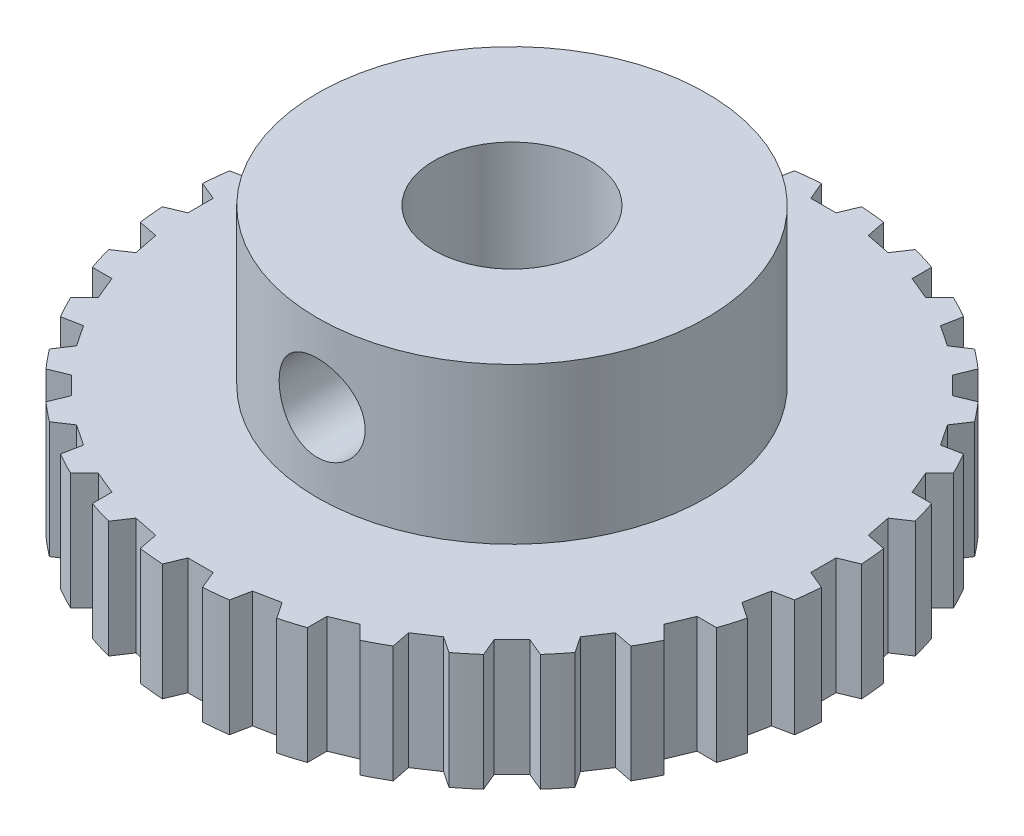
ISO-10303-21;
HEADER;
FILE_DESCRIPTION(('STEP AP214'),'2;1');
FILE_NAME('part.step','',(''),(''),'','','');
FILE_SCHEMA(('AUTOMOTIVE_DESIGN { 1 0 10303 214 1 1 1 1 }'));
ENDSEC;
DATA;
#1=APPLICATION_CONTEXT('core data for automotive mechanical design processes');
#2=APPLICATION_PROTOCOL_DEFINITION('international standard','automotive_design',2000,#1);
#3=PRODUCT_CONTEXT('',#1,'mechanical');
#4=PRODUCT('Part','Part','',(#3));
#5=PRODUCT_RELATED_PRODUCT_CATEGORY('part','',(#4));
#6=PRODUCT_DEFINITION_FORMATION('','',#4);
#7=PRODUCT_DEFINITION_CONTEXT('part definition',#1,'design');
#8=PRODUCT_DEFINITION('design','',#6,#7);
#9=PRODUCT_DEFINITION_SHAPE('','',#8);
#10=(LENGTH_UNIT() NAMED_UNIT(*) SI_UNIT(.MILLI.,.METRE.));
#11=(NAMED_UNIT(*) PLANE_ANGLE_UNIT() SI_UNIT($,.RADIAN.));
#12=(NAMED_UNIT(*) SI_UNIT($,.STERADIAN.) SOLID_ANGLE_UNIT());
#13=UNCERTAINTY_MEASURE_WITH_UNIT(LENGTH_MEASURE(1.E-05),#10,'distance_accuracy_value','');
#14=(GEOMETRIC_REPRESENTATION_CONTEXT(3) GLOBAL_UNCERTAINTY_ASSIGNED_CONTEXT((#13)) GLOBAL_UNIT_ASSIGNED_CONTEXT((#10,
#11,#12)) REPRESENTATION_CONTEXT('',''));
#15=CARTESIAN_POINT('',(0.,0.,0.));
#16=DIRECTION('',(0.,0.,1.));
#17=DIRECTION('',(1.,0.,0.));
#18=AXIS2_PLACEMENT_3D('',#15,#16,#17);
#19=CARTESIAN_POINT('',(0.,4.7625,0.));
#20=DIRECTION('',(0.,-1.,0.));
#21=DIRECTION('',(0.,0.,-1.));
#22=AXIS2_PLACEMENT_3D('',#19,#20,#21);
#23=CYLINDRICAL_SURFACE('',#22,13.462);
#24=CARTESIAN_POINT('',(0.,0.,0.));
#25=DIRECTION('',(0.,1.,0.));
#26=DIRECTION('',(0.,0.,1.));
#27=AXIS2_PLACEMENT_3D('',#24,#25,#26);
#28=CIRCLE('',#27,13.462);
#29=CARTESIAN_POINT('',(-13.4370250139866,0.,0.81963575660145));
#30=VERTEX_POINT('',#29);
#31=CARTESIAN_POINT('',(-13.3387393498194,0.,1.81754685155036));
#32=VERTEX_POINT('',#31);
#33=EDGE_CURVE('E853',#30,#32,#28,.T.);
#34=ORIENTED_EDGE('',*,*,#33,.T.);
#35=DIRECTION('',(0.,-1.,0.));
#36=VECTOR('',#35,1.);
#37=CARTESIAN_POINT('',(-13.3387393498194,4.7625,1.81754685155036));
#38=LINE('',#37,#36);
#39=CARTESIAN_POINT('',(-13.3387393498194,4.7625,1.81754685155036));
#40=VERTEX_POINT('',#39);
#41=EDGE_CURVE('E847',#40,#32,#38,.T.);
#42=ORIENTED_EDGE('',*,*,#41,.F.);
#43=CARTESIAN_POINT('',(0.,4.7625,0.));
#44=DIRECTION('',(0.,1.,0.));
#45=DIRECTION('',(0.,0.,1.));
#46=AXIS2_PLACEMENT_3D('',#43,#44,#45);
#47=CIRCLE('',#46,13.462);
#48=CARTESIAN_POINT('',(-13.4370250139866,4.7625,0.81963575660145));
#49=VERTEX_POINT('',#48);
#50=EDGE_CURVE('E11',#49,#40,#47,.T.);
#51=ORIENTED_EDGE('',*,*,#50,.F.);
#52=DIRECTION('',(0.,-1.,0.));
#53=VECTOR('',#52,1.);
#54=CARTESIAN_POINT('',(-13.4370250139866,4.7625,0.81963575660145));
#55=LINE('',#54,#53);
#56=EDGE_CURVE('E895',#30,#49,#55,.F.);
#57=ORIENTED_EDGE('',*,*,#56,.F.);
#58=EDGE_LOOP('',(#34,#42,#51,#57));
#59=FACE_BOUND('',#58,.T.);
#60=ADVANCED_FACE('F34',(#59),#23,.T.);
#61=CARTESIAN_POINT('',(-13.0189333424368,4.7625,3.42532022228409));
#62=VERTEX_POINT('',#61);
#63=CARTESIAN_POINT('',(-12.7278534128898,4.7625,4.38488215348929));
#64=VERTEX_POINT('',#63);
#65=EDGE_CURVE('E47',#62,#64,#47,.T.);
#66=ORIENTED_EDGE('',*,*,#65,.F.);
#67=DIRECTION('',(0.,-1.,0.));
#68=VECTOR('',#67,1.);
#69=CARTESIAN_POINT('',(-13.0189333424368,4.7625,3.42532022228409));
#70=LINE('',#69,#68);
#71=CARTESIAN_POINT('',(-13.0189333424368,0.,3.4253202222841));
#72=VERTEX_POINT('',#71);
#73=EDGE_CURVE('E831',#72,#62,#70,.F.);
#74=ORIENTED_EDGE('',*,*,#73,.F.);
#75=CARTESIAN_POINT('',(-12.7278534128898,0.,4.38488215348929));
#76=VERTEX_POINT('',#75);
#77=EDGE_CURVE('E846',#72,#76,#28,.T.);
#78=ORIENTED_EDGE('',*,*,#77,.T.);
#79=DIRECTION('',(0.,-1.,0.));
#80=VECTOR('',#79,1.);
#81=CARTESIAN_POINT('',(-12.7278534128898,4.7625,4.38488215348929));
#82=LINE('',#81,#80);
#83=EDGE_CURVE('E1670',#64,#76,#82,.T.);
#84=ORIENTED_EDGE('',*,*,#83,.F.);
#85=EDGE_LOOP('',(#66,#74,#78,#84));
#86=FACE_BOUND('',#85,.T.);
#87=ADVANCED_FACE('F844',(#86),#23,.T.);
#88=CARTESIAN_POINT('',(-12.100531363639,4.7625,5.89937155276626));
#89=VERTEX_POINT('',#88);
#90=CARTESIAN_POINT('',(-11.6278432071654,4.7625,6.78370889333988));
#91=VERTEX_POINT('',#90);
#92=EDGE_CURVE('E2275',#89,#91,#47,.T.);
#93=ORIENTED_EDGE('',*,*,#92,.F.);
#94=DIRECTION('',(0.,-1.,0.));
#95=VECTOR('',#94,1.);
#96=CARTESIAN_POINT('',(-12.100531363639,4.7625,5.89937155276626));
#97=LINE('',#96,#95);
#98=CARTESIAN_POINT('',(-12.100531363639,0.,5.89937155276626));
#99=VERTEX_POINT('',#98);
#100=EDGE_CURVE('E1672',#99,#89,#97,.F.);
#101=ORIENTED_EDGE('',*,*,#100,.F.);
#102=CARTESIAN_POINT('',(-11.6278432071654,0.,6.78370889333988));
#103=VERTEX_POINT('',#102);
#104=EDGE_CURVE('E854',#99,#103,#28,.T.);
#105=ORIENTED_EDGE('',*,*,#104,.T.);
#106=DIRECTION('',(0.,-1.,0.));
#107=VECTOR('',#106,1.);
#108=CARTESIAN_POINT('',(-11.6278432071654,4.7625,6.78370889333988));
#109=LINE('',#108,#107);
#110=EDGE_CURVE('E1646',#91,#103,#109,.T.);
#111=ORIENTED_EDGE('',*,*,#110,.F.);
#112=EDGE_LOOP('',(#93,#101,#105,#111));
#113=FACE_BOUND('',#112,.T.);
#114=ADVANCED_FACE('F2095',(#113),#23,.T.);
#115=CARTESIAN_POINT('',(-10.7171127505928,4.7625,8.14671334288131));
#116=VERTEX_POINT('',#115);
#117=CARTESIAN_POINT('',(-10.0809815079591,4.7625,8.92184150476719));
#118=VERTEX_POINT('',#117);
#119=EDGE_CURVE('E2274',#116,#118,#47,.T.);
#120=ORIENTED_EDGE('',*,*,#119,.F.);
#121=DIRECTION('',(0.,-1.,0.));
#122=VECTOR('',#121,1.);
#123=CARTESIAN_POINT('',(-10.7171127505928,4.7625,8.14671334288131));
#124=LINE('',#123,#122);
#125=CARTESIAN_POINT('',(-10.7171127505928,0.,8.14671334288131));
#126=VERTEX_POINT('',#125);
#127=EDGE_CURVE('E1649',#126,#116,#124,.F.);
#128=ORIENTED_EDGE('',*,*,#127,.F.);
#129=CARTESIAN_POINT('',(-10.0809815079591,0.,8.92184150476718));
#130=VERTEX_POINT('',#129);
#131=EDGE_CURVE('E857',#126,#130,#28,.T.);
#132=ORIENTED_EDGE('',*,*,#131,.T.);
#133=DIRECTION('',(0.,-1.,0.));
#134=VECTOR('',#133,1.);
#135=CARTESIAN_POINT('',(-10.0809815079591,4.7625,8.92184150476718));
#136=LINE('',#135,#134);
#137=EDGE_CURVE('E1620',#118,#130,#136,.T.);
#138=ORIENTED_EDGE('',*,*,#137,.F.);
#139=EDGE_LOOP('',(#120,#128,#132,#138));
#140=FACE_BOUND('',#139,.T.);
#141=ADVANCED_FACE('F2266',(#140),#23,.T.);
#142=CARTESIAN_POINT('',(-8.92184150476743,4.7625,10.0809815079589));
#143=VERTEX_POINT('',#142);
#144=CARTESIAN_POINT('',(-8.14671334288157,4.7625,10.7171127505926));
#145=VERTEX_POINT('',#144);
#146=EDGE_CURVE('E2276',#143,#145,#47,.T.);
#147=ORIENTED_EDGE('',*,*,#146,.F.);
#148=DIRECTION('',(0.,-1.,0.));
#149=VECTOR('',#148,1.);
#150=CARTESIAN_POINT('',(-8.92184150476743,4.7625,10.0809815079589));
#151=LINE('',#150,#149);
#152=CARTESIAN_POINT('',(-8.92184150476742,0.,10.0809815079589));
#153=VERTEX_POINT('',#152);
#154=EDGE_CURVE('E1623',#153,#143,#151,.F.);
#155=ORIENTED_EDGE('',*,*,#154,.F.);
#156=CARTESIAN_POINT('',(-8.14671334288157,0.,10.7171127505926));
#157=VERTEX_POINT('',#156);
#158=EDGE_CURVE('E2252',#153,#157,#28,.T.);
#159=ORIENTED_EDGE('',*,*,#158,.T.);
#160=DIRECTION('',(0.,-1.,0.));
#161=VECTOR('',#160,1.);
#162=CARTESIAN_POINT('',(-8.14671334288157,4.7625,10.7171127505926));
#163=LINE('',#162,#161);
#164=EDGE_CURVE('E1594',#145,#157,#163,.T.);
#165=ORIENTED_EDGE('',*,*,#164,.F.);
#166=EDGE_LOOP('',(#147,#155,#159,#165));
#167=FACE_BOUND('',#166,.T.);
#168=ADVANCED_FACE('F2554',(#167),#23,.T.);
#169=CARTESIAN_POINT('',(-6.78370889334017,4.7625,11.6278432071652));
#170=VERTEX_POINT('',#169);
#171=CARTESIAN_POINT('',(-5.89937155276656,4.7625,12.1005313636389));
#172=VERTEX_POINT('',#171);
#173=EDGE_CURVE('E2277',#170,#172,#47,.T.);
#174=ORIENTED_EDGE('',*,*,#173,.F.);
#175=DIRECTION('',(0.,-1.,0.));
#176=VECTOR('',#175,1.);
#177=CARTESIAN_POINT('',(-6.78370889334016,4.7625,11.6278432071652));
#178=LINE('',#177,#176);
#179=CARTESIAN_POINT('',(-6.78370889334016,0.,11.6278432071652));
#180=VERTEX_POINT('',#179);
#181=EDGE_CURVE('E1597',#180,#170,#178,.F.);
#182=ORIENTED_EDGE('',*,*,#181,.F.);
#183=CARTESIAN_POINT('',(-5.89937155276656,0.,12.1005313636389));
#184=VERTEX_POINT('',#183);
#185=EDGE_CURVE('E2247',#180,#184,#28,.T.);
#186=ORIENTED_EDGE('',*,*,#185,.T.);
#187=DIRECTION('',(0.,-1.,0.));
#188=VECTOR('',#187,1.);
#189=CARTESIAN_POINT('',(-5.89937155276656,4.7625,12.1005313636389));
#190=LINE('',#189,#188);
#191=EDGE_CURVE('E1568',#172,#184,#190,.T.);
#192=ORIENTED_EDGE('',*,*,#191,.F.);
#193=EDGE_LOOP('',(#174,#182,#186,#192));
#194=FACE_BOUND('',#193,.T.);
#195=ADVANCED_FACE('F2550',(#194),#23,.T.);
#196=CARTESIAN_POINT('',(-4.3848821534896,4.7625,12.7278534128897));
#197=VERTEX_POINT('',#196);
#198=CARTESIAN_POINT('',(-3.42532022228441,4.7625,13.0189333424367));
#199=VERTEX_POINT('',#198);
#200=EDGE_CURVE('E2280',#197,#199,#47,.T.);
#201=ORIENTED_EDGE('',*,*,#200,.F.);
#202=DIRECTION('',(0.,-1.,0.));
#203=VECTOR('',#202,1.);
#204=CARTESIAN_POINT('',(-4.3848821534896,4.7625,12.7278534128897));
#205=LINE('',#204,#203);
#206=CARTESIAN_POINT('',(-4.3848821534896,0.,12.7278534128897));
#207=VERTEX_POINT('',#206);
#208=EDGE_CURVE('E1571',#207,#197,#205,.F.);
#209=ORIENTED_EDGE('',*,*,#208,.F.);
#210=CARTESIAN_POINT('',(-3.42532022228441,0.,13.0189333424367));
#211=VERTEX_POINT('',#210);
#212=EDGE_CURVE('E2242',#207,#211,#28,.T.);
#213=ORIENTED_EDGE('',*,*,#212,.T.);
#214=DIRECTION('',(0.,-1.,0.));
#215=VECTOR('',#214,1.);
#216=CARTESIAN_POINT('',(-3.42532022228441,4.7625,13.0189333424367));
#217=LINE('',#216,#215);
#218=EDGE_CURVE('E1542',#199,#211,#217,.T.);
#219=ORIENTED_EDGE('',*,*,#218,.F.);
#220=EDGE_LOOP('',(#201,#209,#213,#219));
#221=FACE_BOUND('',#220,.T.);
#222=ADVANCED_FACE('F2546',(#221),#23,.T.);
#223=CARTESIAN_POINT('',(-1.81754685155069,4.7625,13.3387393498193));
#224=VERTEX_POINT('',#223);
#225=CARTESIAN_POINT('',(-0.819635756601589,4.7625,13.4370250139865));
#226=VERTEX_POINT('',#225);
#227=EDGE_CURVE('E2283',#224,#226,#47,.T.);
#228=ORIENTED_EDGE('',*,*,#227,.F.);
#229=DIRECTION('',(0.,-1.,0.));
#230=VECTOR('',#229,1.);
#231=CARTESIAN_POINT('',(-1.81754685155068,4.7625,13.3387393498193));
#232=LINE('',#231,#230);
#233=CARTESIAN_POINT('',(-1.81754685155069,0.,13.3387393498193));
#234=VERTEX_POINT('',#233);
#235=EDGE_CURVE('E1545',#234,#224,#232,.F.);
#236=ORIENTED_EDGE('',*,*,#235,.F.);
#237=CARTESIAN_POINT('',(-0.81963575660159,0.,13.4370250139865));
#238=VERTEX_POINT('',#237);
#239=EDGE_CURVE('E2237',#234,#238,#28,.T.);
#240=ORIENTED_EDGE('',*,*,#239,.T.);
#241=DIRECTION('',(0.,-1.,0.));
#242=VECTOR('',#241,1.);
#243=CARTESIAN_POINT('',(-0.819635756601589,4.7625,13.4370250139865));
#244=LINE('',#243,#242);
#245=EDGE_CURVE('E1516',#226,#238,#244,.T.);
#246=ORIENTED_EDGE('',*,*,#245,.F.);
#247=EDGE_LOOP('',(#228,#236,#240,#246));
#248=FACE_BOUND('',#247,.T.);
#249=ADVANCED_FACE('F2529',(#248),#23,.T.);
#250=CARTESIAN_POINT('',(0.819635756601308,4.7625,13.4370250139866));
#251=VERTEX_POINT('',#250);
#252=CARTESIAN_POINT('',(1.8175468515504,4.7625,13.3387393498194));
#253=VERTEX_POINT('',#252);
#254=EDGE_CURVE('E2286',#251,#253,#47,.T.);
#255=ORIENTED_EDGE('',*,*,#254,.F.);
#256=DIRECTION('',(0.,-1.,0.));
#257=VECTOR('',#256,1.);
#258=CARTESIAN_POINT('',(0.819635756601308,4.7625,13.4370250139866));
#259=LINE('',#258,#257);
#260=CARTESIAN_POINT('',(0.81963575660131,0.,13.4370250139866));
#261=VERTEX_POINT('',#260);
#262=EDGE_CURVE('E1519',#261,#251,#259,.F.);
#263=ORIENTED_EDGE('',*,*,#262,.F.);
#264=CARTESIAN_POINT('',(1.8175468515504,0.,13.3387393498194));
#265=VERTEX_POINT('',#264);
#266=EDGE_CURVE('E2232',#261,#265,#28,.T.);
#267=ORIENTED_EDGE('',*,*,#266,.T.);
#268=DIRECTION('',(0.,-1.,0.));
#269=VECTOR('',#268,1.);
#270=CARTESIAN_POINT('',(1.8175468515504,4.7625,13.3387393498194));
#271=LINE('',#270,#269);
#272=EDGE_CURVE('E1490',#253,#265,#271,.T.);
#273=ORIENTED_EDGE('',*,*,#272,.F.);
#274=EDGE_LOOP('',(#255,#263,#267,#273));
#275=FACE_BOUND('',#274,.T.);
#276=ADVANCED_FACE('F2525',(#275),#23,.T.);
#277=CARTESIAN_POINT('',(3.42532022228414,4.7625,13.0189333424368));
#278=VERTEX_POINT('',#277);
#279=CARTESIAN_POINT('',(4.38488215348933,4.7625,12.7278534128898));
#280=VERTEX_POINT('',#279);
#281=EDGE_CURVE('E2289',#278,#280,#47,.T.);
#282=ORIENTED_EDGE('',*,*,#281,.F.);
#283=DIRECTION('',(0.,-1.,0.));
#284=VECTOR('',#283,1.);
#285=CARTESIAN_POINT('',(3.42532022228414,4.7625,13.0189333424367));
#286=LINE('',#285,#284);
#287=CARTESIAN_POINT('',(3.42532022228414,0.,13.0189333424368));
#288=VERTEX_POINT('',#287);
#289=EDGE_CURVE('E1493',#288,#278,#286,.F.);
#290=ORIENTED_EDGE('',*,*,#289,.F.);
#291=CARTESIAN_POINT('',(4.38488215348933,0.,12.7278534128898));
#292=VERTEX_POINT('',#291);
#293=EDGE_CURVE('E2227',#288,#292,#28,.T.);
#294=ORIENTED_EDGE('',*,*,#293,.T.);
#295=DIRECTION('',(0.,-1.,0.));
#296=VECTOR('',#295,1.);
#297=CARTESIAN_POINT('',(4.38488215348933,4.7625,12.7278534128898));
#298=LINE('',#297,#296);
#299=EDGE_CURVE('E1464',#280,#292,#298,.T.);
#300=ORIENTED_EDGE('',*,*,#299,.F.);
#301=EDGE_LOOP('',(#282,#290,#294,#300));
#302=FACE_BOUND('',#301,.T.);
#303=ADVANCED_FACE('F2521',(#302),#23,.T.);
#304=CARTESIAN_POINT('',(5.8993715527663,4.7625,12.100531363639));
#305=VERTEX_POINT('',#304);
#306=CARTESIAN_POINT('',(6.78370889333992,4.7625,11.6278432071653));
#307=VERTEX_POINT('',#306);
#308=EDGE_CURVE('E2292',#305,#307,#47,.T.);
#309=ORIENTED_EDGE('',*,*,#308,.F.);
#310=DIRECTION('',(0.,-1.,0.));
#311=VECTOR('',#310,1.);
#312=CARTESIAN_POINT('',(5.8993715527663,4.7625,12.100531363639));
#313=LINE('',#312,#311);
#314=CARTESIAN_POINT('',(5.8993715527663,0.,12.100531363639));
#315=VERTEX_POINT('',#314);
#316=EDGE_CURVE('E1467',#315,#305,#313,.F.);
#317=ORIENTED_EDGE('',*,*,#316,.F.);
#318=CARTESIAN_POINT('',(6.78370889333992,0.,11.6278432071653));
#319=VERTEX_POINT('',#318);
#320=EDGE_CURVE('E2222',#315,#319,#28,.T.);
#321=ORIENTED_EDGE('',*,*,#320,.T.);
#322=DIRECTION('',(0.,-1.,0.));
#323=VECTOR('',#322,1.);
#324=CARTESIAN_POINT('',(6.78370889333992,4.7625,11.6278432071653));
#325=LINE('',#324,#323);
#326=EDGE_CURVE('E1438',#307,#319,#325,.T.);
#327=ORIENTED_EDGE('',*,*,#326,.F.);
#328=EDGE_LOOP('',(#309,#317,#321,#327));
#329=FACE_BOUND('',#328,.T.);
#330=ADVANCED_FACE('F2504',(#329),#23,.T.);
#331=CARTESIAN_POINT('',(8.14671334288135,4.7625,10.7171127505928));
#332=VERTEX_POINT('',#331);
#333=CARTESIAN_POINT('',(8.92184150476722,4.7625,10.0809815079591));
#334=VERTEX_POINT('',#333);
#335=EDGE_CURVE('E2295',#332,#334,#47,.T.);
#336=ORIENTED_EDGE('',*,*,#335,.F.);
#337=DIRECTION('',(0.,-1.,0.));
#338=VECTOR('',#337,1.);
#339=CARTESIAN_POINT('',(8.14671334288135,4.7625,10.7171127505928));
#340=LINE('',#339,#338);
#341=CARTESIAN_POINT('',(8.14671334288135,0.,10.7171127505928));
#342=VERTEX_POINT('',#341);
#343=EDGE_CURVE('E1441',#342,#332,#340,.F.);
#344=ORIENTED_EDGE('',*,*,#343,.F.);
#345=CARTESIAN_POINT('',(8.92184150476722,0.,10.0809815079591));
#346=VERTEX_POINT('',#345);
#347=EDGE_CURVE('E2217',#342,#346,#28,.T.);
#348=ORIENTED_EDGE('',*,*,#347,.T.);
#349=DIRECTION('',(0.,-1.,0.));
#350=VECTOR('',#349,1.);
#351=CARTESIAN_POINT('',(8.92184150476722,4.7625,10.0809815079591));
#352=LINE('',#351,#350);
#353=EDGE_CURVE('E1412',#334,#346,#352,.T.);
#354=ORIENTED_EDGE('',*,*,#353,.F.);
#355=EDGE_LOOP('',(#336,#344,#348,#354));
#356=FACE_BOUND('',#355,.T.);
#357=ADVANCED_FACE('F2500',(#356),#23,.T.);
#358=CARTESIAN_POINT('',(10.0809815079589,4.7625,8.92184150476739));
#359=VERTEX_POINT('',#358);
#360=CARTESIAN_POINT('',(10.7171127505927,4.7625,8.14671334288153));
#361=VERTEX_POINT('',#360);
#362=EDGE_CURVE('E2298',#359,#361,#47,.T.);
#363=ORIENTED_EDGE('',*,*,#362,.F.);
#364=DIRECTION('',(0.,-1.,0.));
#365=VECTOR('',#364,1.);
#366=CARTESIAN_POINT('',(10.0809815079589,4.7625,8.92184150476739));
#367=LINE('',#366,#365);
#368=CARTESIAN_POINT('',(10.0809815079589,0.,8.92184150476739));
#369=VERTEX_POINT('',#368);
#370=EDGE_CURVE('E1415',#369,#359,#367,.F.);
#371=ORIENTED_EDGE('',*,*,#370,.F.);
#372=CARTESIAN_POINT('',(10.7171127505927,0.,8.14671334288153));
#373=VERTEX_POINT('',#372);
#374=EDGE_CURVE('E2212',#369,#373,#28,.T.);
#375=ORIENTED_EDGE('',*,*,#374,.T.);
#376=DIRECTION('',(0.,-1.,0.));
#377=VECTOR('',#376,1.);
#378=CARTESIAN_POINT('',(10.7171127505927,4.7625,8.14671334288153));
#379=LINE('',#378,#377);
#380=EDGE_CURVE('E1386',#361,#373,#379,.T.);
#381=ORIENTED_EDGE('',*,*,#380,.F.);
#382=EDGE_LOOP('',(#363,#371,#375,#381));
#383=FACE_BOUND('',#382,.T.);
#384=ADVANCED_FACE('F2496',(#383),#23,.T.);
#385=CARTESIAN_POINT('',(11.6278432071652,4.7625,6.78370889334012));
#386=VERTEX_POINT('',#385);
#387=CARTESIAN_POINT('',(12.1005313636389,4.7625,5.89937155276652));
#388=VERTEX_POINT('',#387);
#389=EDGE_CURVE('E2301',#386,#388,#47,.T.);
#390=ORIENTED_EDGE('',*,*,#389,.F.);
#391=DIRECTION('',(0.,-1.,0.));
#392=VECTOR('',#391,1.);
#393=CARTESIAN_POINT('',(11.6278432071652,4.7625,6.78370889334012));
#394=LINE('',#393,#392);
#395=CARTESIAN_POINT('',(11.6278432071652,0.,6.78370889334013));
#396=VERTEX_POINT('',#395);
#397=EDGE_CURVE('E1389',#396,#386,#394,.F.);
#398=ORIENTED_EDGE('',*,*,#397,.F.);
#399=CARTESIAN_POINT('',(12.1005313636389,0.,5.89937155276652));
#400=VERTEX_POINT('',#399);
#401=EDGE_CURVE('E2207',#396,#400,#28,.T.);
#402=ORIENTED_EDGE('',*,*,#401,.T.);
#403=DIRECTION('',(0.,-1.,0.));
#404=VECTOR('',#403,1.);
#405=CARTESIAN_POINT('',(12.1005313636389,4.7625,5.89937155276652));
#406=LINE('',#405,#404);
#407=EDGE_CURVE('E1360',#388,#400,#406,.T.);
#408=ORIENTED_EDGE('',*,*,#407,.F.);
#409=EDGE_LOOP('',(#390,#398,#402,#408));
#410=FACE_BOUND('',#409,.T.);
#411=ADVANCED_FACE('F2479',(#410),#23,.T.);
#412=CARTESIAN_POINT('',(12.7278534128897,4.7625,4.38488215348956));
#413=VERTEX_POINT('',#412);
#414=CARTESIAN_POINT('',(13.0189333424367,4.7625,3.42532022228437));
#415=VERTEX_POINT('',#414);
#416=EDGE_CURVE('E2304',#413,#415,#47,.T.);
#417=ORIENTED_EDGE('',*,*,#416,.F.);
#418=DIRECTION('',(0.,-1.,0.));
#419=VECTOR('',#418,1.);
#420=CARTESIAN_POINT('',(12.7278534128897,4.7625,4.38488215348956));
#421=LINE('',#420,#419);
#422=CARTESIAN_POINT('',(12.7278534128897,0.,4.38488215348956));
#423=VERTEX_POINT('',#422);
#424=EDGE_CURVE('E1363',#423,#413,#421,.F.);
#425=ORIENTED_EDGE('',*,*,#424,.F.);
#426=CARTESIAN_POINT('',(13.0189333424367,0.,3.42532022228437));
#427=VERTEX_POINT('',#426);
#428=EDGE_CURVE('E2202',#423,#427,#28,.T.);
#429=ORIENTED_EDGE('',*,*,#428,.T.);
#430=DIRECTION('',(0.,-1.,0.));
#431=VECTOR('',#430,1.);
#432=CARTESIAN_POINT('',(13.0189333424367,4.7625,3.42532022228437));
#433=LINE('',#432,#431);
#434=EDGE_CURVE('E1334',#415,#427,#433,.T.);
#435=ORIENTED_EDGE('',*,*,#434,.F.);
#436=EDGE_LOOP('',(#417,#425,#429,#435));
#437=FACE_BOUND('',#436,.T.);
#438=ADVANCED_FACE('F2475',(#437),#23,.T.);
#439=CARTESIAN_POINT('',(13.3387393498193,4.7625,1.81754685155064));
#440=VERTEX_POINT('',#439);
#441=CARTESIAN_POINT('',(13.4370250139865,4.7625,0.819635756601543));
#442=VERTEX_POINT('',#441);
#443=EDGE_CURVE('E2307',#440,#442,#47,.T.);
#444=ORIENTED_EDGE('',*,*,#443,.F.);
#445=DIRECTION('',(0.,-1.,0.));
#446=VECTOR('',#445,1.);
#447=CARTESIAN_POINT('',(13.3387393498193,4.7625,1.81754685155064));
#448=LINE('',#447,#446);
#449=CARTESIAN_POINT('',(13.3387393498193,0.,1.81754685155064));
#450=VERTEX_POINT('',#449);
#451=EDGE_CURVE('E1337',#450,#440,#448,.F.);
#452=ORIENTED_EDGE('',*,*,#451,.F.);
#453=CARTESIAN_POINT('',(13.4370250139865,0.,0.819635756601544));
#454=VERTEX_POINT('',#453);
#455=EDGE_CURVE('E2197',#450,#454,#28,.T.);
#456=ORIENTED_EDGE('',*,*,#455,.T.);
#457=DIRECTION('',(0.,-1.,0.));
#458=VECTOR('',#457,1.);
#459=CARTESIAN_POINT('',(13.4370250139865,4.7625,0.819635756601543));
#460=LINE('',#459,#458);
#461=EDGE_CURVE('E1308',#442,#454,#460,.T.);
#462=ORIENTED_EDGE('',*,*,#461,.F.);
#463=EDGE_LOOP('',(#444,#452,#456,#462));
#464=FACE_BOUND('',#463,.T.);
#465=ADVANCED_FACE('F2471',(#464),#23,.T.);
#466=CARTESIAN_POINT('',(13.4370250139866,4.7625,-0.819635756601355));
#467=VERTEX_POINT('',#466);
#468=CARTESIAN_POINT('',(13.3387393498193,4.7625,-1.81754685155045));
#469=VERTEX_POINT('',#468);
#470=EDGE_CURVE('E2310',#467,#469,#47,.T.);
#471=ORIENTED_EDGE('',*,*,#470,.F.);
#472=DIRECTION('',(0.,-1.,0.));
#473=VECTOR('',#472,1.);
#474=CARTESIAN_POINT('',(13.4370250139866,4.7625,-0.819635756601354));
#475=LINE('',#474,#473);
#476=CARTESIAN_POINT('',(13.4370250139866,0.,-0.819635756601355));
#477=VERTEX_POINT('',#476);
#478=EDGE_CURVE('E1311',#477,#467,#475,.F.);
#479=ORIENTED_EDGE('',*,*,#478,.F.);
#480=CARTESIAN_POINT('',(13.3387393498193,0.,-1.81754685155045));
#481=VERTEX_POINT('',#480);
#482=EDGE_CURVE('E2192',#477,#481,#28,.T.);
#483=ORIENTED_EDGE('',*,*,#482,.T.);
#484=DIRECTION('',(0.,-1.,0.));
#485=VECTOR('',#484,1.);
#486=CARTESIAN_POINT('',(13.3387393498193,4.7625,-1.81754685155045));
#487=LINE('',#486,#485);
#488=EDGE_CURVE('E1282',#469,#481,#487,.T.);
#489=ORIENTED_EDGE('',*,*,#488,.F.);
#490=EDGE_LOOP('',(#471,#479,#483,#489));
#491=FACE_BOUND('',#490,.T.);
#492=ADVANCED_FACE('F2454',(#491),#23,.T.);
#493=CARTESIAN_POINT('',(13.0189333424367,4.7625,-3.42532022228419));
#494=VERTEX_POINT('',#493);
#495=CARTESIAN_POINT('',(12.7278534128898,4.7625,-4.38488215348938));
#496=VERTEX_POINT('',#495);
#497=EDGE_CURVE('E2313',#494,#496,#47,.T.);
#498=ORIENTED_EDGE('',*,*,#497,.F.);
#499=DIRECTION('',(0.,-1.,0.));
#500=VECTOR('',#499,1.);
#501=CARTESIAN_POINT('',(13.0189333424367,4.7625,-3.42532022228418));
#502=LINE('',#501,#500);
#503=CARTESIAN_POINT('',(13.0189333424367,0.,-3.42532022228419));
#504=VERTEX_POINT('',#503);
#505=EDGE_CURVE('E1285',#504,#494,#502,.F.);
#506=ORIENTED_EDGE('',*,*,#505,.F.);
#507=CARTESIAN_POINT('',(12.7278534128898,0.,-4.38488215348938));
#508=VERTEX_POINT('',#507);
#509=EDGE_CURVE('E2187',#504,#508,#28,.T.);
#510=ORIENTED_EDGE('',*,*,#509,.T.);
#511=DIRECTION('',(0.,-1.,0.));
#512=VECTOR('',#511,1.);
#513=CARTESIAN_POINT('',(12.7278534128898,4.7625,-4.38488215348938));
#514=LINE('',#513,#512);
#515=EDGE_CURVE('E1256',#496,#508,#514,.T.);
#516=ORIENTED_EDGE('',*,*,#515,.F.);
#517=EDGE_LOOP('',(#498,#506,#510,#516));
#518=FACE_BOUND('',#517,.T.);
#519=ADVANCED_FACE('F2450',(#518),#23,.T.);
#520=CARTESIAN_POINT('',(12.100531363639,4.7625,-5.89937155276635));
#521=VERTEX_POINT('',#520);
#522=CARTESIAN_POINT('',(11.6278432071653,4.7625,-6.78370889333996));
#523=VERTEX_POINT('',#522);
#524=EDGE_CURVE('E2316',#521,#523,#47,.T.);
#525=ORIENTED_EDGE('',*,*,#524,.F.);
#526=DIRECTION('',(0.,-1.,0.));
#527=VECTOR('',#526,1.);
#528=CARTESIAN_POINT('',(12.100531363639,4.7625,-5.89937155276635));
#529=LINE('',#528,#527);
#530=CARTESIAN_POINT('',(12.100531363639,0.,-5.89937155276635));
#531=VERTEX_POINT('',#530);
#532=EDGE_CURVE('E1259',#531,#521,#529,.F.);
#533=ORIENTED_EDGE('',*,*,#532,.F.);
#534=CARTESIAN_POINT('',(11.6278432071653,0.,-6.78370889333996));
#535=VERTEX_POINT('',#534);
#536=EDGE_CURVE('E2182',#531,#535,#28,.T.);
#537=ORIENTED_EDGE('',*,*,#536,.T.);
#538=DIRECTION('',(0.,-1.,0.));
#539=VECTOR('',#538,1.);
#540=CARTESIAN_POINT('',(11.6278432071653,4.7625,-6.78370889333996));
#541=LINE('',#540,#539);
#542=EDGE_CURVE('E1230',#523,#535,#541,.T.);
#543=ORIENTED_EDGE('',*,*,#542,.F.);
#544=EDGE_LOOP('',(#525,#533,#537,#543));
#545=FACE_BOUND('',#544,.T.);
#546=ADVANCED_FACE('F2446',(#545),#23,.T.);
#547=CARTESIAN_POINT('',(10.7171127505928,4.7625,-8.14671334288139));
#548=VERTEX_POINT('',#547);
#549=CARTESIAN_POINT('',(10.0809815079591,4.7625,-8.92184150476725));
#550=VERTEX_POINT('',#549);
#551=EDGE_CURVE('E2319',#548,#550,#47,.T.);
#552=ORIENTED_EDGE('',*,*,#551,.F.);
#553=DIRECTION('',(0.,-1.,0.));
#554=VECTOR('',#553,1.);
#555=CARTESIAN_POINT('',(10.7171127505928,4.7625,-8.14671334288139));
#556=LINE('',#555,#554);
#557=CARTESIAN_POINT('',(10.7171127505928,0.,-8.14671334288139));
#558=VERTEX_POINT('',#557);
#559=EDGE_CURVE('E1233',#558,#548,#556,.F.);
#560=ORIENTED_EDGE('',*,*,#559,.F.);
#561=CARTESIAN_POINT('',(10.0809815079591,0.,-8.92184150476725));
#562=VERTEX_POINT('',#561);
#563=EDGE_CURVE('E2177',#558,#562,#28,.T.);
#564=ORIENTED_EDGE('',*,*,#563,.T.);
#565=DIRECTION('',(0.,-1.,0.));
#566=VECTOR('',#565,1.);
#567=CARTESIAN_POINT('',(10.0809815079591,4.7625,-8.92184150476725));
#568=LINE('',#567,#566);
#569=EDGE_CURVE('E1204',#550,#562,#568,.T.);
#570=ORIENTED_EDGE('',*,*,#569,.F.);
#571=EDGE_LOOP('',(#552,#560,#564,#570));
#572=FACE_BOUND('',#571,.T.);
#573=ADVANCED_FACE('F2429',(#572),#23,.T.);
#574=CARTESIAN_POINT('',(8.92184150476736,4.7625,-10.080981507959));
#575=VERTEX_POINT('',#574);
#576=CARTESIAN_POINT('',(8.1467133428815,4.7625,-10.7171127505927));
#577=VERTEX_POINT('',#576);
#578=EDGE_CURVE('E2322',#575,#577,#47,.T.);
#579=ORIENTED_EDGE('',*,*,#578,.F.);
#580=DIRECTION('',(0.,-1.,0.));
#581=VECTOR('',#580,1.);
#582=CARTESIAN_POINT('',(8.92184150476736,4.7625,-10.080981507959));
#583=LINE('',#582,#581);
#584=CARTESIAN_POINT('',(8.92184150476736,0.,-10.080981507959));
#585=VERTEX_POINT('',#584);
#586=EDGE_CURVE('E1207',#585,#575,#583,.F.);
#587=ORIENTED_EDGE('',*,*,#586,.F.);
#588=CARTESIAN_POINT('',(8.1467133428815,0.,-10.7171127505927));
#589=VERTEX_POINT('',#588);
#590=EDGE_CURVE('E2172',#585,#589,#28,.T.);
#591=ORIENTED_EDGE('',*,*,#590,.T.);
#592=DIRECTION('',(0.,-1.,0.));
#593=VECTOR('',#592,1.);
#594=CARTESIAN_POINT('',(8.1467133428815,4.7625,-10.7171127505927));
#595=LINE('',#594,#593);
#596=EDGE_CURVE('E1178',#577,#589,#595,.T.);
#597=ORIENTED_EDGE('',*,*,#596,.F.);
#598=EDGE_LOOP('',(#579,#587,#591,#597));
#599=FACE_BOUND('',#598,.T.);
#600=ADVANCED_FACE('F2425',(#599),#23,.T.);
#601=CARTESIAN_POINT('',(6.78370889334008,4.7625,-11.6278432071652));
#602=VERTEX_POINT('',#601);
#603=CARTESIAN_POINT('',(5.89937155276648,4.7625,-12.1005313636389));
#604=VERTEX_POINT('',#603);
#605=EDGE_CURVE('E2325',#602,#604,#47,.T.);
#606=ORIENTED_EDGE('',*,*,#605,.F.);
#607=DIRECTION('',(0.,-1.,0.));
#608=VECTOR('',#607,1.);
#609=CARTESIAN_POINT('',(6.78370889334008,4.7625,-11.6278432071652));
#610=LINE('',#609,#608);
#611=CARTESIAN_POINT('',(6.78370889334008,0.,-11.6278432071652));
#612=VERTEX_POINT('',#611);
#613=EDGE_CURVE('E1181',#612,#602,#610,.F.);
#614=ORIENTED_EDGE('',*,*,#613,.F.);
#615=CARTESIAN_POINT('',(5.89937155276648,0.,-12.1005313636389));
#616=VERTEX_POINT('',#615);
#617=EDGE_CURVE('E2167',#612,#616,#28,.T.);
#618=ORIENTED_EDGE('',*,*,#617,.T.);
#619=DIRECTION('',(0.,-1.,0.));
#620=VECTOR('',#619,1.);
#621=CARTESIAN_POINT('',(5.89937155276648,4.7625,-12.1005313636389));
#622=LINE('',#621,#620);
#623=EDGE_CURVE('E1152',#604,#616,#622,.T.);
#624=ORIENTED_EDGE('',*,*,#623,.F.);
#625=EDGE_LOOP('',(#606,#614,#618,#624));
#626=FACE_BOUND('',#625,.T.);
#627=ADVANCED_FACE('F2421',(#626),#23,.T.);
#628=CARTESIAN_POINT('',(4.38488215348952,4.7625,-12.7278534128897));
#629=VERTEX_POINT('',#628);
#630=CARTESIAN_POINT('',(3.42532022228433,4.7625,-13.0189333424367));
#631=VERTEX_POINT('',#630);
#632=EDGE_CURVE('E2328',#629,#631,#47,.T.);
#633=ORIENTED_EDGE('',*,*,#632,.F.);
#634=DIRECTION('',(0.,-1.,0.));
#635=VECTOR('',#634,1.);
#636=CARTESIAN_POINT('',(4.38488215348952,4.7625,-12.7278534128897));
#637=LINE('',#636,#635);
#638=CARTESIAN_POINT('',(4.38488215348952,0.,-12.7278534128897));
#639=VERTEX_POINT('',#638);
#640=EDGE_CURVE('E1155',#639,#629,#637,.F.);
#641=ORIENTED_EDGE('',*,*,#640,.F.);
#642=CARTESIAN_POINT('',(3.42532022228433,0.,-13.0189333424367));
#643=VERTEX_POINT('',#642);
#644=EDGE_CURVE('E2162',#639,#643,#28,.T.);
#645=ORIENTED_EDGE('',*,*,#644,.T.);
#646=DIRECTION('',(0.,-1.,0.));
#647=VECTOR('',#646,1.);
#648=CARTESIAN_POINT('',(3.42532022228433,4.7625,-13.0189333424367));
#649=LINE('',#648,#647);
#650=EDGE_CURVE('E1126',#631,#643,#649,.T.);
#651=ORIENTED_EDGE('',*,*,#650,.F.);
#652=EDGE_LOOP('',(#633,#641,#645,#651));
#653=FACE_BOUND('',#652,.T.);
#654=ADVANCED_FACE('F2404',(#653),#23,.T.);
#655=CARTESIAN_POINT('',(1.81754685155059,4.7625,-13.3387393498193));
#656=VERTEX_POINT('',#655);
#657=CARTESIAN_POINT('',(0.819635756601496,4.7625,-13.4370250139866));
#658=VERTEX_POINT('',#657);
#659=EDGE_CURVE('E2331',#656,#658,#47,.T.);
#660=ORIENTED_EDGE('',*,*,#659,.F.);
#661=DIRECTION('',(0.,-1.,0.));
#662=VECTOR('',#661,1.);
#663=CARTESIAN_POINT('',(1.81754685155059,4.7625,-13.3387393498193));
#664=LINE('',#663,#662);
#665=CARTESIAN_POINT('',(1.81754685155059,0.,-13.3387393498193));
#666=VERTEX_POINT('',#665);
#667=EDGE_CURVE('E1129',#666,#656,#664,.F.);
#668=ORIENTED_EDGE('',*,*,#667,.F.);
#669=CARTESIAN_POINT('',(0.819635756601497,0.,-13.4370250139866));
#670=VERTEX_POINT('',#669);
#671=EDGE_CURVE('E2157',#666,#670,#28,.T.);
#672=ORIENTED_EDGE('',*,*,#671,.T.);
#673=DIRECTION('',(0.,-1.,0.));
#674=VECTOR('',#673,1.);
#675=CARTESIAN_POINT('',(0.819635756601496,4.7625,-13.4370250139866));
#676=LINE('',#675,#674);
#677=EDGE_CURVE('E1100',#658,#670,#676,.T.);
#678=ORIENTED_EDGE('',*,*,#677,.F.);
#679=EDGE_LOOP('',(#660,#668,#672,#678));
#680=FACE_BOUND('',#679,.T.);
#681=ADVANCED_FACE('F2400',(#680),#23,.T.);
#682=CARTESIAN_POINT('',(-0.819635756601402,4.7625,-13.4370250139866));
#683=VERTEX_POINT('',#682);
#684=CARTESIAN_POINT('',(-1.8175468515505,4.7625,-13.3387393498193));
#685=VERTEX_POINT('',#684);
#686=EDGE_CURVE('E2334',#683,#685,#47,.T.);
#687=ORIENTED_EDGE('',*,*,#686,.F.);
#688=DIRECTION('',(0.,-1.,0.));
#689=VECTOR('',#688,1.);
#690=CARTESIAN_POINT('',(-0.819635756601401,4.7625,-13.4370250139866));
#691=LINE('',#690,#689);
#692=CARTESIAN_POINT('',(-0.819635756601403,0.,-13.4370250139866));
#693=VERTEX_POINT('',#692);
#694=EDGE_CURVE('E1103',#693,#683,#691,.F.);
#695=ORIENTED_EDGE('',*,*,#694,.F.);
#696=CARTESIAN_POINT('',(-1.8175468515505,0.,-13.3387393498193));
#697=VERTEX_POINT('',#696);
#698=EDGE_CURVE('E2152',#693,#697,#28,.T.);
#699=ORIENTED_EDGE('',*,*,#698,.T.);
#700=DIRECTION('',(0.,-1.,0.));
#701=VECTOR('',#700,1.);
#702=CARTESIAN_POINT('',(-1.8175468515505,4.7625,-13.3387393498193));
#703=LINE('',#702,#701);
#704=EDGE_CURVE('E1074',#685,#697,#703,.T.);
#705=ORIENTED_EDGE('',*,*,#704,.F.);
#706=EDGE_LOOP('',(#687,#695,#699,#705));
#707=FACE_BOUND('',#706,.T.);
#708=ADVANCED_FACE('F2396',(#707),#23,.T.);
#709=CARTESIAN_POINT('',(-3.42532022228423,4.7625,-13.0189333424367));
#710=VERTEX_POINT('',#709);
#711=CARTESIAN_POINT('',(-4.38488215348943,4.7625,-12.7278534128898));
#712=VERTEX_POINT('',#711);
#713=EDGE_CURVE('E2337',#710,#712,#47,.T.);
#714=ORIENTED_EDGE('',*,*,#713,.F.);
#715=DIRECTION('',(0.,-1.,0.));
#716=VECTOR('',#715,1.);
#717=CARTESIAN_POINT('',(-3.42532022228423,4.7625,-13.0189333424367));
#718=LINE('',#717,#716);
#719=CARTESIAN_POINT('',(-3.42532022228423,0.,-13.0189333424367));
#720=VERTEX_POINT('',#719);
#721=EDGE_CURVE('E1077',#720,#710,#718,.F.);
#722=ORIENTED_EDGE('',*,*,#721,.F.);
#723=CARTESIAN_POINT('',(-4.38488215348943,0.,-12.7278534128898));
#724=VERTEX_POINT('',#723);
#725=EDGE_CURVE('E2147',#720,#724,#28,.T.);
#726=ORIENTED_EDGE('',*,*,#725,.T.);
#727=DIRECTION('',(0.,-1.,0.));
#728=VECTOR('',#727,1.);
#729=CARTESIAN_POINT('',(-4.38488215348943,4.7625,-12.7278534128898));
#730=LINE('',#729,#728);
#731=EDGE_CURVE('E1048',#712,#724,#730,.T.);
#732=ORIENTED_EDGE('',*,*,#731,.F.);
#733=EDGE_LOOP('',(#714,#722,#726,#732));
#734=FACE_BOUND('',#733,.T.);
#735=ADVANCED_FACE('F2361',(#734),#23,.T.);
#736=CARTESIAN_POINT('',(-5.89937155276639,4.7625,-12.100531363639));
#737=VERTEX_POINT('',#736);
#738=CARTESIAN_POINT('',(-6.78370889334,4.7625,-11.6278432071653));
#739=VERTEX_POINT('',#738);
#740=EDGE_CURVE('E2340',#737,#739,#47,.T.);
#741=ORIENTED_EDGE('',*,*,#740,.F.);
#742=DIRECTION('',(0.,-1.,0.));
#743=VECTOR('',#742,1.);
#744=CARTESIAN_POINT('',(-5.89937155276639,4.7625,-12.100531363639));
#745=LINE('',#744,#743);
#746=CARTESIAN_POINT('',(-5.89937155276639,0.,-12.100531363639));
#747=VERTEX_POINT('',#746);
#748=EDGE_CURVE('E1051',#747,#737,#745,.F.);
#749=ORIENTED_EDGE('',*,*,#748,.F.);
#750=CARTESIAN_POINT('',(-6.78370889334,0.,-11.6278432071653));
#751=VERTEX_POINT('',#750);
#752=EDGE_CURVE('E2142',#747,#751,#28,.T.);
#753=ORIENTED_EDGE('',*,*,#752,.T.);
#754=DIRECTION('',(0.,-1.,0.));
#755=VECTOR('',#754,1.);
#756=CARTESIAN_POINT('',(-6.78370889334,4.7625,-11.6278432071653));
#757=LINE('',#756,#755);
#758=EDGE_CURVE('E1022',#739,#751,#757,.T.);
#759=ORIENTED_EDGE('',*,*,#758,.F.);
#760=EDGE_LOOP('',(#741,#749,#753,#759));
#761=FACE_BOUND('',#760,.T.);
#762=ADVANCED_FACE('F2357',(#761),#23,.T.);
#763=CARTESIAN_POINT('',(-8.14671334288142,4.7625,-10.7171127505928));
#764=VERTEX_POINT('',#763);
#765=CARTESIAN_POINT('',(-8.92184150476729,4.7625,-10.080981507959));
#766=VERTEX_POINT('',#765);
#767=EDGE_CURVE('E2343',#764,#766,#47,.T.);
#768=ORIENTED_EDGE('',*,*,#767,.F.);
#769=DIRECTION('',(0.,-1.,0.));
#770=VECTOR('',#769,1.);
#771=CARTESIAN_POINT('',(-8.14671334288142,4.7625,-10.7171127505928));
#772=LINE('',#771,#770);
#773=CARTESIAN_POINT('',(-8.14671334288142,0.,-10.7171127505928));
#774=VERTEX_POINT('',#773);
#775=EDGE_CURVE('E1025',#774,#764,#772,.F.);
#776=ORIENTED_EDGE('',*,*,#775,.F.);
#777=CARTESIAN_POINT('',(-8.92184150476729,0.,-10.080981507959));
#778=VERTEX_POINT('',#777);
#779=EDGE_CURVE('E2137',#774,#778,#28,.T.);
#780=ORIENTED_EDGE('',*,*,#779,.T.);
#781=DIRECTION('',(0.,-1.,0.));
#782=VECTOR('',#781,1.);
#783=CARTESIAN_POINT('',(-8.92184150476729,4.7625,-10.080981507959));
#784=LINE('',#783,#782);
#785=EDGE_CURVE('E996',#766,#778,#784,.T.);
#786=ORIENTED_EDGE('',*,*,#785,.F.);
#787=EDGE_LOOP('',(#768,#776,#780,#786));
#788=FACE_BOUND('',#787,.T.);
#789=ADVANCED_FACE('F2353',(#788),#23,.T.);
#790=CARTESIAN_POINT('',(-10.080981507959,4.7625,-8.92184150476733));
#791=VERTEX_POINT('',#790);
#792=CARTESIAN_POINT('',(-10.7171127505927,4.7625,-8.14671334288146));
#793=VERTEX_POINT('',#792);
#794=EDGE_CURVE('E2122',#791,#793,#47,.T.);
#795=ORIENTED_EDGE('',*,*,#794,.F.);
#796=DIRECTION('',(0.,-1.,0.));
#797=VECTOR('',#796,1.);
#798=CARTESIAN_POINT('',(-10.080981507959,4.7625,-8.92184150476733));
#799=LINE('',#798,#797);
#800=CARTESIAN_POINT('',(-10.080981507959,0.,-8.92184150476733));
#801=VERTEX_POINT('',#800);
#802=EDGE_CURVE('E999',#801,#791,#799,.F.);
#803=ORIENTED_EDGE('',*,*,#802,.F.);
#804=CARTESIAN_POINT('',(-10.7171127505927,0.,-8.14671334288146));
#805=VERTEX_POINT('',#804);
#806=EDGE_CURVE('E2133',#801,#805,#28,.T.);
#807=ORIENTED_EDGE('',*,*,#806,.T.);
#808=DIRECTION('',(0.,-1.,0.));
#809=VECTOR('',#808,1.);
#810=CARTESIAN_POINT('',(-10.7171127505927,4.7625,-8.14671334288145));
#811=LINE('',#810,#809);
#812=EDGE_CURVE('E970',#793,#805,#811,.T.);
#813=ORIENTED_EDGE('',*,*,#812,.F.);
#814=EDGE_LOOP('',(#795,#803,#807,#813));
#815=FACE_BOUND('',#814,.T.);
#816=ADVANCED_FACE('F2113',(#815),#23,.T.);
#817=CARTESIAN_POINT('',(-11.6278432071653,4.7625,-6.78370889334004));
#818=VERTEX_POINT('',#817);
#819=CARTESIAN_POINT('',(-12.100531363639,4.7625,-5.89937155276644));
#820=VERTEX_POINT('',#819);
#821=EDGE_CURVE('E2121',#818,#820,#47,.T.);
#822=ORIENTED_EDGE('',*,*,#821,.F.);
#823=DIRECTION('',(0.,-1.,0.));
#824=VECTOR('',#823,1.);
#825=CARTESIAN_POINT('',(-11.6278432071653,4.7625,-6.78370889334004));
#826=LINE('',#825,#824);
#827=CARTESIAN_POINT('',(-11.6278432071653,0.,-6.78370889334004));
#828=VERTEX_POINT('',#827);
#829=EDGE_CURVE('E973',#828,#818,#826,.F.);
#830=ORIENTED_EDGE('',*,*,#829,.F.);
#831=CARTESIAN_POINT('',(-12.100531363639,0.,-5.89937155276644));
#832=VERTEX_POINT('',#831);
#833=EDGE_CURVE('E2132',#828,#832,#28,.T.);
#834=ORIENTED_EDGE('',*,*,#833,.T.);
#835=DIRECTION('',(0.,-1.,0.));
#836=VECTOR('',#835,1.);
#837=CARTESIAN_POINT('',(-12.100531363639,4.7625,-5.89937155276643));
#838=LINE('',#837,#836);
#839=EDGE_CURVE('E944',#820,#832,#838,.T.);
#840=ORIENTED_EDGE('',*,*,#839,.F.);
#841=EDGE_LOOP('',(#822,#830,#834,#840));
#842=FACE_BOUND('',#841,.T.);
#843=ADVANCED_FACE('F2105',(#842),#23,.T.);
#844=CARTESIAN_POINT('',(-12.7278534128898,4.7625,-4.38488215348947));
#845=VERTEX_POINT('',#844);
#846=CARTESIAN_POINT('',(-13.0189333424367,4.7625,-3.42532022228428));
#847=VERTEX_POINT('',#846);
#848=EDGE_CURVE('E2118',#845,#847,#47,.T.);
#849=ORIENTED_EDGE('',*,*,#848,.F.);
#850=DIRECTION('',(0.,-1.,0.));
#851=VECTOR('',#850,1.);
#852=CARTESIAN_POINT('',(-12.7278534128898,4.7625,-4.38488215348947));
#853=LINE('',#852,#851);
#854=CARTESIAN_POINT('',(-12.7278534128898,0.,-4.38488215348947));
#855=VERTEX_POINT('',#854);
#856=EDGE_CURVE('E947',#855,#845,#853,.F.);
#857=ORIENTED_EDGE('',*,*,#856,.F.);
#858=CARTESIAN_POINT('',(-13.0189333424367,0.,-3.42532022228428));
#859=VERTEX_POINT('',#858);
#860=EDGE_CURVE('E2131',#855,#859,#28,.T.);
#861=ORIENTED_EDGE('',*,*,#860,.T.);
#862=DIRECTION('',(0.,-1.,0.));
#863=VECTOR('',#862,1.);
#864=CARTESIAN_POINT('',(-13.0189333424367,4.7625,-3.42532022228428));
#865=LINE('',#864,#863);
#866=EDGE_CURVE('E918',#847,#859,#865,.T.);
#867=ORIENTED_EDGE('',*,*,#866,.F.);
#868=EDGE_LOOP('',(#849,#857,#861,#867));
#869=FACE_BOUND('',#868,.T.);
#870=ADVANCED_FACE('F2098',(#869),#23,.T.);
#871=CARTESIAN_POINT('',(0.,4.7625,0.));
#872=DIRECTION('',(0.,1.,0.));
#873=DIRECTION('',(0.,0.,1.));
#874=AXIS2_PLACEMENT_3D('',#871,#872,#873);
#875=PLANE('',#874);
#876=DIRECTION('',(0.980785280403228,0.,0.195090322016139));
#877=VECTOR('',#876,1.);
#878=CARTESIAN_POINT('',(-12.55631776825,4.7625,1.97318018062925));
#879=LINE('',#878,#877);
#880=CARTESIAN_POINT('',(-12.5563177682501,4.7625,1.97318018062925));
#881=VERTEX_POINT('',#880);
#882=EDGE_CURVE('E1681',#40,#881,#879,.T.);
#883=ORIENTED_EDGE('',*,*,#882,.T.);
#884=DIRECTION('',(0.195090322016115,0.,0.980785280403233));
#885=VECTOR('',#884,1.);
#886=CARTESIAN_POINT('',(-12.3556283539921,4.7625,2.98211399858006));
#887=LINE('',#886,#885);
#888=CARTESIAN_POINT('',(-12.3556283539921,4.7625,2.98211399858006));
#889=VERTEX_POINT('',#888);
#890=EDGE_CURVE('E1674',#881,#889,#887,.T.);
#891=ORIENTED_EDGE('',*,*,#890,.T.);
#892=DIRECTION('',(-0.831469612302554,0.,0.555570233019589));
#893=VECTOR('',#892,1.);
#894=CARTESIAN_POINT('',(-13.2127116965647,4.7625,3.55479877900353));
#895=LINE('',#894,#893);
#896=EDGE_CURVE('E1684',#889,#62,#895,.T.);
#897=ORIENTED_EDGE('',*,*,#896,.T.);
#898=ORIENTED_EDGE('',*,*,#65,.T.);
#899=DIRECTION('',(1.,0.,0.));
#900=VECTOR('',#899,1.);
#901=CARTESIAN_POINT('',(-11.9301032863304,4.7625,4.3848821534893));
#902=LINE('',#901,#900);
#903=CARTESIAN_POINT('',(-11.9301032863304,4.7625,4.3848821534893));
#904=VERTEX_POINT('',#903);
#905=EDGE_CURVE('E1664',#64,#904,#902,.T.);
#906=ORIENTED_EDGE('',*,*,#905,.T.);
#907=DIRECTION('',(0.382683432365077,0.,0.923879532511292));
#908=VECTOR('',#907,1.);
#909=CARTESIAN_POINT('',(-11.5364368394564,4.7625,5.33527702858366));
#910=LINE('',#909,#908);
#911=CARTESIAN_POINT('',(-11.5364368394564,4.7625,5.33527702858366));
#912=VERTEX_POINT('',#911);
#913=EDGE_CURVE('E1651',#904,#912,#910,.T.);
#914=ORIENTED_EDGE('',*,*,#913,.T.);
#915=DIRECTION('',(-0.707106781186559,0.,0.707106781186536));
#916=VECTOR('',#915,1.);
#917=CARTESIAN_POINT('',(-12.2653263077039,4.7625,6.06416649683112));
#918=LINE('',#917,#916);
#919=EDGE_CURVE('E1667',#912,#89,#918,.T.);
#920=ORIENTED_EDGE('',*,*,#919,.T.);
#921=ORIENTED_EDGE('',*,*,#92,.T.);
#922=DIRECTION('',(0.980785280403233,0.,-0.195090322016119));
#923=VECTOR('',#922,1.);
#924=CARTESIAN_POINT('',(-10.845421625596,4.7625,6.628075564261));
#925=LINE('',#924,#923);
#926=CARTESIAN_POINT('',(-10.845421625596,4.7625,6.628075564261));
#927=VERTEX_POINT('',#926);
#928=EDGE_CURVE('E1640',#91,#927,#925,.T.);
#929=ORIENTED_EDGE('',*,*,#928,.T.);
#930=DIRECTION('',(0.555570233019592,0.,0.831469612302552));
#931=VECTOR('',#930,1.);
#932=CARTESIAN_POINT('',(-10.2739065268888,4.7625,7.48340835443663));
#933=LINE('',#932,#931);
#934=CARTESIAN_POINT('',(-10.2739065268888,4.7625,7.48340835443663));
#935=VERTEX_POINT('',#934);
#936=EDGE_CURVE('E1625',#927,#935,#933,.T.);
#937=ORIENTED_EDGE('',*,*,#936,.T.);
#938=DIRECTION('',(-0.555570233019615,0.,0.831469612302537));
#939=VECTOR('',#938,1.);
#940=CARTESIAN_POINT('',(-10.8465913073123,4.7625,8.34049169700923));
#941=LINE('',#940,#939);
#942=EDGE_CURVE('E1643',#935,#116,#941,.T.);
#943=ORIENTED_EDGE('',*,*,#942,.T.);
#944=ORIENTED_EDGE('',*,*,#119,.T.);
#945=DIRECTION('',(0.92387953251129,0.,-0.382683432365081));
#946=VECTOR('',#945,1.);
#947=CARTESIAN_POINT('',(-9.34395649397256,4.7625,8.61655574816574));
#948=LINE('',#947,#946);
#949=CARTESIAN_POINT('',(-9.34395649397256,4.7625,8.61655574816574));
#950=VERTEX_POINT('',#949);
#951=EDGE_CURVE('E1614',#118,#950,#948,.T.);
#952=ORIENTED_EDGE('',*,*,#951,.T.);
#953=DIRECTION('',(0.707106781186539,0.,0.707106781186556));
#954=VECTOR('',#953,1.);
#955=CARTESIAN_POINT('',(-8.61655574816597,4.7625,9.34395649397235));
#956=LINE('',#955,#954);
#957=CARTESIAN_POINT('',(-8.61655574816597,4.7625,9.34395649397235));
#958=VERTEX_POINT('',#957);
#959=EDGE_CURVE('E1599',#950,#958,#956,.T.);
#960=ORIENTED_EDGE('',*,*,#959,.T.);
#961=DIRECTION('',(-0.382683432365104,0.,0.923879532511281));
#962=VECTOR('',#961,1.);
#963=CARTESIAN_POINT('',(-9.01102788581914,4.7625,10.2962964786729));
#964=LINE('',#963,#962);
#965=EDGE_CURVE('E1617',#958,#143,#964,.T.);
#966=ORIENTED_EDGE('',*,*,#965,.T.);
#967=ORIENTED_EDGE('',*,*,#146,.T.);
#968=DIRECTION('',(0.83146961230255,0.,-0.555570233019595));
#969=VECTOR('',#968,1.);
#970=CARTESIAN_POINT('',(-7.48340835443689,4.7625,10.2739065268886));
#971=LINE('',#970,#969);
#972=CARTESIAN_POINT('',(-7.48340835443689,4.7625,10.2739065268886));
#973=VERTEX_POINT('',#972);
#974=EDGE_CURVE('E1588',#145,#973,#971,.T.);
#975=ORIENTED_EDGE('',*,*,#974,.T.);
#976=DIRECTION('',(0.831469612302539,0.,0.555570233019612));
#977=VECTOR('',#976,1.);
#978=CARTESIAN_POINT('',(-6.62807556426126,4.7625,10.8454216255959));
#979=LINE('',#978,#977);
#980=CARTESIAN_POINT('',(-6.62807556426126,4.7625,10.8454216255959));
#981=VERTEX_POINT('',#980);
#982=EDGE_CURVE('E1573',#973,#981,#979,.T.);
#983=ORIENTED_EDGE('',*,*,#982,.T.);
#984=DIRECTION('',(-0.195090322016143,0.,0.980785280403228));
#985=VECTOR('',#984,1.);
#986=CARTESIAN_POINT('',(-6.82917571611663,4.7625,11.8564203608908));
#987=LINE('',#986,#985);
#988=EDGE_CURVE('E1591',#981,#170,#987,.T.);
#989=ORIENTED_EDGE('',*,*,#988,.T.);
#990=ORIENTED_EDGE('',*,*,#173,.T.);
#991=DIRECTION('',(0.707106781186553,0.,-0.707106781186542));
#992=VECTOR('',#991,1.);
#993=CARTESIAN_POINT('',(-5.33527702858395,4.7625,11.5364368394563));
#994=LINE('',#993,#992);
#995=CARTESIAN_POINT('',(-5.33527702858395,4.7625,11.5364368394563));
#996=VERTEX_POINT('',#995);
#997=EDGE_CURVE('E1562',#172,#996,#994,.T.);
#998=ORIENTED_EDGE('',*,*,#997,.T.);
#999=DIRECTION('',(0.923879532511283,0.,0.3826834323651));
#1000=VECTOR('',#999,1.);
#1001=CARTESIAN_POINT('',(-4.38488215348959,4.7625,11.9301032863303));
#1002=LINE('',#1001,#1000);
#1003=CARTESIAN_POINT('',(-4.38488215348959,4.7625,11.9301032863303));
#1004=VERTEX_POINT('',#1003);
#1005=EDGE_CURVE('E1547',#996,#1004,#1002,.T.);
#1006=ORIENTED_EDGE('',*,*,#1005,.T.);
#1007=DIRECTION('',(0.,0.,1.));
#1008=VECTOR('',#1007,1.);
#1009=CARTESIAN_POINT('',(-4.3848821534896,4.7625,12.9609086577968));
#1010=LINE('',#1009,#1008);
#1011=EDGE_CURVE('E1565',#1004,#197,#1010,.T.);
#1012=ORIENTED_EDGE('',*,*,#1011,.T.);
#1013=ORIENTED_EDGE('',*,*,#200,.T.);
#1014=DIRECTION('',(0.555570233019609,0.,-0.831469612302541));
#1015=VECTOR('',#1014,1.);
#1016=CARTESIAN_POINT('',(-2.98211399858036,4.7625,12.355628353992));
#1017=LINE('',#1016,#1015);
#1018=CARTESIAN_POINT('',(-2.98211399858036,4.7625,12.355628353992));
#1019=VERTEX_POINT('',#1018);
#1020=EDGE_CURVE('E1536',#199,#1019,#1017,.T.);
#1021=ORIENTED_EDGE('',*,*,#1020,.T.);
#1022=DIRECTION('',(0.980785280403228,0.,0.195090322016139));
#1023=VECTOR('',#1022,1.);
#1024=CARTESIAN_POINT('',(-1.97318018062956,4.7625,12.55631776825));
#1025=LINE('',#1024,#1023);
#1026=CARTESIAN_POINT('',(-1.97318018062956,4.7625,12.55631776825));
#1027=VERTEX_POINT('',#1026);
#1028=EDGE_CURVE('E1521',#1019,#1027,#1025,.T.);
#1029=ORIENTED_EDGE('',*,*,#1028,.T.);
#1030=DIRECTION('',(0.195090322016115,0.,0.980785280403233));
#1031=VECTOR('',#1030,1.);
#1032=CARTESIAN_POINT('',(-1.77208002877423,4.7625,13.5673165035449));
#1033=LINE('',#1032,#1031);
#1034=EDGE_CURVE('E1539',#1027,#224,#1033,.T.);
#1035=ORIENTED_EDGE('',*,*,#1034,.T.);
#1036=ORIENTED_EDGE('',*,*,#227,.T.);
#1037=DIRECTION('',(0.382683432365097,0.,-0.923879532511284));
#1038=VECTOR('',#1037,1.);
#1039=CARTESIAN_POINT('',(-0.514350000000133,4.7625,12.7));
#1040=LINE('',#1039,#1038);
#1041=CARTESIAN_POINT('',(-0.514350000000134,4.7625,12.7));
#1042=VERTEX_POINT('',#1041);
#1043=EDGE_CURVE('E1510',#226,#1042,#1040,.T.);
#1044=ORIENTED_EDGE('',*,*,#1043,.T.);
#1045=DIRECTION('',(1.,0.,0.));
#1046=VECTOR('',#1045,1.);
#1047=CARTESIAN_POINT('',(0.514349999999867,4.7625,12.7));
#1048=LINE('',#1047,#1046);
#1049=CARTESIAN_POINT('',(0.514349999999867,4.7625,12.7));
#1050=VERTEX_POINT('',#1049);
#1051=EDGE_CURVE('E1495',#1042,#1050,#1048,.T.);
#1052=ORIENTED_EDGE('',*,*,#1051,.T.);
#1053=DIRECTION('',(0.382683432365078,0.,0.923879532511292));
#1054=VECTOR('',#1053,1.);
#1055=CARTESIAN_POINT('',(0.908822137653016,4.7625,13.6523399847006));
#1056=LINE('',#1055,#1054);
#1057=EDGE_CURVE('E1513',#1050,#251,#1056,.T.);
#1058=ORIENTED_EDGE('',*,*,#1057,.T.);
#1059=ORIENTED_EDGE('',*,*,#254,.T.);
#1060=DIRECTION('',(0.195090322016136,0.,-0.980785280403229));
#1061=VECTOR('',#1060,1.);
#1062=CARTESIAN_POINT('',(1.9731801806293,4.7625,12.55631776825));
#1063=LINE('',#1062,#1061);
#1064=CARTESIAN_POINT('',(1.9731801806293,4.7625,12.55631776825));
#1065=VERTEX_POINT('',#1064);
#1066=EDGE_CURVE('E1484',#253,#1065,#1063,.T.);
#1067=ORIENTED_EDGE('',*,*,#1066,.T.);
#1068=DIRECTION('',(0.980785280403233,0.,-0.195090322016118));
#1069=VECTOR('',#1068,1.);
#1070=CARTESIAN_POINT('',(2.9821139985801,4.7625,12.3556283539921));
#1071=LINE('',#1070,#1069);
#1072=CARTESIAN_POINT('',(2.9821139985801,4.7625,12.3556283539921));
#1073=VERTEX_POINT('',#1072);
#1074=EDGE_CURVE('E1469',#1065,#1073,#1071,.T.);
#1075=ORIENTED_EDGE('',*,*,#1074,.T.);
#1076=DIRECTION('',(0.555570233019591,0.,0.831469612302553));
#1077=VECTOR('',#1076,1.);
#1078=CARTESIAN_POINT('',(3.55479877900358,4.7625,13.2127116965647));
#1079=LINE('',#1078,#1077);
#1080=EDGE_CURVE('E1487',#1073,#278,#1079,.T.);
#1081=ORIENTED_EDGE('',*,*,#1080,.T.);
#1082=ORIENTED_EDGE('',*,*,#281,.T.);
#1083=DIRECTION('',(0.,0.,-1.));
#1084=VECTOR('',#1083,1.);
#1085=CARTESIAN_POINT('',(4.38488215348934,4.7625,11.9301032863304));
#1086=LINE('',#1085,#1084);
#1087=CARTESIAN_POINT('',(4.38488215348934,4.7625,11.9301032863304));
#1088=VERTEX_POINT('',#1087);
#1089=EDGE_CURVE('E1458',#280,#1088,#1086,.T.);
#1090=ORIENTED_EDGE('',*,*,#1089,.T.);
#1091=DIRECTION('',(0.923879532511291,0.,-0.38268343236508));
#1092=VECTOR('',#1091,1.);
#1093=CARTESIAN_POINT('',(5.3352770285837,4.7625,11.5364368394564));
#1094=LINE('',#1093,#1092);
#1095=CARTESIAN_POINT('',(5.3352770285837,4.7625,11.5364368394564));
#1096=VERTEX_POINT('',#1095);
#1097=EDGE_CURVE('E1443',#1088,#1096,#1094,.T.);
#1098=ORIENTED_EDGE('',*,*,#1097,.T.);
#1099=DIRECTION('',(0.707106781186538,0.,0.707106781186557));
#1100=VECTOR('',#1099,1.);
#1101=CARTESIAN_POINT('',(6.06416649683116,4.7625,12.2653263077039));
#1102=LINE('',#1101,#1100);
#1103=EDGE_CURVE('E1461',#1096,#305,#1102,.T.);
#1104=ORIENTED_EDGE('',*,*,#1103,.T.);
#1105=ORIENTED_EDGE('',*,*,#308,.T.);
#1106=DIRECTION('',(-0.195090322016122,0.,-0.980785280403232));
#1107=VECTOR('',#1106,1.);
#1108=CARTESIAN_POINT('',(6.62807556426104,4.7625,10.845421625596));
#1109=LINE('',#1108,#1107);
#1110=CARTESIAN_POINT('',(6.62807556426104,4.7625,10.845421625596));
#1111=VERTEX_POINT('',#1110);
#1112=EDGE_CURVE('E1432',#307,#1111,#1109,.T.);
#1113=ORIENTED_EDGE('',*,*,#1112,.T.);
#1114=DIRECTION('',(0.83146961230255,0.,-0.555570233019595));
#1115=VECTOR('',#1114,1.);
#1116=CARTESIAN_POINT('',(7.48340835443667,4.7625,10.2739065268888));
#1117=LINE('',#1116,#1115);
#1118=CARTESIAN_POINT('',(7.48340835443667,4.7625,10.2739065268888));
#1119=VERTEX_POINT('',#1118);
#1120=EDGE_CURVE('E1417',#1111,#1119,#1117,.T.);
#1121=ORIENTED_EDGE('',*,*,#1120,.T.);
#1122=DIRECTION('',(0.831469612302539,0.,0.555570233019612));
#1123=VECTOR('',#1122,1.);
#1124=CARTESIAN_POINT('',(8.34049169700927,4.7625,10.8465913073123));
#1125=LINE('',#1124,#1123);
#1126=EDGE_CURVE('E1435',#1119,#332,#1125,.T.);
#1127=ORIENTED_EDGE('',*,*,#1126,.T.);
#1128=ORIENTED_EDGE('',*,*,#335,.T.);
#1129=DIRECTION('',(-0.382683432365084,0.,-0.923879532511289));
#1130=VECTOR('',#1129,1.);
#1131=CARTESIAN_POINT('',(8.61655574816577,4.7625,9.34395649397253));
#1132=LINE('',#1131,#1130);
#1133=CARTESIAN_POINT('',(8.61655574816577,4.7625,9.34395649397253));
#1134=VERTEX_POINT('',#1133);
#1135=EDGE_CURVE('E1406',#334,#1134,#1132,.T.);
#1136=ORIENTED_EDGE('',*,*,#1135,.T.);
#1137=DIRECTION('',(0.707106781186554,0.,-0.707106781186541));
#1138=VECTOR('',#1137,1.);
#1139=CARTESIAN_POINT('',(9.34395649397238,4.7625,8.61655574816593));
#1140=LINE('',#1139,#1138);
#1141=CARTESIAN_POINT('',(9.34395649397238,4.7625,8.61655574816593));
#1142=VERTEX_POINT('',#1141);
#1143=EDGE_CURVE('E1391',#1134,#1142,#1140,.T.);
#1144=ORIENTED_EDGE('',*,*,#1143,.T.);
#1145=DIRECTION('',(0.923879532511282,0.,0.3826834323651));
#1146=VECTOR('',#1145,1.);
#1147=CARTESIAN_POINT('',(10.2962964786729,4.7625,9.01102788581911));
#1148=LINE('',#1147,#1146);
#1149=EDGE_CURVE('E1409',#1142,#359,#1148,.T.);
#1150=ORIENTED_EDGE('',*,*,#1149,.T.);
#1151=ORIENTED_EDGE('',*,*,#362,.T.);
#1152=DIRECTION('',(-0.555570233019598,0.,-0.831469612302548));
#1153=VECTOR('',#1152,1.);
#1154=CARTESIAN_POINT('',(10.2739065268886,4.7625,7.48340835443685));
#1155=LINE('',#1154,#1153);
#1156=CARTESIAN_POINT('',(10.2739065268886,4.7625,7.48340835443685));
#1157=VERTEX_POINT('',#1156);
#1158=EDGE_CURVE('E1380',#361,#1157,#1155,.T.);
#1159=ORIENTED_EDGE('',*,*,#1158,.T.);
#1160=DIRECTION('',(0.555570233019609,0.,-0.831469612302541));
#1161=VECTOR('',#1160,1.);
#1162=CARTESIAN_POINT('',(10.8454216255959,4.7625,6.62807556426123));
#1163=LINE('',#1162,#1161);
#1164=CARTESIAN_POINT('',(10.8454216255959,4.7625,6.62807556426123));
#1165=VERTEX_POINT('',#1164);
#1166=EDGE_CURVE('E1365',#1157,#1165,#1163,.T.);
#1167=ORIENTED_EDGE('',*,*,#1166,.T.);
#1168=DIRECTION('',(0.980785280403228,0.,0.195090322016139));
#1169=VECTOR('',#1168,1.);
#1170=CARTESIAN_POINT('',(11.8564203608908,4.7625,6.82917571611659));
#1171=LINE('',#1170,#1169);
#1172=EDGE_CURVE('E1383',#1165,#386,#1171,.T.);
#1173=ORIENTED_EDGE('',*,*,#1172,.T.);
#1174=ORIENTED_EDGE('',*,*,#389,.T.);
#1175=DIRECTION('',(-0.707106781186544,0.,-0.707106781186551));
#1176=VECTOR('',#1175,1.);
#1177=CARTESIAN_POINT('',(11.5364368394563,4.7625,5.33527702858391));
#1178=LINE('',#1177,#1176);
#1179=CARTESIAN_POINT('',(11.5364368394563,4.7625,5.33527702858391));
#1180=VERTEX_POINT('',#1179);
#1181=EDGE_CURVE('E1354',#388,#1180,#1178,.T.);
#1182=ORIENTED_EDGE('',*,*,#1181,.T.);
#1183=DIRECTION('',(0.382683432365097,0.,-0.923879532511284));
#1184=VECTOR('',#1183,1.);
#1185=CARTESIAN_POINT('',(11.9301032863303,4.7625,4.38488215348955));
#1186=LINE('',#1185,#1184);
#1187=CARTESIAN_POINT('',(11.9301032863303,4.7625,4.38488215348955));
#1188=VERTEX_POINT('',#1187);
#1189=EDGE_CURVE('E1339',#1180,#1188,#1186,.T.);
#1190=ORIENTED_EDGE('',*,*,#1189,.T.);
#1191=DIRECTION('',(1.,0.,0.));
#1192=VECTOR('',#1191,1.);
#1193=CARTESIAN_POINT('',(12.9609086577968,4.7625,4.38488215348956));
#1194=LINE('',#1193,#1192);
#1195=EDGE_CURVE('E1357',#1188,#413,#1194,.T.);
#1196=ORIENTED_EDGE('',*,*,#1195,.T.);
#1197=ORIENTED_EDGE('',*,*,#416,.T.);
#1198=DIRECTION('',(-0.831469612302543,0.,-0.555570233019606));
#1199=VECTOR('',#1198,1.);
#1200=CARTESIAN_POINT('',(12.355628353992,4.7625,2.98211399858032));
#1201=LINE('',#1200,#1199);
#1202=CARTESIAN_POINT('',(12.355628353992,4.7625,2.98211399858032));
#1203=VERTEX_POINT('',#1202);
#1204=EDGE_CURVE('E1328',#415,#1203,#1201,.T.);
#1205=ORIENTED_EDGE('',*,*,#1204,.T.);
#1206=DIRECTION('',(0.195090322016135,0.,-0.980785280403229));
#1207=VECTOR('',#1206,1.);
#1208=CARTESIAN_POINT('',(12.55631776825,4.7625,1.97318018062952));
#1209=LINE('',#1208,#1207);
#1210=CARTESIAN_POINT('',(12.55631776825,4.7625,1.97318018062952));
#1211=VERTEX_POINT('',#1210);
#1212=EDGE_CURVE('E1313',#1203,#1211,#1209,.T.);
#1213=ORIENTED_EDGE('',*,*,#1212,.T.);
#1214=DIRECTION('',(0.980785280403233,0.,-0.195090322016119));
#1215=VECTOR('',#1214,1.);
#1216=CARTESIAN_POINT('',(13.5673165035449,4.7625,1.77208002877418));
#1217=LINE('',#1216,#1215);
#1218=EDGE_CURVE('E1331',#1211,#440,#1217,.T.);
#1219=ORIENTED_EDGE('',*,*,#1218,.T.);
#1220=ORIENTED_EDGE('',*,*,#443,.T.);
#1221=DIRECTION('',(-0.923879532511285,0.,-0.382683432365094));
#1222=VECTOR('',#1221,1.);
#1223=CARTESIAN_POINT('',(12.7,4.7625,0.514350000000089));
#1224=LINE('',#1223,#1222);
#1225=CARTESIAN_POINT('',(12.7,4.7625,0.514350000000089));
#1226=VERTEX_POINT('',#1225);
#1227=EDGE_CURVE('E1302',#442,#1226,#1224,.T.);
#1228=ORIENTED_EDGE('',*,*,#1227,.T.);
#1229=DIRECTION('',(0.,0.,-1.));
#1230=VECTOR('',#1229,1.);
#1231=CARTESIAN_POINT('',(12.7,4.7625,-0.514349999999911));
#1232=LINE('',#1231,#1230);
#1233=CARTESIAN_POINT('',(12.7,4.7625,-0.514349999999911));
#1234=VERTEX_POINT('',#1233);
#1235=EDGE_CURVE('E1287',#1226,#1234,#1232,.T.);
#1236=ORIENTED_EDGE('',*,*,#1235,.T.);
#1237=DIRECTION('',(0.923879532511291,0.,-0.382683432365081));
#1238=VECTOR('',#1237,1.);
#1239=CARTESIAN_POINT('',(13.6523399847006,4.7625,-0.908822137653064));
#1240=LINE('',#1239,#1238);
#1241=EDGE_CURVE('E1305',#1234,#467,#1240,.T.);
#1242=ORIENTED_EDGE('',*,*,#1241,.T.);
#1243=ORIENTED_EDGE('',*,*,#470,.T.);
#1244=DIRECTION('',(-0.98078528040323,0.,-0.195090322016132));
#1245=VECTOR('',#1244,1.);
#1246=CARTESIAN_POINT('',(12.55631776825,4.7625,-1.97318018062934));
#1247=LINE('',#1246,#1245);
#1248=CARTESIAN_POINT('',(12.55631776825,4.7625,-1.97318018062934));
#1249=VERTEX_POINT('',#1248);
#1250=EDGE_CURVE('E1276',#469,#1249,#1247,.T.);
#1251=ORIENTED_EDGE('',*,*,#1250,.T.);
#1252=DIRECTION('',(-0.195090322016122,0.,-0.980785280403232));
#1253=VECTOR('',#1252,1.);
#1254=CARTESIAN_POINT('',(12.355628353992,4.7625,-2.98211399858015));
#1255=LINE('',#1254,#1253);
#1256=CARTESIAN_POINT('',(12.355628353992,4.7625,-2.98211399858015));
#1257=VERTEX_POINT('',#1256);
#1258=EDGE_CURVE('E1261',#1249,#1257,#1255,.T.);
#1259=ORIENTED_EDGE('',*,*,#1258,.T.);
#1260=DIRECTION('',(0.831469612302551,0.,-0.555570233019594));
#1261=VECTOR('',#1260,1.);
#1262=CARTESIAN_POINT('',(13.2127116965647,4.7625,-3.55479877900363));
#1263=LINE('',#1262,#1261);
#1264=EDGE_CURVE('E1279',#1257,#494,#1263,.T.);
#1265=ORIENTED_EDGE('',*,*,#1264,.T.);
#1266=ORIENTED_EDGE('',*,*,#497,.T.);
#1267=DIRECTION('',(-1.,0.,0.));
#1268=VECTOR('',#1267,1.);
#1269=CARTESIAN_POINT('',(11.9301032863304,4.7625,-4.38488215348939));
#1270=LINE('',#1269,#1268);
#1271=CARTESIAN_POINT('',(11.9301032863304,4.7625,-4.38488215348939));
#1272=VERTEX_POINT('',#1271);
#1273=EDGE_CURVE('E1250',#496,#1272,#1270,.T.);
#1274=ORIENTED_EDGE('',*,*,#1273,.T.);
#1275=DIRECTION('',(-0.382683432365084,0.,-0.923879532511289));
#1276=VECTOR('',#1275,1.);
#1277=CARTESIAN_POINT('',(11.5364368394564,4.7625,-5.33527702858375));
#1278=LINE('',#1277,#1276);
#1279=CARTESIAN_POINT('',(11.5364368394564,4.7625,-5.33527702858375));
#1280=VERTEX_POINT('',#1279);
#1281=EDGE_CURVE('E1235',#1272,#1280,#1278,.T.);
#1282=ORIENTED_EDGE('',*,*,#1281,.T.);
#1283=DIRECTION('',(0.707106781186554,0.,-0.707106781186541));
#1284=VECTOR('',#1283,1.);
#1285=CARTESIAN_POINT('',(12.2653263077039,4.7625,-6.06416649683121));
#1286=LINE('',#1285,#1284);
#1287=EDGE_CURVE('E1253',#1280,#521,#1286,.T.);
#1288=ORIENTED_EDGE('',*,*,#1287,.T.);
#1289=ORIENTED_EDGE('',*,*,#524,.T.);
#1290=DIRECTION('',(-0.980785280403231,0.,0.195090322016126));
#1291=VECTOR('',#1290,1.);
#1292=CARTESIAN_POINT('',(10.845421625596,4.7625,-6.62807556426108));
#1293=LINE('',#1292,#1291);
#1294=CARTESIAN_POINT('',(10.845421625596,4.7625,-6.62807556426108));
#1295=VERTEX_POINT('',#1294);
#1296=EDGE_CURVE('E1224',#523,#1295,#1293,.T.);
#1297=ORIENTED_EDGE('',*,*,#1296,.T.);
#1298=DIRECTION('',(-0.555570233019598,0.,-0.831469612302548));
#1299=VECTOR('',#1298,1.);
#1300=CARTESIAN_POINT('',(10.2739065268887,4.7625,-7.48340835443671));
#1301=LINE('',#1300,#1299);
#1302=CARTESIAN_POINT('',(10.2739065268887,4.7625,-7.48340835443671));
#1303=VERTEX_POINT('',#1302);
#1304=EDGE_CURVE('E1209',#1295,#1303,#1301,.T.);
#1305=ORIENTED_EDGE('',*,*,#1304,.T.);
#1306=DIRECTION('',(0.555570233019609,0.,-0.831469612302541));
#1307=VECTOR('',#1306,1.);
#1308=CARTESIAN_POINT('',(10.8465913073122,4.7625,-8.34049169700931));
#1309=LINE('',#1308,#1307);
#1310=EDGE_CURVE('E1227',#1303,#548,#1309,.T.);
#1311=ORIENTED_EDGE('',*,*,#1310,.T.);
#1312=ORIENTED_EDGE('',*,*,#551,.T.);
#1313=DIRECTION('',(-0.923879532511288,0.,0.382683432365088));
#1314=VECTOR('',#1313,1.);
#1315=CARTESIAN_POINT('',(9.3439564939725,4.7625,-8.6165557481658));
#1316=LINE('',#1315,#1314);
#1317=CARTESIAN_POINT('',(9.3439564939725,4.7625,-8.6165557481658));
#1318=VERTEX_POINT('',#1317);
#1319=EDGE_CURVE('E1198',#550,#1318,#1316,.T.);
#1320=ORIENTED_EDGE('',*,*,#1319,.T.);
#1321=DIRECTION('',(-0.707106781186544,0.,-0.707106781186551));
#1322=VECTOR('',#1321,1.);
#1323=CARTESIAN_POINT('',(8.6165557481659,4.7625,-9.34395649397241));
#1324=LINE('',#1323,#1322);
#1325=CARTESIAN_POINT('',(8.6165557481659,4.7625,-9.34395649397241));
#1326=VERTEX_POINT('',#1325);
#1327=EDGE_CURVE('E1183',#1318,#1326,#1324,.T.);
#1328=ORIENTED_EDGE('',*,*,#1327,.T.);
#1329=DIRECTION('',(0.382683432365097,0.,-0.923879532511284));
#1330=VECTOR('',#1329,1.);
#1331=CARTESIAN_POINT('',(9.01102788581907,4.7625,-10.296296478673));
#1332=LINE('',#1331,#1330);
#1333=EDGE_CURVE('E1201',#1326,#575,#1332,.T.);
#1334=ORIENTED_EDGE('',*,*,#1333,.T.);
#1335=ORIENTED_EDGE('',*,*,#578,.T.);
#1336=DIRECTION('',(-0.831469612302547,0.,0.555570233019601));
#1337=VECTOR('',#1336,1.);
#1338=CARTESIAN_POINT('',(7.48340835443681,4.7625,-10.2739065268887));
#1339=LINE('',#1338,#1337);
#1340=CARTESIAN_POINT('',(7.48340835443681,4.7625,-10.2739065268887));
#1341=VERTEX_POINT('',#1340);
#1342=EDGE_CURVE('E1172',#577,#1341,#1339,.T.);
#1343=ORIENTED_EDGE('',*,*,#1342,.T.);
#1344=DIRECTION('',(-0.831469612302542,0.,-0.555570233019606));
#1345=VECTOR('',#1344,1.);
#1346=CARTESIAN_POINT('',(6.62807556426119,4.7625,-10.8454216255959));
#1347=LINE('',#1346,#1345);
#1348=CARTESIAN_POINT('',(6.62807556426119,4.7625,-10.8454216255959));
#1349=VERTEX_POINT('',#1348);
#1350=EDGE_CURVE('E1157',#1341,#1349,#1347,.T.);
#1351=ORIENTED_EDGE('',*,*,#1350,.T.);
#1352=DIRECTION('',(0.195090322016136,0.,-0.980785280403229));
#1353=VECTOR('',#1352,1.);
#1354=CARTESIAN_POINT('',(6.82917571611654,4.7625,-11.8564203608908));
#1355=LINE('',#1354,#1353);
#1356=EDGE_CURVE('E1175',#1349,#602,#1355,.T.);
#1357=ORIENTED_EDGE('',*,*,#1356,.T.);
#1358=ORIENTED_EDGE('',*,*,#605,.T.);
#1359=DIRECTION('',(-0.707106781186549,0.,0.707106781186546));
#1360=VECTOR('',#1359,1.);
#1361=CARTESIAN_POINT('',(5.33527702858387,4.7625,-11.5364368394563));
#1362=LINE('',#1361,#1360);
#1363=CARTESIAN_POINT('',(5.33527702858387,4.7625,-11.5364368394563));
#1364=VERTEX_POINT('',#1363);
#1365=EDGE_CURVE('E1146',#604,#1364,#1362,.T.);
#1366=ORIENTED_EDGE('',*,*,#1365,.T.);
#1367=DIRECTION('',(-0.923879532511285,0.,-0.382683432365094));
#1368=VECTOR('',#1367,1.);
#1369=CARTESIAN_POINT('',(4.38488215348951,4.7625,-11.9301032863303));
#1370=LINE('',#1369,#1368);
#1371=CARTESIAN_POINT('',(4.38488215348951,4.7625,-11.9301032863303));
#1372=VERTEX_POINT('',#1371);
#1373=EDGE_CURVE('E1131',#1364,#1372,#1370,.T.);
#1374=ORIENTED_EDGE('',*,*,#1373,.T.);
#1375=DIRECTION('',(0.,0.,-1.));
#1376=VECTOR('',#1375,1.);
#1377=CARTESIAN_POINT('',(4.38488215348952,4.7625,-12.9609086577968));
#1378=LINE('',#1377,#1376);
#1379=EDGE_CURVE('E1149',#1372,#629,#1378,.T.);
#1380=ORIENTED_EDGE('',*,*,#1379,.T.);
#1381=ORIENTED_EDGE('',*,*,#632,.T.);
#1382=DIRECTION('',(-0.555570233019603,0.,0.831469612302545));
#1383=VECTOR('',#1382,1.);
#1384=CARTESIAN_POINT('',(2.98211399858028,4.7625,-12.355628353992));
#1385=LINE('',#1384,#1383);
#1386=CARTESIAN_POINT('',(2.98211399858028,4.7625,-12.355628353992));
#1387=VERTEX_POINT('',#1386);
#1388=EDGE_CURVE('E1120',#631,#1387,#1385,.T.);
#1389=ORIENTED_EDGE('',*,*,#1388,.T.);
#1390=DIRECTION('',(-0.98078528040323,0.,-0.195090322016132));
#1391=VECTOR('',#1390,1.);
#1392=CARTESIAN_POINT('',(1.97318018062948,4.7625,-12.55631776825));
#1393=LINE('',#1392,#1391);
#1394=CARTESIAN_POINT('',(1.97318018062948,4.7625,-12.55631776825));
#1395=VERTEX_POINT('',#1394);
#1396=EDGE_CURVE('E1105',#1387,#1395,#1393,.T.);
#1397=ORIENTED_EDGE('',*,*,#1396,.T.);
#1398=DIRECTION('',(-0.195090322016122,0.,-0.980785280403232));
#1399=VECTOR('',#1398,1.);
#1400=CARTESIAN_POINT('',(1.77208002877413,4.7625,-13.5673165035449));
#1401=LINE('',#1400,#1399);
#1402=EDGE_CURVE('E1123',#1395,#656,#1401,.T.);
#1403=ORIENTED_EDGE('',*,*,#1402,.T.);
#1404=ORIENTED_EDGE('',*,*,#659,.T.);
#1405=DIRECTION('',(-0.382683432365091,0.,0.923879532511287));
#1406=VECTOR('',#1405,1.);
#1407=CARTESIAN_POINT('',(0.514350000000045,4.7625,-12.7));
#1408=LINE('',#1407,#1406);
#1409=CARTESIAN_POINT('',(0.514350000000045,4.7625,-12.7));
#1410=VERTEX_POINT('',#1409);
#1411=EDGE_CURVE('E1094',#658,#1410,#1408,.T.);
#1412=ORIENTED_EDGE('',*,*,#1411,.T.);
#1413=DIRECTION('',(-1.,0.,0.));
#1414=VECTOR('',#1413,1.);
#1415=CARTESIAN_POINT('',(-0.514349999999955,4.7625,-12.7));
#1416=LINE('',#1415,#1414);
#1417=CARTESIAN_POINT('',(-0.514349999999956,4.7625,-12.7));
#1418=VERTEX_POINT('',#1417);
#1419=EDGE_CURVE('E1079',#1410,#1418,#1416,.T.);
#1420=ORIENTED_EDGE('',*,*,#1419,.T.);
#1421=DIRECTION('',(-0.382683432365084,0.,-0.923879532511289));
#1422=VECTOR('',#1421,1.);
#1423=CARTESIAN_POINT('',(-0.908822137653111,4.7625,-13.6523399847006));
#1424=LINE('',#1423,#1422);
#1425=EDGE_CURVE('E1097',#1418,#683,#1424,.T.);
#1426=ORIENTED_EDGE('',*,*,#1425,.T.);
#1427=ORIENTED_EDGE('',*,*,#686,.T.);
#1428=DIRECTION('',(-0.195090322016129,0.,0.980785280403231));
#1429=VECTOR('',#1428,1.);
#1430=CARTESIAN_POINT('',(-1.97318018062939,4.7625,-12.55631776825));
#1431=LINE('',#1430,#1429);
#1432=CARTESIAN_POINT('',(-1.97318018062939,4.7625,-12.55631776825));
#1433=VERTEX_POINT('',#1432);
#1434=EDGE_CURVE('E1068',#685,#1433,#1431,.T.);
#1435=ORIENTED_EDGE('',*,*,#1434,.T.);
#1436=DIRECTION('',(-0.980785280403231,0.,0.195090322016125));
#1437=VECTOR('',#1436,1.);
#1438=CARTESIAN_POINT('',(-2.98211399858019,4.7625,-12.355628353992));
#1439=LINE('',#1438,#1437);
#1440=CARTESIAN_POINT('',(-2.98211399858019,4.7625,-12.355628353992));
#1441=VERTEX_POINT('',#1440);
#1442=EDGE_CURVE('E1053',#1433,#1441,#1439,.T.);
#1443=ORIENTED_EDGE('',*,*,#1442,.T.);
#1444=DIRECTION('',(-0.555570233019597,0.,-0.831469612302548));
#1445=VECTOR('',#1444,1.);
#1446=CARTESIAN_POINT('',(-3.55479877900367,4.7625,-13.2127116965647));
#1447=LINE('',#1446,#1445);
#1448=EDGE_CURVE('E1071',#1441,#710,#1447,.T.);
#1449=ORIENTED_EDGE('',*,*,#1448,.T.);
#1450=ORIENTED_EDGE('',*,*,#713,.T.);
#1451=DIRECTION('',(0.,0.,1.));
#1452=VECTOR('',#1451,1.);
#1453=CARTESIAN_POINT('',(-4.38488215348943,4.7625,-11.9301032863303));
#1454=LINE('',#1453,#1452);
#1455=CARTESIAN_POINT('',(-4.38488215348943,4.7625,-11.9301032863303));
#1456=VERTEX_POINT('',#1455);
#1457=EDGE_CURVE('E1042',#712,#1456,#1454,.T.);
#1458=ORIENTED_EDGE('',*,*,#1457,.T.);
#1459=DIRECTION('',(-0.923879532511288,0.,0.382683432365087));
#1460=VECTOR('',#1459,1.);
#1461=CARTESIAN_POINT('',(-5.33527702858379,4.7625,-11.5364368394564));
#1462=LINE('',#1461,#1460);
#1463=CARTESIAN_POINT('',(-5.33527702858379,4.7625,-11.5364368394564));
#1464=VERTEX_POINT('',#1463);
#1465=EDGE_CURVE('E1027',#1456,#1464,#1462,.T.);
#1466=ORIENTED_EDGE('',*,*,#1465,.T.);
#1467=DIRECTION('',(-0.707106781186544,0.,-0.707106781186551));
#1468=VECTOR('',#1467,1.);
#1469=CARTESIAN_POINT('',(-6.06416649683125,4.7625,-12.2653263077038));
#1470=LINE('',#1469,#1468);
#1471=EDGE_CURVE('E1045',#1464,#737,#1470,.T.);
#1472=ORIENTED_EDGE('',*,*,#1471,.T.);
#1473=ORIENTED_EDGE('',*,*,#740,.T.);
#1474=DIRECTION('',(0.195090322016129,0.,0.98078528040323));
#1475=VECTOR('',#1474,1.);
#1476=CARTESIAN_POINT('',(-6.62807556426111,4.7625,-10.845421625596));
#1477=LINE('',#1476,#1475);
#1478=CARTESIAN_POINT('',(-6.62807556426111,4.7625,-10.845421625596));
#1479=VERTEX_POINT('',#1478);
#1480=EDGE_CURVE('E1016',#739,#1479,#1477,.T.);
#1481=ORIENTED_EDGE('',*,*,#1480,.T.);
#1482=DIRECTION('',(-0.831469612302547,0.,0.555570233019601));
#1483=VECTOR('',#1482,1.);
#1484=CARTESIAN_POINT('',(-7.48340835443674,4.7625,-10.2739065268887));
#1485=LINE('',#1484,#1483);
#1486=CARTESIAN_POINT('',(-7.48340835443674,4.7625,-10.2739065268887));
#1487=VERTEX_POINT('',#1486);
#1488=EDGE_CURVE('E1001',#1479,#1487,#1485,.T.);
#1489=ORIENTED_EDGE('',*,*,#1488,.T.);
#1490=DIRECTION('',(-0.831469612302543,0.,-0.555570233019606));
#1491=VECTOR('',#1490,1.);
#1492=CARTESIAN_POINT('',(-8.34049169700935,4.7625,-10.8465913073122));
#1493=LINE('',#1492,#1491);
#1494=EDGE_CURVE('E1019',#1487,#764,#1493,.T.);
#1495=ORIENTED_EDGE('',*,*,#1494,.T.);
#1496=ORIENTED_EDGE('',*,*,#767,.T.);
#1497=DIRECTION('',(0.382683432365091,0.,0.923879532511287));
#1498=VECTOR('',#1497,1.);
#1499=CARTESIAN_POINT('',(-8.61655574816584,4.7625,-9.34395649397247));
#1500=LINE('',#1499,#1498);
#1501=CARTESIAN_POINT('',(-8.61655574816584,4.7625,-9.34395649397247));
#1502=VERTEX_POINT('',#1501);
#1503=EDGE_CURVE('E990',#766,#1502,#1500,.T.);
#1504=ORIENTED_EDGE('',*,*,#1503,.T.);
#1505=DIRECTION('',(-0.707106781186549,0.,0.707106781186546));
#1506=VECTOR('',#1505,1.);
#1507=CARTESIAN_POINT('',(-9.34395649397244,4.7625,-8.61655574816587));
#1508=LINE('',#1507,#1506);
#1509=CARTESIAN_POINT('',(-9.34395649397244,4.7625,-8.61655574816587));
#1510=VERTEX_POINT('',#1509);
#1511=EDGE_CURVE('E975',#1502,#1510,#1508,.T.);
#1512=ORIENTED_EDGE('',*,*,#1511,.T.);
#1513=DIRECTION('',(-0.923879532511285,0.,-0.382683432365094));
#1514=VECTOR('',#1513,1.);
#1515=CARTESIAN_POINT('',(-10.296296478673,4.7625,-9.01102788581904));
#1516=LINE('',#1515,#1514);
#1517=EDGE_CURVE('E993',#1510,#791,#1516,.T.);
#1518=ORIENTED_EDGE('',*,*,#1517,.T.);
#1519=ORIENTED_EDGE('',*,*,#794,.T.);
#1520=DIRECTION('',(0.555570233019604,0.,0.831469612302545));
#1521=VECTOR('',#1520,1.);
#1522=CARTESIAN_POINT('',(-10.2739065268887,4.7625,-7.48340835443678));
#1523=LINE('',#1522,#1521);
#1524=CARTESIAN_POINT('',(-10.2739065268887,4.7625,-7.48340835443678));
#1525=VERTEX_POINT('',#1524);
#1526=EDGE_CURVE('E964',#793,#1525,#1523,.T.);
#1527=ORIENTED_EDGE('',*,*,#1526,.T.);
#1528=DIRECTION('',(-0.555570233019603,0.,0.831469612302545));
#1529=VECTOR('',#1528,1.);
#1530=CARTESIAN_POINT('',(-10.845421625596,4.7625,-6.62807556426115));
#1531=LINE('',#1530,#1529);
#1532=CARTESIAN_POINT('',(-10.845421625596,4.7625,-6.62807556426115));
#1533=VERTEX_POINT('',#1532);
#1534=EDGE_CURVE('E949',#1525,#1533,#1531,.T.);
#1535=ORIENTED_EDGE('',*,*,#1534,.T.);
#1536=DIRECTION('',(-0.98078528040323,0.,-0.195090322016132));
#1537=VECTOR('',#1536,1.);
#1538=CARTESIAN_POINT('',(-11.8564203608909,4.7625,-6.8291757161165));
#1539=LINE('',#1538,#1537);
#1540=EDGE_CURVE('E967',#1533,#818,#1539,.T.);
#1541=ORIENTED_EDGE('',*,*,#1540,.T.);
#1542=ORIENTED_EDGE('',*,*,#821,.T.);
#1543=DIRECTION('',(0.707106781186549,0.,0.707106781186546));
#1544=VECTOR('',#1543,1.);
#1545=CARTESIAN_POINT('',(-11.5364368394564,4.7625,-5.33527702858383));
#1546=LINE('',#1545,#1544);
#1547=CARTESIAN_POINT('',(-11.5364368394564,4.7625,-5.33527702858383));
#1548=VERTEX_POINT('',#1547);
#1549=EDGE_CURVE('E938',#820,#1548,#1546,.T.);
#1550=ORIENTED_EDGE('',*,*,#1549,.T.);
#1551=DIRECTION('',(-0.382683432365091,0.,0.923879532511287));
#1552=VECTOR('',#1551,1.);
#1553=CARTESIAN_POINT('',(-11.9301032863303,4.7625,-4.38488215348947));
#1554=LINE('',#1553,#1552);
#1555=CARTESIAN_POINT('',(-11.9301032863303,4.7625,-4.38488215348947));
#1556=VERTEX_POINT('',#1555);
#1557=EDGE_CURVE('E923',#1548,#1556,#1554,.T.);
#1558=ORIENTED_EDGE('',*,*,#1557,.T.);
#1559=DIRECTION('',(-1.,0.,0.));
#1560=VECTOR('',#1559,1.);
#1561=CARTESIAN_POINT('',(-12.9609086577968,4.7625,-4.38488215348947));
#1562=LINE('',#1561,#1560);
#1563=EDGE_CURVE('E941',#1556,#845,#1562,.T.);
#1564=ORIENTED_EDGE('',*,*,#1563,.T.);
#1565=ORIENTED_EDGE('',*,*,#848,.T.);
#1566=DIRECTION('',(0.831469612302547,0.,0.5555702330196));
#1567=VECTOR('',#1566,1.);
#1568=CARTESIAN_POINT('',(-12.355628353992,4.7625,-2.98211399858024));
#1569=LINE('',#1568,#1567);
#1570=CARTESIAN_POINT('',(-12.355628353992,4.7625,-2.98211399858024));
#1571=VERTEX_POINT('',#1570);
#1572=EDGE_CURVE('E912',#847,#1571,#1569,.T.);
#1573=ORIENTED_EDGE('',*,*,#1572,.T.);
#1574=DIRECTION('',(-0.195090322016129,0.,0.980785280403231));
#1575=VECTOR('',#1574,1.);
#1576=CARTESIAN_POINT('',(-12.55631776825,4.7625,-1.97318018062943));
#1577=LINE('',#1576,#1575);
#1578=CARTESIAN_POINT('',(-12.55631776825,4.7625,-1.97318018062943));
#1579=VERTEX_POINT('',#1578);
#1580=EDGE_CURVE('E897',#1571,#1579,#1577,.T.);
#1581=ORIENTED_EDGE('',*,*,#1580,.T.);
#1582=DIRECTION('',(-0.980785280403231,0.,0.195090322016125));
#1583=VECTOR('',#1582,1.);
#1584=CARTESIAN_POINT('',(-13.5673165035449,4.7625,-1.77208002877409));
#1585=LINE('',#1584,#1583);
#1586=CARTESIAN_POINT('',(-13.3387393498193,4.7625,-1.81754685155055));
#1587=VERTEX_POINT('',#1586);
#1588=EDGE_CURVE('E915',#1579,#1587,#1585,.T.);
#1589=ORIENTED_EDGE('',*,*,#1588,.T.);
#1590=CARTESIAN_POINT('',(-13.4370250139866,4.7625,-0.81963575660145));
#1591=VERTEX_POINT('',#1590);
#1592=EDGE_CURVE('E49',#1587,#1591,#47,.T.);
#1593=ORIENTED_EDGE('',*,*,#1592,.T.);
#1594=DIRECTION('',(0.923879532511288,0.,0.382683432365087));
#1595=VECTOR('',#1594,1.);
#1596=CARTESIAN_POINT('',(-12.7,4.7625,-0.51435));
#1597=LINE('',#1596,#1595);
#1598=CARTESIAN_POINT('',(-12.7,4.7625,-0.514350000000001));
#1599=VERTEX_POINT('',#1598);
#1600=EDGE_CURVE('E886',#1591,#1599,#1597,.T.);
#1601=ORIENTED_EDGE('',*,*,#1600,.T.);
#1602=DIRECTION('',(0.,0.,1.));
#1603=VECTOR('',#1602,1.);
#1604=CARTESIAN_POINT('',(-12.7,4.7625,0.51435));
#1605=LINE('',#1604,#1603);
#1606=CARTESIAN_POINT('',(-12.7,4.7625,0.51435));
#1607=VERTEX_POINT('',#1606);
#1608=EDGE_CURVE('E871',#1599,#1607,#1605,.T.);
#1609=ORIENTED_EDGE('',*,*,#1608,.T.);
#1610=DIRECTION('',(-0.923879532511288,0.,0.382683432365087));
#1611=VECTOR('',#1610,1.);
#1612=CARTESIAN_POINT('',(-13.6523399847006,4.7625,0.908822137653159));
#1613=LINE('',#1612,#1611);
#1614=EDGE_CURVE('E889',#1607,#49,#1613,.T.);
#1615=ORIENTED_EDGE('',*,*,#1614,.T.);
#1616=ORIENTED_EDGE('',*,*,#50,.T.);
#1617=EDGE_LOOP('',(#883,#891,#897,#898,#906,#914,#920,#921,#929,#937,#943,#944,#952,#960,#966,
#967,#975,#983,#989,#990,#998,#1006,#1012,#1013,#1021,#1029,#1035,#1036,#1044,#1052,#1058,#1059,
#1067,#1075,#1081,#1082,#1090,#1098,#1104,#1105,#1113,#1121,#1127,#1128,#1136,#1144,#1150,#1151,
#1159,#1167,#1173,#1174,#1182,#1190,#1196,#1197,#1205,#1213,#1219,#1220,#1228,#1236,#1242,#1243,
#1251,#1259,#1265,#1266,#1274,#1282,#1288,#1289,#1297,#1305,#1311,#1312,#1320,#1328,#1334,#1335,
#1343,#1351,#1357,#1358,#1366,#1374,#1380,#1381,#1389,#1397,#1403,#1404,#1412,#1420,#1426,#1427,
#1435,#1443,#1449,#1450,#1458,#1466,#1472,#1473,#1481,#1489,#1495,#1496,#1504,#1512,#1518,#1519,
#1527,#1535,#1541,#1542,#1550,#1558,#1564,#1565,#1573,#1581,#1589,#1593,#1601,#1609,#1615,#1616));
#1618=FACE_BOUND('',#1617,.T.);
#1619=CARTESIAN_POINT('',(0.,4.7625,0.));
#1620=DIRECTION('',(0.,1.,0.));
#1621=DIRECTION('',(0.,0.,1.));
#1622=AXIS2_PLACEMENT_3D('',#1619,#1620,#1621);
#1623=CIRCLE('',#1622,7.9375);
#1624=CARTESIAN_POINT('',(0.,4.7625,7.9375));
#1625=VERTEX_POINT('',#1624);
#1626=EDGE_CURVE('E863',#1625,#1625,#1623,.T.);
#1627=ORIENTED_EDGE('',*,*,#1626,.F.);
#1628=EDGE_LOOP('',(#1627));
#1629=FACE_BOUND('',#1628,.T.);
#1630=ADVANCED_FACE('F2102',(#1618,#1629),#875,.T.);
#1631=CARTESIAN_POINT('',(0.,0.,0.));
#1632=DIRECTION('',(0.,1.,0.));
#1633=DIRECTION('',(0.,0.,1.));
#1634=AXIS2_PLACEMENT_3D('',#1631,#1632,#1633);
#1635=PLANE('',#1634);
#1636=DIRECTION('',(0.195090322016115,0.,0.980785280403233));
#1637=VECTOR('',#1636,1.);
#1638=CARTESIAN_POINT('',(-12.3556283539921,0.,2.98211399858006));
#1639=LINE('',#1638,#1637);
#1640=CARTESIAN_POINT('',(-12.5563177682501,0.,1.97318018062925));
#1641=VERTEX_POINT('',#1640);
#1642=CARTESIAN_POINT('',(-12.3556283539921,0.,2.98211399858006));
#1643=VERTEX_POINT('',#1642);
#1644=EDGE_CURVE('E840',#1641,#1643,#1639,.T.);
#1645=ORIENTED_EDGE('',*,*,#1644,.F.);
#1646=DIRECTION('',(0.980785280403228,0.,0.195090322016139));
#1647=VECTOR('',#1646,1.);
#1648=CARTESIAN_POINT('',(-12.55631776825,0.,1.97318018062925));
#1649=LINE('',#1648,#1647);
#1650=EDGE_CURVE('E56',#32,#1641,#1649,.T.);
#1651=ORIENTED_EDGE('',*,*,#1650,.F.);
#1652=ORIENTED_EDGE('',*,*,#33,.F.);
#1653=DIRECTION('',(-0.923879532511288,0.,0.382683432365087));
#1654=VECTOR('',#1653,1.);
#1655=CARTESIAN_POINT('',(-13.6523399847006,0.,0.908822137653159));
#1656=LINE('',#1655,#1654);
#1657=CARTESIAN_POINT('',(-12.7,0.,0.51435));
#1658=VERTEX_POINT('',#1657);
#1659=EDGE_CURVE('E877',#1658,#30,#1656,.T.);
#1660=ORIENTED_EDGE('',*,*,#1659,.F.);
#1661=DIRECTION('',(0.,0.,1.));
#1662=VECTOR('',#1661,1.);
#1663=CARTESIAN_POINT('',(-12.7,0.,0.51435));
#1664=LINE('',#1663,#1662);
#1665=CARTESIAN_POINT('',(-12.7,0.,-0.51435));
#1666=VERTEX_POINT('',#1665);
#1667=EDGE_CURVE('E880',#1666,#1658,#1664,.T.);
#1668=ORIENTED_EDGE('',*,*,#1667,.F.);
#1669=DIRECTION('',(0.923879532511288,0.,0.382683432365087));
#1670=VECTOR('',#1669,1.);
#1671=CARTESIAN_POINT('',(-12.7,0.,-0.51435));
#1672=LINE('',#1671,#1670);
#1673=CARTESIAN_POINT('',(-13.4370250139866,0.,-0.819635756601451));
#1674=VERTEX_POINT('',#1673);
#1675=EDGE_CURVE('E883',#1674,#1666,#1672,.T.);
#1676=ORIENTED_EDGE('',*,*,#1675,.F.);
#1677=CARTESIAN_POINT('',(-13.3387393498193,0.,-1.81754685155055));
#1678=VERTEX_POINT('',#1677);
#1679=EDGE_CURVE('E856',#1678,#1674,#28,.T.);
#1680=ORIENTED_EDGE('',*,*,#1679,.F.);
#1681=DIRECTION('',(-0.980785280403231,0.,0.195090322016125));
#1682=VECTOR('',#1681,1.);
#1683=CARTESIAN_POINT('',(-13.5673165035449,0.,-1.77208002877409));
#1684=LINE('',#1683,#1682);
#1685=CARTESIAN_POINT('',(-12.55631776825,0.,-1.97318018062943));
#1686=VERTEX_POINT('',#1685);
#1687=EDGE_CURVE('E903',#1686,#1678,#1684,.T.);
#1688=ORIENTED_EDGE('',*,*,#1687,.F.);
#1689=DIRECTION('',(-0.195090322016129,0.,0.980785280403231));
#1690=VECTOR('',#1689,1.);
#1691=CARTESIAN_POINT('',(-12.55631776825,0.,-1.97318018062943));
#1692=LINE('',#1691,#1690);
#1693=CARTESIAN_POINT('',(-12.355628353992,0.,-2.98211399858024));
#1694=VERTEX_POINT('',#1693);
#1695=EDGE_CURVE('E906',#1694,#1686,#1692,.T.);
#1696=ORIENTED_EDGE('',*,*,#1695,.F.);
#1697=DIRECTION('',(0.831469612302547,0.,0.5555702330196));
#1698=VECTOR('',#1697,1.);
#1699=CARTESIAN_POINT('',(-12.355628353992,0.,-2.98211399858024));
#1700=LINE('',#1699,#1698);
#1701=EDGE_CURVE('E909',#859,#1694,#1700,.T.);
#1702=ORIENTED_EDGE('',*,*,#1701,.F.);
#1703=ORIENTED_EDGE('',*,*,#860,.F.);
#1704=DIRECTION('',(-1.,0.,0.));
#1705=VECTOR('',#1704,1.);
#1706=CARTESIAN_POINT('',(-12.9609086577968,0.,-4.38488215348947));
#1707=LINE('',#1706,#1705);
#1708=CARTESIAN_POINT('',(-11.9301032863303,0.,-4.38488215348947));
#1709=VERTEX_POINT('',#1708);
#1710=EDGE_CURVE('E930',#1709,#855,#1707,.T.);
#1711=ORIENTED_EDGE('',*,*,#1710,.F.);
#1712=DIRECTION('',(-0.382683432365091,0.,0.923879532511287));
#1713=VECTOR('',#1712,1.);
#1714=CARTESIAN_POINT('',(-11.9301032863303,0.,-4.38488215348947));
#1715=LINE('',#1714,#1713);
#1716=CARTESIAN_POINT('',(-11.5364368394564,0.,-5.33527702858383));
#1717=VERTEX_POINT('',#1716);
#1718=EDGE_CURVE('E933',#1717,#1709,#1715,.T.);
#1719=ORIENTED_EDGE('',*,*,#1718,.F.);
#1720=DIRECTION('',(0.707106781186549,0.,0.707106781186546));
#1721=VECTOR('',#1720,1.);
#1722=CARTESIAN_POINT('',(-11.5364368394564,0.,-5.33527702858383));
#1723=LINE('',#1722,#1721);
#1724=EDGE_CURVE('E936',#832,#1717,#1723,.T.);
#1725=ORIENTED_EDGE('',*,*,#1724,.F.);
#1726=ORIENTED_EDGE('',*,*,#833,.F.);
#1727=DIRECTION('',(-0.98078528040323,0.,-0.195090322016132));
#1728=VECTOR('',#1727,1.);
#1729=CARTESIAN_POINT('',(-11.8564203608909,0.,-6.8291757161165));
#1730=LINE('',#1729,#1728);
#1731=CARTESIAN_POINT('',(-10.845421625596,0.,-6.62807556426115));
#1732=VERTEX_POINT('',#1731);
#1733=EDGE_CURVE('E956',#1732,#828,#1730,.T.);
#1734=ORIENTED_EDGE('',*,*,#1733,.F.);
#1735=DIRECTION('',(-0.555570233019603,0.,0.831469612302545));
#1736=VECTOR('',#1735,1.);
#1737=CARTESIAN_POINT('',(-10.845421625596,0.,-6.62807556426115));
#1738=LINE('',#1737,#1736);
#1739=CARTESIAN_POINT('',(-10.2739065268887,0.,-7.48340835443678));
#1740=VERTEX_POINT('',#1739);
#1741=EDGE_CURVE('E959',#1740,#1732,#1738,.T.);
#1742=ORIENTED_EDGE('',*,*,#1741,.F.);
#1743=DIRECTION('',(0.555570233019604,0.,0.831469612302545));
#1744=VECTOR('',#1743,1.);
#1745=CARTESIAN_POINT('',(-10.2739065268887,0.,-7.48340835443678));
#1746=LINE('',#1745,#1744);
#1747=EDGE_CURVE('E962',#805,#1740,#1746,.T.);
#1748=ORIENTED_EDGE('',*,*,#1747,.F.);
#1749=ORIENTED_EDGE('',*,*,#806,.F.);
#1750=DIRECTION('',(-0.923879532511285,0.,-0.382683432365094));
#1751=VECTOR('',#1750,1.);
#1752=CARTESIAN_POINT('',(-10.296296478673,0.,-9.01102788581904));
#1753=LINE('',#1752,#1751);
#1754=CARTESIAN_POINT('',(-9.34395649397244,0.,-8.61655574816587));
#1755=VERTEX_POINT('',#1754);
#1756=EDGE_CURVE('E982',#1755,#801,#1753,.T.);
#1757=ORIENTED_EDGE('',*,*,#1756,.F.);
#1758=DIRECTION('',(-0.707106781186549,0.,0.707106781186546));
#1759=VECTOR('',#1758,1.);
#1760=CARTESIAN_POINT('',(-9.34395649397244,0.,-8.61655574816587));
#1761=LINE('',#1760,#1759);
#1762=CARTESIAN_POINT('',(-8.61655574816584,0.,-9.34395649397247));
#1763=VERTEX_POINT('',#1762);
#1764=EDGE_CURVE('E985',#1763,#1755,#1761,.T.);
#1765=ORIENTED_EDGE('',*,*,#1764,.F.);
#1766=DIRECTION('',(0.382683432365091,0.,0.923879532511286));
#1767=VECTOR('',#1766,1.);
#1768=CARTESIAN_POINT('',(-8.61655574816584,0.,-9.34395649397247));
#1769=LINE('',#1768,#1767);
#1770=EDGE_CURVE('E988',#778,#1763,#1769,.T.);
#1771=ORIENTED_EDGE('',*,*,#1770,.F.);
#1772=ORIENTED_EDGE('',*,*,#779,.F.);
#1773=DIRECTION('',(-0.831469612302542,0.,-0.555570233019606));
#1774=VECTOR('',#1773,1.);
#1775=CARTESIAN_POINT('',(-8.34049169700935,0.,-10.8465913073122));
#1776=LINE('',#1775,#1774);
#1777=CARTESIAN_POINT('',(-7.48340835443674,0.,-10.2739065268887));
#1778=VERTEX_POINT('',#1777);
#1779=EDGE_CURVE('E1008',#1778,#774,#1776,.T.);
#1780=ORIENTED_EDGE('',*,*,#1779,.F.);
#1781=DIRECTION('',(-0.831469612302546,0.,0.5555702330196));
#1782=VECTOR('',#1781,1.);
#1783=CARTESIAN_POINT('',(-7.48340835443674,0.,-10.2739065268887));
#1784=LINE('',#1783,#1782);
#1785=CARTESIAN_POINT('',(-6.62807556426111,0.,-10.845421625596));
#1786=VERTEX_POINT('',#1785);
#1787=EDGE_CURVE('E1011',#1786,#1778,#1784,.T.);
#1788=ORIENTED_EDGE('',*,*,#1787,.F.);
#1789=DIRECTION('',(0.195090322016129,0.,0.98078528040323));
#1790=VECTOR('',#1789,1.);
#1791=CARTESIAN_POINT('',(-6.62807556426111,0.,-10.845421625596));
#1792=LINE('',#1791,#1790);
#1793=EDGE_CURVE('E1014',#751,#1786,#1792,.T.);
#1794=ORIENTED_EDGE('',*,*,#1793,.F.);
#1795=ORIENTED_EDGE('',*,*,#752,.F.);
#1796=DIRECTION('',(-0.707106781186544,0.,-0.707106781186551));
#1797=VECTOR('',#1796,1.);
#1798=CARTESIAN_POINT('',(-6.06416649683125,0.,-12.2653263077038));
#1799=LINE('',#1798,#1797);
#1800=CARTESIAN_POINT('',(-5.33527702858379,0.,-11.5364368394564));
#1801=VERTEX_POINT('',#1800);
#1802=EDGE_CURVE('E1034',#1801,#747,#1799,.T.);
#1803=ORIENTED_EDGE('',*,*,#1802,.F.);
#1804=DIRECTION('',(-0.923879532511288,0.,0.382683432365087));
#1805=VECTOR('',#1804,1.);
#1806=CARTESIAN_POINT('',(-5.33527702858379,0.,-11.5364368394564));
#1807=LINE('',#1806,#1805);
#1808=CARTESIAN_POINT('',(-4.38488215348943,0.,-11.9301032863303));
#1809=VERTEX_POINT('',#1808);
#1810=EDGE_CURVE('E1037',#1809,#1801,#1807,.T.);
#1811=ORIENTED_EDGE('',*,*,#1810,.F.);
#1812=DIRECTION('',(0.,0.,1.));
#1813=VECTOR('',#1812,1.);
#1814=CARTESIAN_POINT('',(-4.38488215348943,0.,-11.9301032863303));
#1815=LINE('',#1814,#1813);
#1816=EDGE_CURVE('E1040',#724,#1809,#1815,.T.);
#1817=ORIENTED_EDGE('',*,*,#1816,.F.);
#1818=ORIENTED_EDGE('',*,*,#725,.F.);
#1819=DIRECTION('',(-0.555570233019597,0.,-0.831469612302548));
#1820=VECTOR('',#1819,1.);
#1821=CARTESIAN_POINT('',(-3.55479877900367,0.,-13.2127116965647));
#1822=LINE('',#1821,#1820);
#1823=CARTESIAN_POINT('',(-2.98211399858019,0.,-12.355628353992));
#1824=VERTEX_POINT('',#1823);
#1825=EDGE_CURVE('E1060',#1824,#720,#1822,.T.);
#1826=ORIENTED_EDGE('',*,*,#1825,.F.);
#1827=DIRECTION('',(-0.980785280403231,0.,0.195090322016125));
#1828=VECTOR('',#1827,1.);
#1829=CARTESIAN_POINT('',(-2.98211399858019,0.,-12.355628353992));
#1830=LINE('',#1829,#1828);
#1831=CARTESIAN_POINT('',(-1.97318018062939,0.,-12.55631776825));
#1832=VERTEX_POINT('',#1831);
#1833=EDGE_CURVE('E1063',#1832,#1824,#1830,.T.);
#1834=ORIENTED_EDGE('',*,*,#1833,.F.);
#1835=DIRECTION('',(-0.195090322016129,0.,0.98078528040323));
#1836=VECTOR('',#1835,1.);
#1837=CARTESIAN_POINT('',(-1.97318018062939,0.,-12.55631776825));
#1838=LINE('',#1837,#1836);
#1839=EDGE_CURVE('E1066',#697,#1832,#1838,.T.);
#1840=ORIENTED_EDGE('',*,*,#1839,.F.);
#1841=ORIENTED_EDGE('',*,*,#698,.F.);
#1842=DIRECTION('',(-0.382683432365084,0.,-0.923879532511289));
#1843=VECTOR('',#1842,1.);
#1844=CARTESIAN_POINT('',(-0.908822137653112,0.,-13.6523399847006));
#1845=LINE('',#1844,#1843);
#1846=CARTESIAN_POINT('',(-0.514349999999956,0.,-12.7));
#1847=VERTEX_POINT('',#1846);
#1848=EDGE_CURVE('E1086',#1847,#693,#1845,.T.);
#1849=ORIENTED_EDGE('',*,*,#1848,.F.);
#1850=DIRECTION('',(-1.,0.,0.));
#1851=VECTOR('',#1850,1.);
#1852=CARTESIAN_POINT('',(-0.514349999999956,0.,-12.7));
#1853=LINE('',#1852,#1851);
#1854=CARTESIAN_POINT('',(0.514350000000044,0.,-12.7));
#1855=VERTEX_POINT('',#1854);
#1856=EDGE_CURVE('E1089',#1855,#1847,#1853,.T.);
#1857=ORIENTED_EDGE('',*,*,#1856,.F.);
#1858=DIRECTION('',(-0.38268343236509,0.,0.923879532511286));
#1859=VECTOR('',#1858,1.);
#1860=CARTESIAN_POINT('',(0.514350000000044,0.,-12.7));
#1861=LINE('',#1860,#1859);
#1862=EDGE_CURVE('E1092',#670,#1855,#1861,.T.);
#1863=ORIENTED_EDGE('',*,*,#1862,.F.);
#1864=ORIENTED_EDGE('',*,*,#671,.F.);
#1865=DIRECTION('',(-0.195090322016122,0.,-0.980785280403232));
#1866=VECTOR('',#1865,1.);
#1867=CARTESIAN_POINT('',(1.77208002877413,0.,-13.5673165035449));
#1868=LINE('',#1867,#1866);
#1869=CARTESIAN_POINT('',(1.97318018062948,0.,-12.55631776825));
#1870=VERTEX_POINT('',#1869);
#1871=EDGE_CURVE('E1112',#1870,#666,#1868,.T.);
#1872=ORIENTED_EDGE('',*,*,#1871,.F.);
#1873=DIRECTION('',(-0.98078528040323,0.,-0.195090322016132));
#1874=VECTOR('',#1873,1.);
#1875=CARTESIAN_POINT('',(1.97318018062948,0.,-12.55631776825));
#1876=LINE('',#1875,#1874);
#1877=CARTESIAN_POINT('',(2.98211399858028,0.,-12.355628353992));
#1878=VERTEX_POINT('',#1877);
#1879=EDGE_CURVE('E1115',#1878,#1870,#1876,.T.);
#1880=ORIENTED_EDGE('',*,*,#1879,.F.);
#1881=DIRECTION('',(-0.555570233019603,0.,0.831469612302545));
#1882=VECTOR('',#1881,1.);
#1883=CARTESIAN_POINT('',(2.98211399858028,0.,-12.355628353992));
#1884=LINE('',#1883,#1882);
#1885=EDGE_CURVE('E1118',#643,#1878,#1884,.T.);
#1886=ORIENTED_EDGE('',*,*,#1885,.F.);
#1887=ORIENTED_EDGE('',*,*,#644,.F.);
#1888=DIRECTION('',(0.,0.,-1.));
#1889=VECTOR('',#1888,1.);
#1890=CARTESIAN_POINT('',(4.38488215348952,0.,-12.9609086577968));
#1891=LINE('',#1890,#1889);
#1892=CARTESIAN_POINT('',(4.38488215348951,0.,-11.9301032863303));
#1893=VERTEX_POINT('',#1892);
#1894=EDGE_CURVE('E1138',#1893,#639,#1891,.T.);
#1895=ORIENTED_EDGE('',*,*,#1894,.F.);
#1896=DIRECTION('',(-0.923879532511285,0.,-0.382683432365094));
#1897=VECTOR('',#1896,1.);
#1898=CARTESIAN_POINT('',(4.38488215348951,0.,-11.9301032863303));
#1899=LINE('',#1898,#1897);
#1900=CARTESIAN_POINT('',(5.33527702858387,0.,-11.5364368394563));
#1901=VERTEX_POINT('',#1900);
#1902=EDGE_CURVE('E1141',#1901,#1893,#1899,.T.);
#1903=ORIENTED_EDGE('',*,*,#1902,.F.);
#1904=DIRECTION('',(-0.707106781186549,0.,0.707106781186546));
#1905=VECTOR('',#1904,1.);
#1906=CARTESIAN_POINT('',(5.33527702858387,0.,-11.5364368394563));
#1907=LINE('',#1906,#1905);
#1908=EDGE_CURVE('E1144',#616,#1901,#1907,.T.);
#1909=ORIENTED_EDGE('',*,*,#1908,.F.);
#1910=ORIENTED_EDGE('',*,*,#617,.F.);
#1911=DIRECTION('',(0.195090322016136,0.,-0.980785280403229));
#1912=VECTOR('',#1911,1.);
#1913=CARTESIAN_POINT('',(6.82917571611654,0.,-11.8564203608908));
#1914=LINE('',#1913,#1912);
#1915=CARTESIAN_POINT('',(6.62807556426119,0.,-10.8454216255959));
#1916=VERTEX_POINT('',#1915);
#1917=EDGE_CURVE('E1164',#1916,#612,#1914,.T.);
#1918=ORIENTED_EDGE('',*,*,#1917,.F.);
#1919=DIRECTION('',(-0.831469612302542,0.,-0.555570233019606));
#1920=VECTOR('',#1919,1.);
#1921=CARTESIAN_POINT('',(6.62807556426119,0.,-10.8454216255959));
#1922=LINE('',#1921,#1920);
#1923=CARTESIAN_POINT('',(7.48340835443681,0.,-10.2739065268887));
#1924=VERTEX_POINT('',#1923);
#1925=EDGE_CURVE('E1167',#1924,#1916,#1922,.T.);
#1926=ORIENTED_EDGE('',*,*,#1925,.F.);
#1927=DIRECTION('',(-0.831469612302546,0.,0.5555702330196));
#1928=VECTOR('',#1927,1.);
#1929=CARTESIAN_POINT('',(7.48340835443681,0.,-10.2739065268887));
#1930=LINE('',#1929,#1928);
#1931=EDGE_CURVE('E1170',#589,#1924,#1930,.T.);
#1932=ORIENTED_EDGE('',*,*,#1931,.F.);
#1933=ORIENTED_EDGE('',*,*,#590,.F.);
#1934=DIRECTION('',(0.382683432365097,0.,-0.923879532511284));
#1935=VECTOR('',#1934,1.);
#1936=CARTESIAN_POINT('',(9.01102788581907,0.,-10.296296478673));
#1937=LINE('',#1936,#1935);
#1938=CARTESIAN_POINT('',(8.6165557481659,0.,-9.34395649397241));
#1939=VERTEX_POINT('',#1938);
#1940=EDGE_CURVE('E1190',#1939,#585,#1937,.T.);
#1941=ORIENTED_EDGE('',*,*,#1940,.F.);
#1942=DIRECTION('',(-0.707106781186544,0.,-0.707106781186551));
#1943=VECTOR('',#1942,1.);
#1944=CARTESIAN_POINT('',(8.6165557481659,0.,-9.34395649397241));
#1945=LINE('',#1944,#1943);
#1946=CARTESIAN_POINT('',(9.3439564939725,0.,-8.6165557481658));
#1947=VERTEX_POINT('',#1946);
#1948=EDGE_CURVE('E1193',#1947,#1939,#1945,.T.);
#1949=ORIENTED_EDGE('',*,*,#1948,.F.);
#1950=DIRECTION('',(-0.923879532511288,0.,0.382683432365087));
#1951=VECTOR('',#1950,1.);
#1952=CARTESIAN_POINT('',(9.3439564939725,0.,-8.6165557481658));
#1953=LINE('',#1952,#1951);
#1954=EDGE_CURVE('E1196',#562,#1947,#1953,.T.);
#1955=ORIENTED_EDGE('',*,*,#1954,.F.);
#1956=ORIENTED_EDGE('',*,*,#563,.F.);
#1957=DIRECTION('',(0.555570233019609,0.,-0.831469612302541));
#1958=VECTOR('',#1957,1.);
#1959=CARTESIAN_POINT('',(10.8465913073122,0.,-8.34049169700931));
#1960=LINE('',#1959,#1958);
#1961=CARTESIAN_POINT('',(10.2739065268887,0.,-7.48340835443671));
#1962=VERTEX_POINT('',#1961);
#1963=EDGE_CURVE('E1216',#1962,#558,#1960,.T.);
#1964=ORIENTED_EDGE('',*,*,#1963,.F.);
#1965=DIRECTION('',(-0.555570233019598,0.,-0.831469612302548));
#1966=VECTOR('',#1965,1.);
#1967=CARTESIAN_POINT('',(10.2739065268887,0.,-7.48340835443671));
#1968=LINE('',#1967,#1966);
#1969=CARTESIAN_POINT('',(10.845421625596,0.,-6.62807556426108));
#1970=VERTEX_POINT('',#1969);
#1971=EDGE_CURVE('E1219',#1970,#1962,#1968,.T.);
#1972=ORIENTED_EDGE('',*,*,#1971,.F.);
#1973=DIRECTION('',(-0.980785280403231,0.,0.195090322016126));
#1974=VECTOR('',#1973,1.);
#1975=CARTESIAN_POINT('',(10.845421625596,0.,-6.62807556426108));
#1976=LINE('',#1975,#1974);
#1977=EDGE_CURVE('E1222',#535,#1970,#1976,.T.);
#1978=ORIENTED_EDGE('',*,*,#1977,.F.);
#1979=ORIENTED_EDGE('',*,*,#536,.F.);
#1980=DIRECTION('',(0.707106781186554,0.,-0.707106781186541));
#1981=VECTOR('',#1980,1.);
#1982=CARTESIAN_POINT('',(12.2653263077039,0.,-6.06416649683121));
#1983=LINE('',#1982,#1981);
#1984=CARTESIAN_POINT('',(11.5364368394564,0.,-5.33527702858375));
#1985=VERTEX_POINT('',#1984);
#1986=EDGE_CURVE('E1242',#1985,#531,#1983,.T.);
#1987=ORIENTED_EDGE('',*,*,#1986,.F.);
#1988=DIRECTION('',(-0.382683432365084,0.,-0.923879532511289));
#1989=VECTOR('',#1988,1.);
#1990=CARTESIAN_POINT('',(11.5364368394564,0.,-5.33527702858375));
#1991=LINE('',#1990,#1989);
#1992=CARTESIAN_POINT('',(11.9301032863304,0.,-4.38488215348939));
#1993=VERTEX_POINT('',#1992);
#1994=EDGE_CURVE('E1245',#1993,#1985,#1991,.T.);
#1995=ORIENTED_EDGE('',*,*,#1994,.F.);
#1996=DIRECTION('',(-1.,0.,0.));
#1997=VECTOR('',#1996,1.);
#1998=CARTESIAN_POINT('',(11.9301032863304,0.,-4.38488215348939));
#1999=LINE('',#1998,#1997);
#2000=EDGE_CURVE('E1248',#508,#1993,#1999,.T.);
#2001=ORIENTED_EDGE('',*,*,#2000,.F.);
#2002=ORIENTED_EDGE('',*,*,#509,.F.);
#2003=DIRECTION('',(0.83146961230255,0.,-0.555570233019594));
#2004=VECTOR('',#2003,1.);
#2005=CARTESIAN_POINT('',(13.2127116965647,0.,-3.55479877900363));
#2006=LINE('',#2005,#2004);
#2007=CARTESIAN_POINT('',(12.355628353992,0.,-2.98211399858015));
#2008=VERTEX_POINT('',#2007);
#2009=EDGE_CURVE('E1268',#2008,#504,#2006,.T.);
#2010=ORIENTED_EDGE('',*,*,#2009,.F.);
#2011=DIRECTION('',(-0.195090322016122,0.,-0.980785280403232));
#2012=VECTOR('',#2011,1.);
#2013=CARTESIAN_POINT('',(12.355628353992,0.,-2.98211399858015));
#2014=LINE('',#2013,#2012);
#2015=CARTESIAN_POINT('',(12.55631776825,0.,-1.97318018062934));
#2016=VERTEX_POINT('',#2015);
#2017=EDGE_CURVE('E1271',#2016,#2008,#2014,.T.);
#2018=ORIENTED_EDGE('',*,*,#2017,.F.);
#2019=DIRECTION('',(-0.98078528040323,0.,-0.195090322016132));
#2020=VECTOR('',#2019,1.);
#2021=CARTESIAN_POINT('',(12.55631776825,0.,-1.97318018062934));
#2022=LINE('',#2021,#2020);
#2023=EDGE_CURVE('E1274',#481,#2016,#2022,.T.);
#2024=ORIENTED_EDGE('',*,*,#2023,.F.);
#2025=ORIENTED_EDGE('',*,*,#482,.F.);
#2026=DIRECTION('',(0.92387953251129,0.,-0.382683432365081));
#2027=VECTOR('',#2026,1.);
#2028=CARTESIAN_POINT('',(13.6523399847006,0.,-0.908822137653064));
#2029=LINE('',#2028,#2027);
#2030=CARTESIAN_POINT('',(12.7,0.,-0.514349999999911));
#2031=VERTEX_POINT('',#2030);
#2032=EDGE_CURVE('E1294',#2031,#477,#2029,.T.);
#2033=ORIENTED_EDGE('',*,*,#2032,.F.);
#2034=DIRECTION('',(0.,0.,-1.));
#2035=VECTOR('',#2034,1.);
#2036=CARTESIAN_POINT('',(12.7,0.,-0.514349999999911));
#2037=LINE('',#2036,#2035);
#2038=CARTESIAN_POINT('',(12.7,0.,0.514350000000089));
#2039=VERTEX_POINT('',#2038);
#2040=EDGE_CURVE('E1297',#2039,#2031,#2037,.T.);
#2041=ORIENTED_EDGE('',*,*,#2040,.F.);
#2042=DIRECTION('',(-0.923879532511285,0.,-0.382683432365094));
#2043=VECTOR('',#2042,1.);
#2044=CARTESIAN_POINT('',(12.7,0.,0.514350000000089));
#2045=LINE('',#2044,#2043);
#2046=EDGE_CURVE('E1300',#454,#2039,#2045,.T.);
#2047=ORIENTED_EDGE('',*,*,#2046,.F.);
#2048=ORIENTED_EDGE('',*,*,#455,.F.);
#2049=DIRECTION('',(0.980785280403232,0.,-0.195090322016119));
#2050=VECTOR('',#2049,1.);
#2051=CARTESIAN_POINT('',(13.5673165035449,0.,1.77208002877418));
#2052=LINE('',#2051,#2050);
#2053=CARTESIAN_POINT('',(12.55631776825,0.,1.97318018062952));
#2054=VERTEX_POINT('',#2053);
#2055=EDGE_CURVE('E1320',#2054,#450,#2052,.T.);
#2056=ORIENTED_EDGE('',*,*,#2055,.F.);
#2057=DIRECTION('',(0.195090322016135,0.,-0.980785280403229));
#2058=VECTOR('',#2057,1.);
#2059=CARTESIAN_POINT('',(12.55631776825,0.,1.97318018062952));
#2060=LINE('',#2059,#2058);
#2061=CARTESIAN_POINT('',(12.355628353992,0.,2.98211399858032));
#2062=VERTEX_POINT('',#2061);
#2063=EDGE_CURVE('E1323',#2062,#2054,#2060,.T.);
#2064=ORIENTED_EDGE('',*,*,#2063,.F.);
#2065=DIRECTION('',(-0.831469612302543,0.,-0.555570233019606));
#2066=VECTOR('',#2065,1.);
#2067=CARTESIAN_POINT('',(12.355628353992,0.,2.98211399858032));
#2068=LINE('',#2067,#2066);
#2069=EDGE_CURVE('E1326',#427,#2062,#2068,.T.);
#2070=ORIENTED_EDGE('',*,*,#2069,.F.);
#2071=ORIENTED_EDGE('',*,*,#428,.F.);
#2072=DIRECTION('',(1.,0.,0.));
#2073=VECTOR('',#2072,1.);
#2074=CARTESIAN_POINT('',(12.9609086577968,0.,4.38488215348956));
#2075=LINE('',#2074,#2073);
#2076=CARTESIAN_POINT('',(11.9301032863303,0.,4.38488215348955));
#2077=VERTEX_POINT('',#2076);
#2078=EDGE_CURVE('E1346',#2077,#423,#2075,.T.);
#2079=ORIENTED_EDGE('',*,*,#2078,.F.);
#2080=DIRECTION('',(0.382683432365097,0.,-0.923879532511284));
#2081=VECTOR('',#2080,1.);
#2082=CARTESIAN_POINT('',(11.9301032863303,0.,4.38488215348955));
#2083=LINE('',#2082,#2081);
#2084=CARTESIAN_POINT('',(11.5364368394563,0.,5.33527702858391));
#2085=VERTEX_POINT('',#2084);
#2086=EDGE_CURVE('E1349',#2085,#2077,#2083,.T.);
#2087=ORIENTED_EDGE('',*,*,#2086,.F.);
#2088=DIRECTION('',(-0.707106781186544,0.,-0.707106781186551));
#2089=VECTOR('',#2088,1.);
#2090=CARTESIAN_POINT('',(11.5364368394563,0.,5.33527702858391));
#2091=LINE('',#2090,#2089);
#2092=EDGE_CURVE('E1352',#400,#2085,#2091,.T.);
#2093=ORIENTED_EDGE('',*,*,#2092,.F.);
#2094=ORIENTED_EDGE('',*,*,#401,.F.);
#2095=DIRECTION('',(0.980785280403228,0.,0.195090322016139));
#2096=VECTOR('',#2095,1.);
#2097=CARTESIAN_POINT('',(11.8564203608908,0.,6.82917571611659));
#2098=LINE('',#2097,#2096);
#2099=CARTESIAN_POINT('',(10.8454216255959,0.,6.62807556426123));
#2100=VERTEX_POINT('',#2099);
#2101=EDGE_CURVE('E1372',#2100,#396,#2098,.T.);
#2102=ORIENTED_EDGE('',*,*,#2101,.F.);
#2103=DIRECTION('',(0.555570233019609,0.,-0.831469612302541));
#2104=VECTOR('',#2103,1.);
#2105=CARTESIAN_POINT('',(10.8454216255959,0.,6.62807556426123));
#2106=LINE('',#2105,#2104);
#2107=CARTESIAN_POINT('',(10.2739065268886,0.,7.48340835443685));
#2108=VERTEX_POINT('',#2107);
#2109=EDGE_CURVE('E1375',#2108,#2100,#2106,.T.);
#2110=ORIENTED_EDGE('',*,*,#2109,.F.);
#2111=DIRECTION('',(-0.555570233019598,0.,-0.831469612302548));
#2112=VECTOR('',#2111,1.);
#2113=CARTESIAN_POINT('',(10.2739065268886,0.,7.48340835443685));
#2114=LINE('',#2113,#2112);
#2115=EDGE_CURVE('E1378',#373,#2108,#2114,.T.);
#2116=ORIENTED_EDGE('',*,*,#2115,.F.);
#2117=ORIENTED_EDGE('',*,*,#374,.F.);
#2118=DIRECTION('',(0.923879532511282,0.,0.3826834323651));
#2119=VECTOR('',#2118,1.);
#2120=CARTESIAN_POINT('',(10.2962964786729,0.,9.01102788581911));
#2121=LINE('',#2120,#2119);
#2122=CARTESIAN_POINT('',(9.34395649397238,0.,8.61655574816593));
#2123=VERTEX_POINT('',#2122);
#2124=EDGE_CURVE('E1398',#2123,#369,#2121,.T.);
#2125=ORIENTED_EDGE('',*,*,#2124,.F.);
#2126=DIRECTION('',(0.707106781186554,0.,-0.707106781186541));
#2127=VECTOR('',#2126,1.);
#2128=CARTESIAN_POINT('',(9.34395649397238,0.,8.61655574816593));
#2129=LINE('',#2128,#2127);
#2130=CARTESIAN_POINT('',(8.61655574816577,0.,9.34395649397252));
#2131=VERTEX_POINT('',#2130);
#2132=EDGE_CURVE('E1401',#2131,#2123,#2129,.T.);
#2133=ORIENTED_EDGE('',*,*,#2132,.F.);
#2134=DIRECTION('',(-0.382683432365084,0.,-0.923879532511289));
#2135=VECTOR('',#2134,1.);
#2136=CARTESIAN_POINT('',(8.61655574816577,0.,9.34395649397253));
#2137=LINE('',#2136,#2135);
#2138=EDGE_CURVE('E1404',#346,#2131,#2137,.T.);
#2139=ORIENTED_EDGE('',*,*,#2138,.F.);
#2140=ORIENTED_EDGE('',*,*,#347,.F.);
#2141=DIRECTION('',(0.831469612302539,0.,0.555570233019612));
#2142=VECTOR('',#2141,1.);
#2143=CARTESIAN_POINT('',(8.34049169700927,0.,10.8465913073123));
#2144=LINE('',#2143,#2142);
#2145=CARTESIAN_POINT('',(7.48340835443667,0.,10.2739065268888));
#2146=VERTEX_POINT('',#2145);
#2147=EDGE_CURVE('E1424',#2146,#342,#2144,.T.);
#2148=ORIENTED_EDGE('',*,*,#2147,.F.);
#2149=DIRECTION('',(0.83146961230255,0.,-0.555570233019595));
#2150=VECTOR('',#2149,1.);
#2151=CARTESIAN_POINT('',(7.48340835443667,0.,10.2739065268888));
#2152=LINE('',#2151,#2150);
#2153=CARTESIAN_POINT('',(6.62807556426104,0.,10.845421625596));
#2154=VERTEX_POINT('',#2153);
#2155=EDGE_CURVE('E1427',#2154,#2146,#2152,.T.);
#2156=ORIENTED_EDGE('',*,*,#2155,.F.);
#2157=DIRECTION('',(-0.195090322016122,0.,-0.980785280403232));
#2158=VECTOR('',#2157,1.);
#2159=CARTESIAN_POINT('',(6.62807556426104,0.,10.845421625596));
#2160=LINE('',#2159,#2158);
#2161=EDGE_CURVE('E1430',#319,#2154,#2160,.T.);
#2162=ORIENTED_EDGE('',*,*,#2161,.F.);
#2163=ORIENTED_EDGE('',*,*,#320,.F.);
#2164=DIRECTION('',(0.707106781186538,0.,0.707106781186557));
#2165=VECTOR('',#2164,1.);
#2166=CARTESIAN_POINT('',(6.06416649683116,0.,12.2653263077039));
#2167=LINE('',#2166,#2165);
#2168=CARTESIAN_POINT('',(5.3352770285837,0.,11.5364368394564));
#2169=VERTEX_POINT('',#2168);
#2170=EDGE_CURVE('E1450',#2169,#315,#2167,.T.);
#2171=ORIENTED_EDGE('',*,*,#2170,.F.);
#2172=DIRECTION('',(0.923879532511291,0.,-0.382683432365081));
#2173=VECTOR('',#2172,1.);
#2174=CARTESIAN_POINT('',(5.3352770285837,0.,11.5364368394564));
#2175=LINE('',#2174,#2173);
#2176=CARTESIAN_POINT('',(4.38488215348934,0.,11.9301032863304));
#2177=VERTEX_POINT('',#2176);
#2178=EDGE_CURVE('E1453',#2177,#2169,#2175,.T.);
#2179=ORIENTED_EDGE('',*,*,#2178,.F.);
#2180=DIRECTION('',(0.,0.,-1.));
#2181=VECTOR('',#2180,1.);
#2182=CARTESIAN_POINT('',(4.38488215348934,0.,11.9301032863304));
#2183=LINE('',#2182,#2181);
#2184=EDGE_CURVE('E1456',#292,#2177,#2183,.T.);
#2185=ORIENTED_EDGE('',*,*,#2184,.F.);
#2186=ORIENTED_EDGE('',*,*,#293,.F.);
#2187=DIRECTION('',(0.555570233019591,0.,0.831469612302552));
#2188=VECTOR('',#2187,1.);
#2189=CARTESIAN_POINT('',(3.55479877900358,0.,13.2127116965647));
#2190=LINE('',#2189,#2188);
#2191=CARTESIAN_POINT('',(2.9821139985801,0.,12.3556283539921));
#2192=VERTEX_POINT('',#2191);
#2193=EDGE_CURVE('E1476',#2192,#288,#2190,.T.);
#2194=ORIENTED_EDGE('',*,*,#2193,.F.);
#2195=DIRECTION('',(0.980785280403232,0.,-0.195090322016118));
#2196=VECTOR('',#2195,1.);
#2197=CARTESIAN_POINT('',(2.9821139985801,0.,12.3556283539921));
#2198=LINE('',#2197,#2196);
#2199=CARTESIAN_POINT('',(1.9731801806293,0.,12.55631776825));
#2200=VERTEX_POINT('',#2199);
#2201=EDGE_CURVE('E1479',#2200,#2192,#2198,.T.);
#2202=ORIENTED_EDGE('',*,*,#2201,.F.);
#2203=DIRECTION('',(0.195090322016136,0.,-0.980785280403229));
#2204=VECTOR('',#2203,1.);
#2205=CARTESIAN_POINT('',(1.9731801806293,0.,12.55631776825));
#2206=LINE('',#2205,#2204);
#2207=EDGE_CURVE('E1482',#265,#2200,#2206,.T.);
#2208=ORIENTED_EDGE('',*,*,#2207,.F.);
#2209=ORIENTED_EDGE('',*,*,#266,.F.);
#2210=DIRECTION('',(0.382683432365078,0.,0.923879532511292));
#2211=VECTOR('',#2210,1.);
#2212=CARTESIAN_POINT('',(0.908822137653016,0.,13.6523399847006));
#2213=LINE('',#2212,#2211);
#2214=CARTESIAN_POINT('',(0.514349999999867,0.,12.7));
#2215=VERTEX_POINT('',#2214);
#2216=EDGE_CURVE('E1502',#2215,#261,#2213,.T.);
#2217=ORIENTED_EDGE('',*,*,#2216,.F.);
#2218=DIRECTION('',(1.,0.,0.));
#2219=VECTOR('',#2218,1.);
#2220=CARTESIAN_POINT('',(0.514349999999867,0.,12.7));
#2221=LINE('',#2220,#2219);
#2222=CARTESIAN_POINT('',(-0.514350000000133,0.,12.7));
#2223=VERTEX_POINT('',#2222);
#2224=EDGE_CURVE('E1505',#2223,#2215,#2221,.T.);
#2225=ORIENTED_EDGE('',*,*,#2224,.F.);
#2226=DIRECTION('',(0.382683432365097,0.,-0.923879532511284));
#2227=VECTOR('',#2226,1.);
#2228=CARTESIAN_POINT('',(-0.514350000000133,0.,12.7));
#2229=LINE('',#2228,#2227);
#2230=EDGE_CURVE('E1508',#238,#2223,#2229,.T.);
#2231=ORIENTED_EDGE('',*,*,#2230,.F.);
#2232=ORIENTED_EDGE('',*,*,#239,.F.);
#2233=DIRECTION('',(0.195090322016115,0.,0.980785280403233));
#2234=VECTOR('',#2233,1.);
#2235=CARTESIAN_POINT('',(-1.77208002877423,0.,13.5673165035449));
#2236=LINE('',#2235,#2234);
#2237=CARTESIAN_POINT('',(-1.97318018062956,0.,12.55631776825));
#2238=VERTEX_POINT('',#2237);
#2239=EDGE_CURVE('E1528',#2238,#234,#2236,.T.);
#2240=ORIENTED_EDGE('',*,*,#2239,.F.);
#2241=DIRECTION('',(0.980785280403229,0.,0.195090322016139));
#2242=VECTOR('',#2241,1.);
#2243=CARTESIAN_POINT('',(-1.97318018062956,0.,12.55631776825));
#2244=LINE('',#2243,#2242);
#2245=CARTESIAN_POINT('',(-2.98211399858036,0.,12.355628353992));
#2246=VERTEX_POINT('',#2245);
#2247=EDGE_CURVE('E1531',#2246,#2238,#2244,.T.);
#2248=ORIENTED_EDGE('',*,*,#2247,.F.);
#2249=DIRECTION('',(0.555570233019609,0.,-0.831469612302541));
#2250=VECTOR('',#2249,1.);
#2251=CARTESIAN_POINT('',(-2.98211399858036,0.,12.355628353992));
#2252=LINE('',#2251,#2250);
#2253=EDGE_CURVE('E1534',#211,#2246,#2252,.T.);
#2254=ORIENTED_EDGE('',*,*,#2253,.F.);
#2255=ORIENTED_EDGE('',*,*,#212,.F.);
#2256=DIRECTION('',(0.,0.,1.));
#2257=VECTOR('',#2256,1.);
#2258=CARTESIAN_POINT('',(-4.3848821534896,0.,12.9609086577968));
#2259=LINE('',#2258,#2257);
#2260=CARTESIAN_POINT('',(-4.38488215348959,0.,11.9301032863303));
#2261=VERTEX_POINT('',#2260);
#2262=EDGE_CURVE('E1554',#2261,#207,#2259,.T.);
#2263=ORIENTED_EDGE('',*,*,#2262,.F.);
#2264=DIRECTION('',(0.923879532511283,0.,0.3826834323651));
#2265=VECTOR('',#2264,1.);
#2266=CARTESIAN_POINT('',(-4.38488215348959,0.,11.9301032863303));
#2267=LINE('',#2266,#2265);
#2268=CARTESIAN_POINT('',(-5.33527702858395,0.,11.5364368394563));
#2269=VERTEX_POINT('',#2268);
#2270=EDGE_CURVE('E1557',#2269,#2261,#2267,.T.);
#2271=ORIENTED_EDGE('',*,*,#2270,.F.);
#2272=DIRECTION('',(0.707106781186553,0.,-0.707106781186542));
#2273=VECTOR('',#2272,1.);
#2274=CARTESIAN_POINT('',(-5.33527702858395,0.,11.5364368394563));
#2275=LINE('',#2274,#2273);
#2276=EDGE_CURVE('E1560',#184,#2269,#2275,.T.);
#2277=ORIENTED_EDGE('',*,*,#2276,.F.);
#2278=ORIENTED_EDGE('',*,*,#185,.F.);
#2279=DIRECTION('',(-0.195090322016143,0.,0.980785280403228));
#2280=VECTOR('',#2279,1.);
#2281=CARTESIAN_POINT('',(-6.82917571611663,0.,11.8564203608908));
#2282=LINE('',#2281,#2280);
#2283=CARTESIAN_POINT('',(-6.62807556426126,0.,10.8454216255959));
#2284=VERTEX_POINT('',#2283);
#2285=EDGE_CURVE('E1580',#2284,#180,#2282,.T.);
#2286=ORIENTED_EDGE('',*,*,#2285,.F.);
#2287=DIRECTION('',(0.831469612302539,0.,0.555570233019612));
#2288=VECTOR('',#2287,1.);
#2289=CARTESIAN_POINT('',(-6.62807556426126,0.,10.8454216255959));
#2290=LINE('',#2289,#2288);
#2291=CARTESIAN_POINT('',(-7.48340835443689,0.,10.2739065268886));
#2292=VERTEX_POINT('',#2291);
#2293=EDGE_CURVE('E1583',#2292,#2284,#2290,.T.);
#2294=ORIENTED_EDGE('',*,*,#2293,.F.);
#2295=DIRECTION('',(0.83146961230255,0.,-0.555570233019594));
#2296=VECTOR('',#2295,1.);
#2297=CARTESIAN_POINT('',(-7.48340835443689,0.,10.2739065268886));
#2298=LINE('',#2297,#2296);
#2299=EDGE_CURVE('E1586',#157,#2292,#2298,.T.);
#2300=ORIENTED_EDGE('',*,*,#2299,.F.);
#2301=ORIENTED_EDGE('',*,*,#158,.F.);
#2302=DIRECTION('',(-0.382683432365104,0.,0.923879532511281));
#2303=VECTOR('',#2302,1.);
#2304=CARTESIAN_POINT('',(-9.01102788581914,0.,10.2962964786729));
#2305=LINE('',#2304,#2303);
#2306=CARTESIAN_POINT('',(-8.61655574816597,0.,9.34395649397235));
#2307=VERTEX_POINT('',#2306);
#2308=EDGE_CURVE('E1606',#2307,#153,#2305,.T.);
#2309=ORIENTED_EDGE('',*,*,#2308,.F.);
#2310=DIRECTION('',(0.707106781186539,0.,0.707106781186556));
#2311=VECTOR('',#2310,1.);
#2312=CARTESIAN_POINT('',(-8.61655574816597,0.,9.34395649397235));
#2313=LINE('',#2312,#2311);
#2314=CARTESIAN_POINT('',(-9.34395649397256,0.,8.61655574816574));
#2315=VERTEX_POINT('',#2314);
#2316=EDGE_CURVE('E1609',#2315,#2307,#2313,.T.);
#2317=ORIENTED_EDGE('',*,*,#2316,.F.);
#2318=DIRECTION('',(0.92387953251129,0.,-0.382683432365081));
#2319=VECTOR('',#2318,1.);
#2320=CARTESIAN_POINT('',(-9.34395649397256,0.,8.61655574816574));
#2321=LINE('',#2320,#2319);
#2322=EDGE_CURVE('E1612',#130,#2315,#2321,.T.);
#2323=ORIENTED_EDGE('',*,*,#2322,.F.);
#2324=ORIENTED_EDGE('',*,*,#131,.F.);
#2325=DIRECTION('',(-0.555570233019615,0.,0.831469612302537));
#2326=VECTOR('',#2325,1.);
#2327=CARTESIAN_POINT('',(-10.8465913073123,0.,8.34049169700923));
#2328=LINE('',#2327,#2326);
#2329=CARTESIAN_POINT('',(-10.2739065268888,0.,7.48340835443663));
#2330=VERTEX_POINT('',#2329);
#2331=EDGE_CURVE('E1632',#2330,#126,#2328,.T.);
#2332=ORIENTED_EDGE('',*,*,#2331,.F.);
#2333=DIRECTION('',(0.555570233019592,0.,0.831469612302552));
#2334=VECTOR('',#2333,1.);
#2335=CARTESIAN_POINT('',(-10.2739065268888,0.,7.48340835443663));
#2336=LINE('',#2335,#2334);
#2337=CARTESIAN_POINT('',(-10.845421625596,0.,6.628075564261));
#2338=VERTEX_POINT('',#2337);
#2339=EDGE_CURVE('E1635',#2338,#2330,#2336,.T.);
#2340=ORIENTED_EDGE('',*,*,#2339,.F.);
#2341=DIRECTION('',(0.980785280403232,0.,-0.195090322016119));
#2342=VECTOR('',#2341,1.);
#2343=CARTESIAN_POINT('',(-10.845421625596,0.,6.628075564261));
#2344=LINE('',#2343,#2342);
#2345=EDGE_CURVE('E1638',#103,#2338,#2344,.T.);
#2346=ORIENTED_EDGE('',*,*,#2345,.F.);
#2347=ORIENTED_EDGE('',*,*,#104,.F.);
#2348=DIRECTION('',(-0.707106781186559,0.,0.707106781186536));
#2349=VECTOR('',#2348,1.);
#2350=CARTESIAN_POINT('',(-12.2653263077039,0.,6.06416649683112));
#2351=LINE('',#2350,#2349);
#2352=CARTESIAN_POINT('',(-11.5364368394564,0.,5.33527702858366));
#2353=VERTEX_POINT('',#2352);
#2354=EDGE_CURVE('E1657',#2353,#99,#2351,.T.);
#2355=ORIENTED_EDGE('',*,*,#2354,.F.);
#2356=DIRECTION('',(0.382683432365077,0.,0.923879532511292));
#2357=VECTOR('',#2356,1.);
#2358=CARTESIAN_POINT('',(-11.5364368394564,0.,5.33527702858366));
#2359=LINE('',#2358,#2357);
#2360=CARTESIAN_POINT('',(-11.9301032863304,0.,4.3848821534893));
#2361=VERTEX_POINT('',#2360);
#2362=EDGE_CURVE('E1660',#2361,#2353,#2359,.T.);
#2363=ORIENTED_EDGE('',*,*,#2362,.F.);
#2364=DIRECTION('',(1.,0.,0.));
#2365=VECTOR('',#2364,1.);
#2366=CARTESIAN_POINT('',(-11.9301032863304,0.,4.3848821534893));
#2367=LINE('',#2366,#2365);
#2368=EDGE_CURVE('E64',#76,#2361,#2367,.T.);
#2369=ORIENTED_EDGE('',*,*,#2368,.F.);
#2370=ORIENTED_EDGE('',*,*,#77,.F.);
#2371=DIRECTION('',(-0.831469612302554,0.,0.555570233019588));
#2372=VECTOR('',#2371,1.);
#2373=CARTESIAN_POINT('',(-13.2127116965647,0.,3.55479877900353));
#2374=LINE('',#2373,#2372);
#2375=EDGE_CURVE('E828',#1643,#72,#2374,.T.);
#2376=ORIENTED_EDGE('',*,*,#2375,.F.);
#2377=EDGE_LOOP('',(#1645,#1651,#1652,#1660,#1668,#1676,#1680,#1688,#1696,#1702,#1703,#1711,
#1719,#1725,#1726,#1734,#1742,#1748,#1749,#1757,#1765,#1771,#1772,#1780,#1788,#1794,#1795,#1803,
#1811,#1817,#1818,#1826,#1834,#1840,#1841,#1849,#1857,#1863,#1864,#1872,#1880,#1886,#1887,#1895,
#1903,#1909,#1910,#1918,#1926,#1932,#1933,#1941,#1949,#1955,#1956,#1964,#1972,#1978,#1979,#1987,
#1995,#2001,#2002,#2010,#2018,#2024,#2025,#2033,#2041,#2047,#2048,#2056,#2064,#2070,#2071,#2079,
#2087,#2093,#2094,#2102,#2110,#2116,#2117,#2125,#2133,#2139,#2140,#2148,#2156,#2162,#2163,#2171,
#2179,#2185,#2186,#2194,#2202,#2208,#2209,#2217,#2225,#2231,#2232,#2240,#2248,#2254,#2255,#2263,
#2271,#2277,#2278,#2286,#2294,#2300,#2301,#2309,#2317,#2323,#2324,#2332,#2340,#2346,#2347,#2355,
#2363,#2369,#2370,#2376));
#2378=FACE_BOUND('',#2377,.T.);
#2379=CARTESIAN_POINT('',(0.,0.,0.));
#2380=DIRECTION('',(0.,1.,0.));
#2381=DIRECTION('',(0.,0.,1.));
#2382=AXIS2_PLACEMENT_3D('',#2379,#2380,#2381);
#2383=CIRCLE('',#2382,3.175);
#2384=CARTESIAN_POINT('',(0.,0.,3.175));
#2385=VERTEX_POINT('',#2384);
#2386=EDGE_CURVE('E859',#2385,#2385,#2383,.T.);
#2387=ORIENTED_EDGE('',*,*,#2386,.T.);
#2388=EDGE_LOOP('',(#2387));
#2389=FACE_BOUND('',#2388,.T.);
#2390=ADVANCED_FACE('F850',(#2378,#2389),#1635,.F.);
#2391=ORIENTED_EDGE('',*,*,#1592,.F.);
#2392=DIRECTION('',(0.,-1.,0.));
#2393=VECTOR('',#2392,1.);
#2394=CARTESIAN_POINT('',(-13.3387393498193,4.7625,-1.81754685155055));
#2395=LINE('',#2394,#2393);
#2396=EDGE_CURVE('E921',#1678,#1587,#2395,.F.);
#2397=ORIENTED_EDGE('',*,*,#2396,.F.);
#2398=ORIENTED_EDGE('',*,*,#1679,.T.);
#2399=DIRECTION('',(0.,-1.,0.));
#2400=VECTOR('',#2399,1.);
#2401=CARTESIAN_POINT('',(-13.4370250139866,4.7625,-0.81963575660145));
#2402=LINE('',#2401,#2400);
#2403=EDGE_CURVE('E892',#1591,#1674,#2402,.T.);
#2404=ORIENTED_EDGE('',*,*,#2403,.F.);
#2405=EDGE_LOOP('',(#2391,#2397,#2398,#2404));
#2406=FACE_BOUND('',#2405,.T.);
#2407=ADVANCED_FACE('F36',(#2406),#23,.T.);
#2408=CARTESIAN_POINT('',(0.,4.7625,0.));
#2409=DIRECTION('',(0.,-1.,0.));
#2410=DIRECTION('',(0.,0.,-1.));
#2411=AXIS2_PLACEMENT_3D('',#2408,#2409,#2410);
#2412=CYLINDRICAL_SURFACE('',#2411,3.175);
#2413=CARTESIAN_POINT('',(-1.75259999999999,7.9375,2.64745504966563));
#2414=CARTESIAN_POINT('',(-1.75259320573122,8.02725676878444,2.64746455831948));
#2415=CARTESIAN_POINT('',(-1.74565687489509,8.1170904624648,2.65209195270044));
#2416=CARTESIAN_POINT('',(-1.71832493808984,8.2938732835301,2.6698747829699));
#2417=CARTESIAN_POINT('',(-1.6979068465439,8.38081733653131,2.68304446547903));
#2418=CARTESIAN_POINT('',(-1.64484364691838,8.5489084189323,2.7158924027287));
#2419=CARTESIAN_POINT('',(-1.61227528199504,8.63008810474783,2.73552971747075));
#2420=CARTESIAN_POINT('',(-1.53607220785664,8.7857996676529,2.77903355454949));
#2421=CARTESIAN_POINT('',(-1.49243513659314,8.86033012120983,2.80290097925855));
#2422=CARTESIAN_POINT('',(-1.39013736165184,9.00898158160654,2.85512921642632));
#2423=CARTESIAN_POINT('',(-1.33039906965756,9.08228750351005,2.88370008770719));
#2424=CARTESIAN_POINT('',(-1.19981952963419,9.21849502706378,2.94043022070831));
#2425=CARTESIAN_POINT('',(-1.12897162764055,9.28139034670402,2.96858922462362));
#2426=CARTESIAN_POINT('',(-0.970707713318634,9.40035864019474,3.02423093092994));
#2427=CARTESIAN_POINT('',(-0.882387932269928,9.45536787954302,3.05144349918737));
#2428=CARTESIAN_POINT('',(-0.69596073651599,9.54936734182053,3.09927316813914));
#2429=CARTESIAN_POINT('',(-0.597860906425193,9.58836985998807,3.1198953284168));
#2430=CARTESIAN_POINT('',(-0.403344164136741,9.6458106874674,3.15068375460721));
#2431=CARTESIAN_POINT('',(-0.30747311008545,9.66569646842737,3.16158045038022));
#2432=CARTESIAN_POINT('',(-0.113191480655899,9.68916967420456,3.17447047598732));
#2433=CARTESIAN_POINT('',(-0.0147829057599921,9.69276956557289,3.17647061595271));
#2434=CARTESIAN_POINT('',(0.170627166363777,9.68397899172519,3.17162467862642));
#2435=CARTESIAN_POINT('',(0.257737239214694,9.67323472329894,3.16568921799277));
#2436=CARTESIAN_POINT('',(0.428685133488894,9.63909728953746,3.14710131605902));
#2437=CARTESIAN_POINT('',(0.512522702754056,9.61570315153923,3.13444835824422));
#2438=CARTESIAN_POINT('',(0.675748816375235,9.55693824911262,3.10338073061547));
#2439=CARTESIAN_POINT('',(0.755080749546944,9.52144310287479,3.08490638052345));
#2440=CARTESIAN_POINT('',(0.906814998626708,9.43974055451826,3.04376415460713));
#2441=CARTESIAN_POINT('',(0.979215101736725,9.39352974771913,3.02109494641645));
#2442=CARTESIAN_POINT('',(1.12342207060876,9.28600758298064,2.97068927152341));
#2443=CARTESIAN_POINT('',(1.19431461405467,9.22360255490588,2.94266989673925));
#2444=CARTESIAN_POINT('',(1.32517003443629,9.08832669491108,2.88611189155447));
#2445=CARTESIAN_POINT('',(1.38512140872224,9.01544499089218,2.85757274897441));
#2446=CARTESIAN_POINT('',(1.49771126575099,8.85348896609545,2.80032476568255));
#2447=CARTESIAN_POINT('',(1.54922683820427,8.76355130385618,2.77182611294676));
#2448=CARTESIAN_POINT('',(1.63605617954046,8.57445901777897,2.72148546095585));
#2449=CARTESIAN_POINT('',(1.67138869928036,8.47531522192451,2.69963576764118));
#2450=CARTESIAN_POINT('',(1.72177902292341,8.27884017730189,2.66775805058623));
#2451=CARTESIAN_POINT('',(1.73824268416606,8.18200812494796,2.65691843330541));
#2452=CARTESIAN_POINT('',(1.75465586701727,7.98639741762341,2.64611462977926));
#2453=CARTESIAN_POINT('',(1.75462465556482,7.88762116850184,2.64613775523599));
#2454=CARTESIAN_POINT('',(1.7393351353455,7.70653855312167,2.65619719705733));
#2455=CARTESIAN_POINT('',(1.72631470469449,7.62394459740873,2.6647618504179));
#2456=CARTESIAN_POINT('',(1.68899893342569,7.4623477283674,2.68856727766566));
#2457=CARTESIAN_POINT('',(1.66469857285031,7.38334643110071,2.70381102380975));
#2458=CARTESIAN_POINT('',(1.60453577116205,7.22731731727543,2.73995680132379));
#2459=CARTESIAN_POINT('',(1.56823214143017,7.15051034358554,2.7610688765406));
#2460=CARTESIAN_POINT('',(1.4854585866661,7.00361778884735,2.80646854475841));
#2461=CARTESIAN_POINT('',(1.43898365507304,6.93353554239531,2.83075769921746));
#2462=CARTESIAN_POINT('',(1.32855336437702,6.79033816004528,2.8844255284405));
#2463=CARTESIAN_POINT('',(1.26299135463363,6.71852846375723,2.91399719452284));
#2464=CARTESIAN_POINT('',(1.12053056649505,6.58640338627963,2.97169080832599));
#2465=CARTESIAN_POINT('',(1.04362506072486,6.52609487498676,2.99981188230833));
#2466=CARTESIAN_POINT('',(0.875555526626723,6.41578433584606,3.05322573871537));
#2467=CARTESIAN_POINT('',(0.783859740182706,6.36647675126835,3.0782969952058));
#2468=CARTESIAN_POINT('',(0.591703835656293,6.28451147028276,3.1209227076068));
#2469=CARTESIAN_POINT('',(0.49125300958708,6.25183636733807,3.13848501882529));
#2470=CARTESIAN_POINT('',(0.295484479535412,6.20737866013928,3.16259861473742));
#2471=CARTESIAN_POINT('',(0.200690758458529,6.19380268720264,3.1700914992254));
#2472=CARTESIAN_POINT('',(0.00988866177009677,6.18232844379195,3.17641591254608));
#2473=CARTESIAN_POINT('',(-0.0861190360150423,6.18442177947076,3.17525207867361));
#2474=CARTESIAN_POINT('',(-0.26739124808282,6.20323980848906,3.16490566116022));
#2475=CARTESIAN_POINT('',(-0.352842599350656,6.2186252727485,3.15645718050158));
#2476=CARTESIAN_POINT('',(-0.519740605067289,6.26152191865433,3.13330422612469));
#2477=CARTESIAN_POINT('',(-0.601186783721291,6.28903453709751,3.1185990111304));
#2478=CARTESIAN_POINT('',(-0.760930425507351,6.35624839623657,3.08358967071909));
#2479=CARTESIAN_POINT('',(-0.839029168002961,6.39632928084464,3.06311350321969));
#2480=CARTESIAN_POINT('',(-0.987645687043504,6.48706813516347,3.01847831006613));
#2481=CARTESIAN_POINT('',(-1.05816040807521,6.5377303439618,2.99431780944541));
#2482=CARTESIAN_POINT('',(-1.19825597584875,6.65489908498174,2.94126567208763));
#2483=CARTESIAN_POINT('',(-1.26678802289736,6.72255985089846,2.91214990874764));
#2484=CARTESIAN_POINT('',(-1.39205305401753,6.86836677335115,2.85439707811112));
#2485=CARTESIAN_POINT('',(-1.44877150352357,6.94652565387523,2.82576063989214));
#2486=CARTESIAN_POINT('',(-1.55247418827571,7.11767483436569,2.77022355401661));
#2487=CARTESIAN_POINT('',(-1.59853544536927,7.21131197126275,2.74357296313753));
#2488=CARTESIAN_POINT('',(-1.67360127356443,7.40688702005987,2.69845065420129));
#2489=CARTESIAN_POINT('',(-1.70265998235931,7.50879739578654,2.67995302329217));
#2490=CARTESIAN_POINT('',(-1.73233952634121,7.66629111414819,2.66078063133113));
#2491=CARTESIAN_POINT('',(-1.73991793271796,7.72012164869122,2.6558138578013));
#2492=CARTESIAN_POINT('',(-1.7500501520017,7.82845867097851,2.64914823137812));
#2493=CARTESIAN_POINT('',(-1.75260412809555,7.88296513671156,2.6474492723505));
#2494=CARTESIAN_POINT('',(-1.75259999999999,7.9375,2.64745504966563));
#2495=B_SPLINE_CURVE_WITH_KNOTS('',3,(#2413,#2414,#2415,#2416,#2417,#2418,#2419,#2420,#2421,
#2422,#2423,#2424,#2425,#2426,#2427,#2428,#2429,#2430,#2431,#2432,#2433,#2434,#2435,#2436,#2437,
#2438,#2439,#2440,#2441,#2442,#2443,#2444,#2445,#2446,#2447,#2448,#2449,#2450,#2451,#2452,#2453,
#2454,#2455,#2456,#2457,#2458,#2459,#2460,#2461,#2462,#2463,#2464,#2465,#2466,#2467,#2468,#2469,
#2470,#2471,#2472,#2473,#2474,#2475,#2476,#2477,#2478,#2479,#2480,#2481,#2482,#2483,#2484,#2485,
#2486,#2487,#2488,#2489,#2490,#2491,#2492,#2493,#2494),.UNSPECIFIED.,.T.,.F.,(4,2,2,2,2,2,2,2,2,
2,2,2,2,2,2,2,2,2,2,2,2,2,2,2,2,2,2,2,2,2,2,2,2,2,2,2,2,2,2,2,4),(0.,0.269038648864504,
0.538527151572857,0.806341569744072,1.07421318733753,1.36937177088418,1.66470781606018,
1.98564049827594,2.30632619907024,2.60018222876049,2.89381327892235,3.1564800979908,
3.41916711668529,3.68463994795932,3.95019724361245,4.24452910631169,4.53916864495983,
4.85998501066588,5.1804287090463,5.47501720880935,5.76926161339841,6.02027487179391,
6.27139994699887,6.53303133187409,6.79479178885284,7.09838795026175,7.40216489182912,
7.72165444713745,8.0408089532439,8.32735840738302,8.6137543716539,8.87427068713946,
9.13481787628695,9.40414886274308,9.6735879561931,9.97415122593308,10.2750821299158,
10.5964553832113,10.9167997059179,11.0802688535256,11.2437326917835),.UNSPECIFIED.);
#2496=CARTESIAN_POINT('',(-1.75259999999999,7.9375,2.64745504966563));
#2497=VERTEX_POINT('',#2496);
#2498=EDGE_CURVE('E38',#2497,#2497,#2495,.T.);
#2499=ORIENTED_EDGE('',*,*,#2498,.F.);
#2500=EDGE_LOOP('',(#2499));
#2501=FACE_BOUND('',#2500,.T.);
#2502=ORIENTED_EDGE('',*,*,#2386,.F.);
#2503=EDGE_LOOP('',(#2502));
#2504=FACE_BOUND('',#2503,.T.);
#2505=CARTESIAN_POINT('',(0.,11.1125,0.));
#2506=DIRECTION('',(0.,1.,0.));
#2507=DIRECTION('',(0.,0.,1.));
#2508=AXIS2_PLACEMENT_3D('',#2505,#2506,#2507);
#2509=CIRCLE('',#2508,3.175);
#2510=CARTESIAN_POINT('',(0.,11.1125,3.175));
#2511=VERTEX_POINT('',#2510);
#2512=EDGE_CURVE('E866',#2511,#2511,#2509,.T.);
#2513=ORIENTED_EDGE('',*,*,#2512,.T.);
#2514=EDGE_LOOP('',(#2513));
#2515=FACE_BOUND('',#2514,.T.);
#2516=ADVANCED_FACE('F2081',(#2501,#2504,#2515),#2412,.F.);
#2517=CARTESIAN_POINT('',(0.,11.1125,0.));
#2518=DIRECTION('',(0.,1.,0.));
#2519=DIRECTION('',(0.,0.,1.));
#2520=AXIS2_PLACEMENT_3D('',#2517,#2518,#2519);
#2521=PLANE('',#2520);
#2522=CARTESIAN_POINT('',(0.,11.1125,0.));
#2523=DIRECTION('',(0.,1.,0.));
#2524=DIRECTION('',(0.,0.,1.));
#2525=AXIS2_PLACEMENT_3D('',#2522,#2523,#2524);
#2526=CIRCLE('',#2525,7.9375);
#2527=CARTESIAN_POINT('',(0.,11.1125,7.9375));
#2528=VERTEX_POINT('',#2527);
#2529=EDGE_CURVE('E862',#2528,#2528,#2526,.T.);
#2530=ORIENTED_EDGE('',*,*,#2529,.T.);
#2531=EDGE_LOOP('',(#2530));
#2532=FACE_BOUND('',#2531,.T.);
#2533=ORIENTED_EDGE('',*,*,#2512,.F.);
#2534=EDGE_LOOP('',(#2533));
#2535=FACE_BOUND('',#2534,.T.);
#2536=ADVANCED_FACE('F2079',(#2532,#2535),#2521,.T.);
#2537=CARTESIAN_POINT('',(0.,11.1125,0.));
#2538=DIRECTION('',(0.,-1.,0.));
#2539=DIRECTION('',(0.,0.,-1.));
#2540=AXIS2_PLACEMENT_3D('',#2537,#2538,#2539);
#2541=CYLINDRICAL_SURFACE('',#2540,7.9375);
#2542=CARTESIAN_POINT('',(-1.75259999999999,7.9375,7.74159540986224));
#2543=CARTESIAN_POINT('',(-1.75259669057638,8.03464804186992,7.74159737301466));
#2544=CARTESIAN_POINT('',(-1.74449503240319,8.13183565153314,7.74344397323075));
#2545=CARTESIAN_POINT('',(-1.71233892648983,8.32344534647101,7.75061695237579));
#2546=CARTESIAN_POINT('',(-1.68827308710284,8.41786540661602,7.75594581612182));
#2547=CARTESIAN_POINT('',(-1.62498472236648,8.60114059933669,7.76945104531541));
#2548=CARTESIAN_POINT('',(-1.58577900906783,8.69000177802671,7.77762425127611));
#2549=CARTESIAN_POINT('',(-1.49337212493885,8.85988787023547,7.79589344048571));
#2550=CARTESIAN_POINT('',(-1.44017118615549,8.94091291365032,7.80598939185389));
#2551=CARTESIAN_POINT('',(-1.32030789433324,9.09422238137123,7.82716066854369));
#2552=CARTESIAN_POINT('',(-1.25345011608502,9.16635228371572,7.83824872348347));
#2553=CARTESIAN_POINT('',(-1.10859280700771,9.29847015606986,7.8600434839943));
#2554=CARTESIAN_POINT('',(-1.03059240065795,9.3584571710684,7.87075015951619));
#2555=CARTESIAN_POINT('',(-0.864626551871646,9.46519900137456,7.89071457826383));
#2556=CARTESIAN_POINT('',(-0.776563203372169,9.51180499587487,7.89995554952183));
#2557=CARTESIAN_POINT('',(-0.59361618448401,9.58949869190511,7.91580347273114));
#2558=CARTESIAN_POINT('',(-0.498733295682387,9.62058816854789,7.92241072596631));
#2559=CARTESIAN_POINT('',(-0.30644752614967,9.66587975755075,7.93215679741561));
#2560=CARTESIAN_POINT('',(-0.209109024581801,9.68034344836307,7.93534928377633));
#2561=CARTESIAN_POINT('',(-0.013338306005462,9.69279094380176,7.93809212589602));
#2562=CARTESIAN_POINT('',(0.0850937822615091,9.69077666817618,7.93764290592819));
#2563=CARTESIAN_POINT('',(0.278453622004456,9.67051981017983,7.93319389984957));
#2564=CARTESIAN_POINT('',(0.373412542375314,9.65255920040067,7.92925580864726));
#2565=CARTESIAN_POINT('',(0.558934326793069,9.60136908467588,7.91834193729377));
#2566=CARTESIAN_POINT('',(0.649496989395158,9.56813887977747,7.91136601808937));
#2567=CARTESIAN_POINT('',(0.824435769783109,9.4871047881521,7.89506140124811));
#2568=CARTESIAN_POINT('',(0.908760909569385,9.43919443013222,7.88571560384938));
#2569=CARTESIAN_POINT('',(1.06827708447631,9.33023950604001,7.86569530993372));
#2570=CARTESIAN_POINT('',(1.14346685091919,9.26919311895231,7.85502062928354));
#2571=CARTESIAN_POINT('',(1.28425528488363,9.1341653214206,7.83324864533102));
#2572=CARTESIAN_POINT('',(1.3496168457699,9.05993713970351,7.82214718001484));
#2573=CARTESIAN_POINT('',(1.46700898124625,8.90145831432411,7.80098451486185));
#2574=CARTESIAN_POINT('',(1.5190391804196,8.81720738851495,7.79092334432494));
#2575=CARTESIAN_POINT('',(1.60839984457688,8.64068624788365,7.77296917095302));
#2576=CARTESIAN_POINT('',(1.64568474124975,8.54839223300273,7.7650829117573));
#2577=CARTESIAN_POINT('',(1.70414372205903,8.35863310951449,7.75246439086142));
#2578=CARTESIAN_POINT('',(1.72532041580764,8.26116884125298,7.74773161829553));
#2579=CARTESIAN_POINT('',(1.75059249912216,8.06600443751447,7.74206032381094));
#2580=CARTESIAN_POINT('',(1.75503346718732,7.96835122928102,7.74104505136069));
#2581=CARTESIAN_POINT('',(1.74764430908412,7.77369977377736,7.74271655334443));
#2582=CARTESIAN_POINT('',(1.73581532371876,7.67670148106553,7.74540306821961));
#2583=CARTESIAN_POINT('',(1.69652208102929,7.48732151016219,7.75410289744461));
#2584=CARTESIAN_POINT('',(1.66924883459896,7.39489815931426,7.76007554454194));
#2585=CARTESIAN_POINT('',(1.60004838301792,7.21593304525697,7.77463786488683));
#2586=CARTESIAN_POINT('',(1.55811975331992,7.12939185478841,7.78322779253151));
#2587=CARTESIAN_POINT('',(1.46003976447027,6.96315409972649,7.80222499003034));
#2588=CARTESIAN_POINT('',(1.40367591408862,6.88358597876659,7.81265861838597));
#2589=CARTESIAN_POINT('',(1.27860289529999,6.7349106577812,7.83409840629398));
#2590=CARTESIAN_POINT('',(1.20989216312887,6.66580478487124,7.84510463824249));
#2591=CARTESIAN_POINT('',(1.06051061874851,6.53867062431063,7.86670295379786));
#2592=CARTESIAN_POINT('',(0.979637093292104,6.48087816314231,7.87728317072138));
#2593=CARTESIAN_POINT('',(0.80912908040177,6.37969940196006,7.89661744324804));
#2594=CARTESIAN_POINT('',(0.719495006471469,6.3363124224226,7.90537158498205));
#2595=CARTESIAN_POINT('',(0.534573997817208,6.26550282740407,7.92001739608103));
#2596=CARTESIAN_POINT('',(0.439327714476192,6.23797800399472,7.92592735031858));
#2597=CARTESIAN_POINT('',(0.245417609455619,6.19935550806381,7.93429802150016));
#2598=CARTESIAN_POINT('',(0.14675429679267,6.18825539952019,7.93675924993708));
#2599=CARTESIAN_POINT('',(-0.0489519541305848,6.18290869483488,7.9379396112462));
#2600=CARTESIAN_POINT('',(-0.145984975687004,6.1883102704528,7.93673686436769));
#2601=CARTESIAN_POINT('',(-0.337723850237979,6.21502545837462,7.93089215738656));
#2602=CARTESIAN_POINT('',(-0.432429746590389,6.23633877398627,7.92625026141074));
#2603=CARTESIAN_POINT('',(-0.616547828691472,6.29410248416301,7.91405500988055));
#2604=CARTESIAN_POINT('',(-0.705976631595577,6.33050210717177,7.90651142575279));
#2605=CARTESIAN_POINT('',(-0.877503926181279,6.41735600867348,7.88931759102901));
#2606=CARTESIAN_POINT('',(-0.95960169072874,6.46781167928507,7.87966713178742));
#2607=CARTESIAN_POINT('',(-1.11584972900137,6.5824880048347,7.85907897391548));
#2608=CARTESIAN_POINT('',(-1.18981601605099,6.64695555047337,7.84812002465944));
#2609=CARTESIAN_POINT('',(-1.32600075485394,6.78732877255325,7.82626324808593));
#2610=CARTESIAN_POINT('',(-1.38821636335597,6.86323720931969,7.8153654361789));
#2611=CARTESIAN_POINT('',(-1.49995496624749,7.02558676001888,7.79469837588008));
#2612=CARTESIAN_POINT('',(-1.54929263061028,7.11215778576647,7.78494661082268));
#2613=CARTESIAN_POINT('',(-1.63264035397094,7.29256008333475,7.76789645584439));
#2614=CARTESIAN_POINT('',(-1.66666327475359,7.38638518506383,7.76059600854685));
#2615=CARTESIAN_POINT('',(-1.71240336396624,7.55649257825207,7.75061205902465));
#2616=CARTESIAN_POINT('',(-1.72744795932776,7.63185818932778,7.74725343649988));
#2617=CARTESIAN_POINT('',(-1.74754733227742,7.78397434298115,7.74274439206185));
#2618=CARTESIAN_POINT('',(-1.75260261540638,7.86072481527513,7.74159385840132));
#2619=CARTESIAN_POINT('',(-1.75259999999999,7.9375,7.74159540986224));
#2620=B_SPLINE_CURVE_WITH_KNOTS('',3,(#2542,#2543,#2544,#2545,#2546,#2547,#2548,#2549,#2550,
#2551,#2552,#2553,#2554,#2555,#2556,#2557,#2558,#2559,#2560,#2561,#2562,#2563,#2564,#2565,#2566,
#2567,#2568,#2569,#2570,#2571,#2572,#2573,#2574,#2575,#2576,#2577,#2578,#2579,#2580,#2581,#2582,
#2583,#2584,#2585,#2586,#2587,#2588,#2589,#2590,#2591,#2592,#2593,#2594,#2595,#2596,#2597,#2598,
#2599,#2600,#2601,#2602,#2603,#2604,#2605,#2606,#2607,#2608,#2609,#2610,#2611,#2612,#2613,#2614,
#2615,#2616,#2617,#2618,#2619),.UNSPECIFIED.,.T.,.F.,(4,2,2,2,2,2,2,2,2,2,2,2,2,2,2,2,2,2,2,2,2,
2,2,2,2,2,2,2,2,2,2,2,2,2,2,2,2,2,4),(0.,0.291162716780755,0.582533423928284,0.873581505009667,
1.16462476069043,1.46016821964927,1.75573491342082,2.05447167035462,2.35317424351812,
2.64710998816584,2.94101148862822,3.229817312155,3.51863635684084,3.80960180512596,
4.10060761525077,4.39778233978,4.69496543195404,4.99305988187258,5.29110602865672,
5.58296294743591,5.87479940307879,6.16310294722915,6.45143452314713,6.7442823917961,
7.03716737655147,7.3356258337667,7.63407021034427,7.9305694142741,8.22702463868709,
8.51720365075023,8.80737725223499,9.0965821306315,9.38581566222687,9.68063190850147,
9.97551939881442,10.2744420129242,10.5731131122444,10.8032279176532,11.0333310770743),.UNSPECIFIED.);
#2621=CARTESIAN_POINT('',(-1.75259999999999,7.9375,7.74159540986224));
#2622=VERTEX_POINT('',#2621);
#2623=EDGE_CURVE('E848',#2622,#2622,#2620,.T.);
#2624=ORIENTED_EDGE('',*,*,#2623,.T.);
#2625=EDGE_LOOP('',(#2624));
#2626=FACE_BOUND('',#2625,.T.);
#2627=ORIENTED_EDGE('',*,*,#2529,.F.);
#2628=EDGE_LOOP('',(#2627));
#2629=FACE_BOUND('',#2628,.T.);
#2630=ORIENTED_EDGE('',*,*,#1626,.T.);
#2631=EDGE_LOOP('',(#2630));
#2632=FACE_BOUND('',#2631,.T.);
#2633=ADVANCED_FACE('F1691',(#2626,#2629,#2632),#2541,.T.);
#2634=CARTESIAN_POINT('',(-12.7,11.1135,-0.51435));
#2635=DIRECTION('',(0.382683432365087,0.,-0.923879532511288));
#2636=DIRECTION('',(-0.923879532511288,0.,-0.382683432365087));
#2637=AXIS2_PLACEMENT_3D('',#2634,#2635,#2636);
#2638=PLANE('',#2637);
#2639=ORIENTED_EDGE('',*,*,#2403,.T.);
#2640=ORIENTED_EDGE('',*,*,#1675,.T.);
#2641=DIRECTION('',(0.,-1.,0.));
#2642=VECTOR('',#2641,1.);
#2643=CARTESIAN_POINT('',(-12.7,11.1135,-0.51435));
#2644=LINE('',#2643,#2642);
#2645=EDGE_CURVE('E875',#1599,#1666,#2644,.T.);
#2646=ORIENTED_EDGE('',*,*,#2645,.F.);
#2647=ORIENTED_EDGE('',*,*,#1600,.F.);
#2648=EDGE_LOOP('',(#2639,#2640,#2646,#2647));
#2649=FACE_BOUND('',#2648,.T.);
#2650=ADVANCED_FACE('F2072',(#2649),#2638,.F.);
#2651=CARTESIAN_POINT('',(-13.6523399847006,11.1135,0.908822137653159));
#2652=DIRECTION('',(0.382683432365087,0.,0.923879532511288));
#2653=DIRECTION('',(0.923879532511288,0.,-0.382683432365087));
#2654=AXIS2_PLACEMENT_3D('',#2651,#2652,#2653);
#2655=PLANE('',#2654);
#2656=DIRECTION('',(0.,-1.,0.));
#2657=VECTOR('',#2656,1.);
#2658=CARTESIAN_POINT('',(-12.7,11.1135,0.51435));
#2659=LINE('',#2658,#2657);
#2660=EDGE_CURVE('E874',#1607,#1658,#2659,.T.);
#2661=ORIENTED_EDGE('',*,*,#2660,.T.);
#2662=ORIENTED_EDGE('',*,*,#1659,.T.);
#2663=ORIENTED_EDGE('',*,*,#56,.T.);
#2664=ORIENTED_EDGE('',*,*,#1614,.F.);
#2665=EDGE_LOOP('',(#2661,#2662,#2663,#2664));
#2666=FACE_BOUND('',#2665,.T.);
#2667=ADVANCED_FACE('F2069',(#2666),#2655,.F.);
#2668=CARTESIAN_POINT('',(-12.7,11.1135,0.51435));
#2669=DIRECTION('',(1.,0.,0.));
#2670=DIRECTION('',(0.,0.,-1.));
#2671=AXIS2_PLACEMENT_3D('',#2668,#2669,#2670);
#2672=PLANE('',#2671);
#2673=ORIENTED_EDGE('',*,*,#2645,.T.);
#2674=ORIENTED_EDGE('',*,*,#1667,.T.);
#2675=ORIENTED_EDGE('',*,*,#2660,.F.);
#2676=ORIENTED_EDGE('',*,*,#1608,.F.);
#2677=EDGE_LOOP('',(#2673,#2674,#2675,#2676));
#2678=FACE_BOUND('',#2677,.T.);
#2679=ADVANCED_FACE('F2067',(#2678),#2672,.F.);
#2680=CARTESIAN_POINT('',(-12.355628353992,11.1135,-2.98211399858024));
#2681=DIRECTION('',(0.5555702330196,0.,-0.831469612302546));
#2682=DIRECTION('',(-0.831469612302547,0.,-0.5555702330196));
#2683=AXIS2_PLACEMENT_3D('',#2680,#2681,#2682);
#2684=PLANE('',#2683);
#2685=ORIENTED_EDGE('',*,*,#866,.T.);
#2686=ORIENTED_EDGE('',*,*,#1701,.T.);
#2687=DIRECTION('',(0.,-1.,0.));
#2688=VECTOR('',#2687,1.);
#2689=CARTESIAN_POINT('',(-12.355628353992,11.1135,-2.98211399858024));
#2690=LINE('',#2689,#2688);
#2691=EDGE_CURVE('E901',#1571,#1694,#2690,.T.);
#2692=ORIENTED_EDGE('',*,*,#2691,.F.);
#2693=ORIENTED_EDGE('',*,*,#1572,.F.);
#2694=EDGE_LOOP('',(#2685,#2686,#2692,#2693));
#2695=FACE_BOUND('',#2694,.T.);
#2696=ADVANCED_FACE('F2060',(#2695),#2684,.F.);
#2697=CARTESIAN_POINT('',(-13.5673165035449,11.1135,-1.77208002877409));
#2698=DIRECTION('',(0.195090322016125,0.,0.980785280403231));
#2699=DIRECTION('',(0.980785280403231,0.,-0.195090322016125));
#2700=AXIS2_PLACEMENT_3D('',#2697,#2698,#2699);
#2701=PLANE('',#2700);
#2702=DIRECTION('',(0.,-1.,0.));
#2703=VECTOR('',#2702,1.);
#2704=CARTESIAN_POINT('',(-12.55631776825,11.1135,-1.97318018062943));
#2705=LINE('',#2704,#2703);
#2706=EDGE_CURVE('E900',#1579,#1686,#2705,.T.);
#2707=ORIENTED_EDGE('',*,*,#2706,.T.);
#2708=ORIENTED_EDGE('',*,*,#1687,.T.);
#2709=ORIENTED_EDGE('',*,*,#2396,.T.);
#2710=ORIENTED_EDGE('',*,*,#1588,.F.);
#2711=EDGE_LOOP('',(#2707,#2708,#2709,#2710));
#2712=FACE_BOUND('',#2711,.T.);
#2713=ADVANCED_FACE('F2057',(#2712),#2701,.F.);
#2714=CARTESIAN_POINT('',(-12.55631776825,11.1135,-1.97318018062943));
#2715=DIRECTION('',(0.98078528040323,0.,0.195090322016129));
#2716=DIRECTION('',(0.195090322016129,0.,-0.980785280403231));
#2717=AXIS2_PLACEMENT_3D('',#2714,#2715,#2716);
#2718=PLANE('',#2717);
#2719=ORIENTED_EDGE('',*,*,#2691,.T.);
#2720=ORIENTED_EDGE('',*,*,#1695,.T.);
#2721=ORIENTED_EDGE('',*,*,#2706,.F.);
#2722=ORIENTED_EDGE('',*,*,#1580,.F.);
#2723=EDGE_LOOP('',(#2719,#2720,#2721,#2722));
#2724=FACE_BOUND('',#2723,.T.);
#2725=ADVANCED_FACE('F2055',(#2724),#2718,.F.);
#2726=CARTESIAN_POINT('',(-11.5364368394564,11.1135,-5.33527702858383));
#2727=DIRECTION('',(0.707106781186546,0.,-0.707106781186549));
#2728=DIRECTION('',(-0.707106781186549,0.,-0.707106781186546));
#2729=AXIS2_PLACEMENT_3D('',#2726,#2727,#2728);
#2730=PLANE('',#2729);
#2731=ORIENTED_EDGE('',*,*,#839,.T.);
#2732=ORIENTED_EDGE('',*,*,#1724,.T.);
#2733=DIRECTION('',(0.,-1.,0.));
#2734=VECTOR('',#2733,1.);
#2735=CARTESIAN_POINT('',(-11.5364368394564,11.1135,-5.33527702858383));
#2736=LINE('',#2735,#2734);
#2737=EDGE_CURVE('E927',#1548,#1717,#2736,.T.);
#2738=ORIENTED_EDGE('',*,*,#2737,.F.);
#2739=ORIENTED_EDGE('',*,*,#1549,.F.);
#2740=EDGE_LOOP('',(#2731,#2732,#2738,#2739));
#2741=FACE_BOUND('',#2740,.T.);
#2742=ADVANCED_FACE('F2048',(#2741),#2730,.F.);
#2743=CARTESIAN_POINT('',(-12.9609086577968,11.1135,-4.38488215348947));
#2744=DIRECTION('',(0.,0.,1.));
#2745=DIRECTION('',(1.,0.,0.));
#2746=AXIS2_PLACEMENT_3D('',#2743,#2744,#2745);
#2747=PLANE('',#2746);
#2748=DIRECTION('',(0.,-1.,0.));
#2749=VECTOR('',#2748,1.);
#2750=CARTESIAN_POINT('',(-11.9301032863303,11.1135,-4.38488215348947));
#2751=LINE('',#2750,#2749);
#2752=EDGE_CURVE('E926',#1556,#1709,#2751,.T.);
#2753=ORIENTED_EDGE('',*,*,#2752,.T.);
#2754=ORIENTED_EDGE('',*,*,#1710,.T.);
#2755=ORIENTED_EDGE('',*,*,#856,.T.);
#2756=ORIENTED_EDGE('',*,*,#1563,.F.);
#2757=EDGE_LOOP('',(#2753,#2754,#2755,#2756));
#2758=FACE_BOUND('',#2757,.T.);
#2759=ADVANCED_FACE('F2045',(#2758),#2747,.F.);
#2760=CARTESIAN_POINT('',(-11.9301032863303,11.1135,-4.38488215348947));
#2761=DIRECTION('',(0.923879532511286,0.,0.382683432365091));
#2762=DIRECTION('',(0.382683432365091,0.,-0.923879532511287));
#2763=AXIS2_PLACEMENT_3D('',#2760,#2761,#2762);
#2764=PLANE('',#2763);
#2765=ORIENTED_EDGE('',*,*,#2737,.T.);
#2766=ORIENTED_EDGE('',*,*,#1718,.T.);
#2767=ORIENTED_EDGE('',*,*,#2752,.F.);
#2768=ORIENTED_EDGE('',*,*,#1557,.F.);
#2769=EDGE_LOOP('',(#2765,#2766,#2767,#2768));
#2770=FACE_BOUND('',#2769,.T.);
#2771=ADVANCED_FACE('F2043',(#2770),#2764,.F.);
#2772=CARTESIAN_POINT('',(-10.2739065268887,11.1135,-7.48340835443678));
#2773=DIRECTION('',(0.831469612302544,0.,-0.555570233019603));
#2774=DIRECTION('',(-0.555570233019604,0.,-0.831469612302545));
#2775=AXIS2_PLACEMENT_3D('',#2772,#2773,#2774);
#2776=PLANE('',#2775);
#2777=ORIENTED_EDGE('',*,*,#812,.T.);
#2778=ORIENTED_EDGE('',*,*,#1747,.T.);
#2779=DIRECTION('',(0.,-1.,0.));
#2780=VECTOR('',#2779,1.);
#2781=CARTESIAN_POINT('',(-10.2739065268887,11.1135,-7.48340835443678));
#2782=LINE('',#2781,#2780);
#2783=EDGE_CURVE('E953',#1525,#1740,#2782,.T.);
#2784=ORIENTED_EDGE('',*,*,#2783,.F.);
#2785=ORIENTED_EDGE('',*,*,#1526,.F.);
#2786=EDGE_LOOP('',(#2777,#2778,#2784,#2785));
#2787=FACE_BOUND('',#2786,.T.);
#2788=ADVANCED_FACE('F2036',(#2787),#2776,.F.);
#2789=CARTESIAN_POINT('',(-11.8564203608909,11.1135,-6.8291757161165));
#2790=DIRECTION('',(-0.195090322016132,0.,0.98078528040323));
#2791=DIRECTION('',(0.98078528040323,0.,0.195090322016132));
#2792=AXIS2_PLACEMENT_3D('',#2789,#2790,#2791);
#2793=PLANE('',#2792);
#2794=DIRECTION('',(0.,-1.,0.));
#2795=VECTOR('',#2794,1.);
#2796=CARTESIAN_POINT('',(-10.845421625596,11.1135,-6.62807556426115));
#2797=LINE('',#2796,#2795);
#2798=EDGE_CURVE('E952',#1533,#1732,#2797,.T.);
#2799=ORIENTED_EDGE('',*,*,#2798,.T.);
#2800=ORIENTED_EDGE('',*,*,#1733,.T.);
#2801=ORIENTED_EDGE('',*,*,#829,.T.);
#2802=ORIENTED_EDGE('',*,*,#1540,.F.);
#2803=EDGE_LOOP('',(#2799,#2800,#2801,#2802));
#2804=FACE_BOUND('',#2803,.T.);
#2805=ADVANCED_FACE('F2033',(#2804),#2793,.F.);
#2806=CARTESIAN_POINT('',(-10.845421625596,11.1135,-6.62807556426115));
#2807=DIRECTION('',(0.831469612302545,0.,0.555570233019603));
#2808=DIRECTION('',(0.555570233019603,0.,-0.831469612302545));
#2809=AXIS2_PLACEMENT_3D('',#2806,#2807,#2808);
#2810=PLANE('',#2809);
#2811=ORIENTED_EDGE('',*,*,#2783,.T.);
#2812=ORIENTED_EDGE('',*,*,#1741,.T.);
#2813=ORIENTED_EDGE('',*,*,#2798,.F.);
#2814=ORIENTED_EDGE('',*,*,#1534,.F.);
#2815=EDGE_LOOP('',(#2811,#2812,#2813,#2814));
#2816=FACE_BOUND('',#2815,.T.);
#2817=ADVANCED_FACE('F2031',(#2816),#2810,.F.);
#2818=CARTESIAN_POINT('',(-8.61655574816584,11.1135,-9.34395649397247));
#2819=DIRECTION('',(0.923879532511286,0.,-0.382683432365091));
#2820=DIRECTION('',(-0.382683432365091,0.,-0.923879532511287));
#2821=AXIS2_PLACEMENT_3D('',#2818,#2819,#2820);
#2822=PLANE('',#2821);
#2823=ORIENTED_EDGE('',*,*,#785,.T.);
#2824=ORIENTED_EDGE('',*,*,#1770,.T.);
#2825=DIRECTION('',(0.,-1.,0.));
#2826=VECTOR('',#2825,1.);
#2827=CARTESIAN_POINT('',(-8.61655574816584,11.1135,-9.34395649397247));
#2828=LINE('',#2827,#2826);
#2829=EDGE_CURVE('E979',#1502,#1763,#2828,.T.);
#2830=ORIENTED_EDGE('',*,*,#2829,.F.);
#2831=ORIENTED_EDGE('',*,*,#1503,.F.);
#2832=EDGE_LOOP('',(#2823,#2824,#2830,#2831));
#2833=FACE_BOUND('',#2832,.T.);
#2834=ADVANCED_FACE('F2024',(#2833),#2822,.F.);
#2835=CARTESIAN_POINT('',(-10.296296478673,11.1135,-9.01102788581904));
#2836=DIRECTION('',(-0.382683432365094,0.,0.923879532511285));
#2837=DIRECTION('',(0.923879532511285,0.,0.382683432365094));
#2838=AXIS2_PLACEMENT_3D('',#2835,#2836,#2837);
#2839=PLANE('',#2838);
#2840=DIRECTION('',(0.,-1.,0.));
#2841=VECTOR('',#2840,1.);
#2842=CARTESIAN_POINT('',(-9.34395649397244,11.1135,-8.61655574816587));
#2843=LINE('',#2842,#2841);
#2844=EDGE_CURVE('E978',#1510,#1755,#2843,.T.);
#2845=ORIENTED_EDGE('',*,*,#2844,.T.);
#2846=ORIENTED_EDGE('',*,*,#1756,.T.);
#2847=ORIENTED_EDGE('',*,*,#802,.T.);
#2848=ORIENTED_EDGE('',*,*,#1517,.F.);
#2849=EDGE_LOOP('',(#2845,#2846,#2847,#2848));
#2850=FACE_BOUND('',#2849,.T.);
#2851=ADVANCED_FACE('F2021',(#2850),#2839,.F.);
#2852=CARTESIAN_POINT('',(-9.34395649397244,11.1135,-8.61655574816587));
#2853=DIRECTION('',(0.707106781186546,0.,0.707106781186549));
#2854=DIRECTION('',(0.707106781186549,0.,-0.707106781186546));
#2855=AXIS2_PLACEMENT_3D('',#2852,#2853,#2854);
#2856=PLANE('',#2855);
#2857=ORIENTED_EDGE('',*,*,#2829,.T.);
#2858=ORIENTED_EDGE('',*,*,#1764,.T.);
#2859=ORIENTED_EDGE('',*,*,#2844,.F.);
#2860=ORIENTED_EDGE('',*,*,#1511,.F.);
#2861=EDGE_LOOP('',(#2857,#2858,#2859,#2860));
#2862=FACE_BOUND('',#2861,.T.);
#2863=ADVANCED_FACE('F2019',(#2862),#2856,.F.);
#2864=CARTESIAN_POINT('',(-6.62807556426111,11.1135,-10.845421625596));
#2865=DIRECTION('',(0.98078528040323,0.,-0.195090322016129));
#2866=DIRECTION('',(-0.195090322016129,0.,-0.98078528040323));
#2867=AXIS2_PLACEMENT_3D('',#2864,#2865,#2866);
#2868=PLANE('',#2867);
#2869=ORIENTED_EDGE('',*,*,#758,.T.);
#2870=ORIENTED_EDGE('',*,*,#1793,.T.);
#2871=DIRECTION('',(0.,-1.,0.));
#2872=VECTOR('',#2871,1.);
#2873=CARTESIAN_POINT('',(-6.62807556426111,11.1135,-10.845421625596));
#2874=LINE('',#2873,#2872);
#2875=EDGE_CURVE('E1005',#1479,#1786,#2874,.T.);
#2876=ORIENTED_EDGE('',*,*,#2875,.F.);
#2877=ORIENTED_EDGE('',*,*,#1480,.F.);
#2878=EDGE_LOOP('',(#2869,#2870,#2876,#2877));
#2879=FACE_BOUND('',#2878,.T.);
#2880=ADVANCED_FACE('F2012',(#2879),#2868,.F.);
#2881=CARTESIAN_POINT('',(-8.34049169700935,11.1135,-10.8465913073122));
#2882=DIRECTION('',(-0.555570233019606,0.,0.831469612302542));
#2883=DIRECTION('',(0.831469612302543,0.,0.555570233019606));
#2884=AXIS2_PLACEMENT_3D('',#2881,#2882,#2883);
#2885=PLANE('',#2884);
#2886=DIRECTION('',(0.,-1.,0.));
#2887=VECTOR('',#2886,1.);
#2888=CARTESIAN_POINT('',(-7.48340835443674,11.1135,-10.2739065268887));
#2889=LINE('',#2888,#2887);
#2890=EDGE_CURVE('E1004',#1487,#1778,#2889,.T.);
#2891=ORIENTED_EDGE('',*,*,#2890,.T.);
#2892=ORIENTED_EDGE('',*,*,#1779,.T.);
#2893=ORIENTED_EDGE('',*,*,#775,.T.);
#2894=ORIENTED_EDGE('',*,*,#1494,.F.);
#2895=EDGE_LOOP('',(#2891,#2892,#2893,#2894));
#2896=FACE_BOUND('',#2895,.T.);
#2897=ADVANCED_FACE('F2009',(#2896),#2885,.F.);
#2898=CARTESIAN_POINT('',(-7.48340835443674,11.1135,-10.2739065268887));
#2899=DIRECTION('',(0.5555702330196,0.,0.831469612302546));
#2900=DIRECTION('',(0.831469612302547,0.,-0.555570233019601));
#2901=AXIS2_PLACEMENT_3D('',#2898,#2899,#2900);
#2902=PLANE('',#2901);
#2903=ORIENTED_EDGE('',*,*,#2875,.T.);
#2904=ORIENTED_EDGE('',*,*,#1787,.T.);
#2905=ORIENTED_EDGE('',*,*,#2890,.F.);
#2906=ORIENTED_EDGE('',*,*,#1488,.F.);
#2907=EDGE_LOOP('',(#2903,#2904,#2905,#2906));
#2908=FACE_BOUND('',#2907,.T.);
#2909=ADVANCED_FACE('F2007',(#2908),#2902,.F.);
#2910=CARTESIAN_POINT('',(-4.38488215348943,11.1135,-11.9301032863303));
#2911=DIRECTION('',(1.,0.,0.));
#2912=DIRECTION('',(0.,0.,-1.));
#2913=AXIS2_PLACEMENT_3D('',#2910,#2911,#2912);
#2914=PLANE('',#2913);
#2915=ORIENTED_EDGE('',*,*,#731,.T.);
#2916=ORIENTED_EDGE('',*,*,#1816,.T.);
#2917=DIRECTION('',(0.,-1.,0.));
#2918=VECTOR('',#2917,1.);
#2919=CARTESIAN_POINT('',(-4.38488215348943,11.1135,-11.9301032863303));
#2920=LINE('',#2919,#2918);
#2921=EDGE_CURVE('E1031',#1456,#1809,#2920,.T.);
#2922=ORIENTED_EDGE('',*,*,#2921,.F.);
#2923=ORIENTED_EDGE('',*,*,#1457,.F.);
#2924=EDGE_LOOP('',(#2915,#2916,#2922,#2923));
#2925=FACE_BOUND('',#2924,.T.);
#2926=ADVANCED_FACE('F2000',(#2925),#2914,.F.);
#2927=CARTESIAN_POINT('',(-6.06416649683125,11.1135,-12.2653263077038));
#2928=DIRECTION('',(-0.707106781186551,0.,0.707106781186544));
#2929=DIRECTION('',(0.707106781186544,0.,0.707106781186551));
#2930=AXIS2_PLACEMENT_3D('',#2927,#2928,#2929);
#2931=PLANE('',#2930);
#2932=DIRECTION('',(0.,-1.,0.));
#2933=VECTOR('',#2932,1.);
#2934=CARTESIAN_POINT('',(-5.33527702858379,11.1135,-11.5364368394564));
#2935=LINE('',#2934,#2933);
#2936=EDGE_CURVE('E1030',#1464,#1801,#2935,.T.);
#2937=ORIENTED_EDGE('',*,*,#2936,.T.);
#2938=ORIENTED_EDGE('',*,*,#1802,.T.);
#2939=ORIENTED_EDGE('',*,*,#748,.T.);
#2940=ORIENTED_EDGE('',*,*,#1471,.F.);
#2941=EDGE_LOOP('',(#2937,#2938,#2939,#2940));
#2942=FACE_BOUND('',#2941,.T.);
#2943=ADVANCED_FACE('F1997',(#2942),#2931,.F.);
#2944=CARTESIAN_POINT('',(-5.33527702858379,11.1135,-11.5364368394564));
#2945=DIRECTION('',(0.382683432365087,0.,0.923879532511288));
#2946=DIRECTION('',(0.923879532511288,0.,-0.382683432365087));
#2947=AXIS2_PLACEMENT_3D('',#2944,#2945,#2946);
#2948=PLANE('',#2947);
#2949=ORIENTED_EDGE('',*,*,#2921,.T.);
#2950=ORIENTED_EDGE('',*,*,#1810,.T.);
#2951=ORIENTED_EDGE('',*,*,#2936,.F.);
#2952=ORIENTED_EDGE('',*,*,#1465,.F.);
#2953=EDGE_LOOP('',(#2949,#2950,#2951,#2952));
#2954=FACE_BOUND('',#2953,.T.);
#2955=ADVANCED_FACE('F1995',(#2954),#2948,.F.);
#2956=CARTESIAN_POINT('',(-1.97318018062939,11.1135,-12.55631776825));
#2957=DIRECTION('',(0.98078528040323,0.,0.195090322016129));
#2958=DIRECTION('',(0.195090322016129,0.,-0.980785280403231));
#2959=AXIS2_PLACEMENT_3D('',#2956,#2957,#2958);
#2960=PLANE('',#2959);
#2961=ORIENTED_EDGE('',*,*,#704,.T.);
#2962=ORIENTED_EDGE('',*,*,#1839,.T.);
#2963=DIRECTION('',(0.,-1.,0.));
#2964=VECTOR('',#2963,1.);
#2965=CARTESIAN_POINT('',(-1.97318018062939,11.1135,-12.55631776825));
#2966=LINE('',#2965,#2964);
#2967=EDGE_CURVE('E1057',#1433,#1832,#2966,.T.);
#2968=ORIENTED_EDGE('',*,*,#2967,.F.);
#2969=ORIENTED_EDGE('',*,*,#1434,.F.);
#2970=EDGE_LOOP('',(#2961,#2962,#2968,#2969));
#2971=FACE_BOUND('',#2970,.T.);
#2972=ADVANCED_FACE('F1988',(#2971),#2960,.F.);
#2973=CARTESIAN_POINT('',(-3.55479877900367,11.1135,-13.2127116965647));
#2974=DIRECTION('',(-0.831469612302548,0.,0.555570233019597));
#2975=DIRECTION('',(0.555570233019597,0.,0.831469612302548));
#2976=AXIS2_PLACEMENT_3D('',#2973,#2974,#2975);
#2977=PLANE('',#2976);
#2978=DIRECTION('',(0.,-1.,0.));
#2979=VECTOR('',#2978,1.);
#2980=CARTESIAN_POINT('',(-2.98211399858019,11.1135,-12.355628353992));
#2981=LINE('',#2980,#2979);
#2982=EDGE_CURVE('E1056',#1441,#1824,#2981,.T.);
#2983=ORIENTED_EDGE('',*,*,#2982,.T.);
#2984=ORIENTED_EDGE('',*,*,#1825,.T.);
#2985=ORIENTED_EDGE('',*,*,#721,.T.);
#2986=ORIENTED_EDGE('',*,*,#1448,.F.);
#2987=EDGE_LOOP('',(#2983,#2984,#2985,#2986));
#2988=FACE_BOUND('',#2987,.T.);
#2989=ADVANCED_FACE('F1985',(#2988),#2977,.F.);
#2990=CARTESIAN_POINT('',(-2.98211399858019,11.1135,-12.355628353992));
#2991=DIRECTION('',(0.195090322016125,0.,0.980785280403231));
#2992=DIRECTION('',(0.980785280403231,0.,-0.195090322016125));
#2993=AXIS2_PLACEMENT_3D('',#2990,#2991,#2992);
#2994=PLANE('',#2993);
#2995=ORIENTED_EDGE('',*,*,#2967,.T.);
#2996=ORIENTED_EDGE('',*,*,#1833,.T.);
#2997=ORIENTED_EDGE('',*,*,#2982,.F.);
#2998=ORIENTED_EDGE('',*,*,#1442,.F.);
#2999=EDGE_LOOP('',(#2995,#2996,#2997,#2998));
#3000=FACE_BOUND('',#2999,.T.);
#3001=ADVANCED_FACE('F1983',(#3000),#2994,.F.);
#3002=CARTESIAN_POINT('',(0.514350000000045,11.1135,-12.7));
#3003=DIRECTION('',(0.923879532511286,0.,0.38268343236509));
#3004=DIRECTION('',(0.382683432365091,0.,-0.923879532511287));
#3005=AXIS2_PLACEMENT_3D('',#3002,#3003,#3004);
#3006=PLANE('',#3005);
#3007=ORIENTED_EDGE('',*,*,#677,.T.);
#3008=ORIENTED_EDGE('',*,*,#1862,.T.);
#3009=DIRECTION('',(0.,-1.,0.));
#3010=VECTOR('',#3009,1.);
#3011=CARTESIAN_POINT('',(0.514350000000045,11.1135,-12.7));
#3012=LINE('',#3011,#3010);
#3013=EDGE_CURVE('E1083',#1410,#1855,#3012,.T.);
#3014=ORIENTED_EDGE('',*,*,#3013,.F.);
#3015=ORIENTED_EDGE('',*,*,#1411,.F.);
#3016=EDGE_LOOP('',(#3007,#3008,#3014,#3015));
#3017=FACE_BOUND('',#3016,.T.);
#3018=ADVANCED_FACE('F1976',(#3017),#3006,.F.);
#3019=CARTESIAN_POINT('',(-0.908822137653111,11.1135,-13.6523399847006));
#3020=DIRECTION('',(-0.923879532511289,0.,0.382683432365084));
#3021=DIRECTION('',(0.382683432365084,0.,0.923879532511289));
#3022=AXIS2_PLACEMENT_3D('',#3019,#3020,#3021);
#3023=PLANE('',#3022);
#3024=DIRECTION('',(0.,-1.,0.));
#3025=VECTOR('',#3024,1.);
#3026=CARTESIAN_POINT('',(-0.514349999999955,11.1135,-12.7));
#3027=LINE('',#3026,#3025);
#3028=EDGE_CURVE('E1082',#1418,#1847,#3027,.T.);
#3029=ORIENTED_EDGE('',*,*,#3028,.T.);
#3030=ORIENTED_EDGE('',*,*,#1848,.T.);
#3031=ORIENTED_EDGE('',*,*,#694,.T.);
#3032=ORIENTED_EDGE('',*,*,#1425,.F.);
#3033=EDGE_LOOP('',(#3029,#3030,#3031,#3032));
#3034=FACE_BOUND('',#3033,.T.);
#3035=ADVANCED_FACE('F1973',(#3034),#3023,.F.);
#3036=CARTESIAN_POINT('',(-0.514349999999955,11.1135,-12.7));
#3037=DIRECTION('',(0.,0.,1.));
#3038=DIRECTION('',(1.,0.,0.));
#3039=AXIS2_PLACEMENT_3D('',#3036,#3037,#3038);
#3040=PLANE('',#3039);
#3041=ORIENTED_EDGE('',*,*,#3013,.T.);
#3042=ORIENTED_EDGE('',*,*,#1856,.T.);
#3043=ORIENTED_EDGE('',*,*,#3028,.F.);
#3044=ORIENTED_EDGE('',*,*,#1419,.F.);
#3045=EDGE_LOOP('',(#3041,#3042,#3043,#3044));
#3046=FACE_BOUND('',#3045,.T.);
#3047=ADVANCED_FACE('F1971',(#3046),#3040,.F.);
#3048=CARTESIAN_POINT('',(2.98211399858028,11.1135,-12.355628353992));
#3049=DIRECTION('',(0.831469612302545,0.,0.555570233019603));
#3050=DIRECTION('',(0.555570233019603,0.,-0.831469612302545));
#3051=AXIS2_PLACEMENT_3D('',#3048,#3049,#3050);
#3052=PLANE('',#3051);
#3053=ORIENTED_EDGE('',*,*,#650,.T.);
#3054=ORIENTED_EDGE('',*,*,#1885,.T.);
#3055=DIRECTION('',(0.,-1.,0.));
#3056=VECTOR('',#3055,1.);
#3057=CARTESIAN_POINT('',(2.98211399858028,11.1135,-12.355628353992));
#3058=LINE('',#3057,#3056);
#3059=EDGE_CURVE('E1109',#1387,#1878,#3058,.T.);
#3060=ORIENTED_EDGE('',*,*,#3059,.F.);
#3061=ORIENTED_EDGE('',*,*,#1388,.F.);
#3062=EDGE_LOOP('',(#3053,#3054,#3060,#3061));
#3063=FACE_BOUND('',#3062,.T.);
#3064=ADVANCED_FACE('F1964',(#3063),#3052,.F.);
#3065=CARTESIAN_POINT('',(1.77208002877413,11.1135,-13.5673165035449));
#3066=DIRECTION('',(-0.980785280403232,0.,0.195090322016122));
#3067=DIRECTION('',(0.195090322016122,0.,0.980785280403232));
#3068=AXIS2_PLACEMENT_3D('',#3065,#3066,#3067);
#3069=PLANE('',#3068);
#3070=DIRECTION('',(0.,-1.,0.));
#3071=VECTOR('',#3070,1.);
#3072=CARTESIAN_POINT('',(1.97318018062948,11.1135,-12.55631776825));
#3073=LINE('',#3072,#3071);
#3074=EDGE_CURVE('E1108',#1395,#1870,#3073,.T.);
#3075=ORIENTED_EDGE('',*,*,#3074,.T.);
#3076=ORIENTED_EDGE('',*,*,#1871,.T.);
#3077=ORIENTED_EDGE('',*,*,#667,.T.);
#3078=ORIENTED_EDGE('',*,*,#1402,.F.);
#3079=EDGE_LOOP('',(#3075,#3076,#3077,#3078));
#3080=FACE_BOUND('',#3079,.T.);
#3081=ADVANCED_FACE('F1961',(#3080),#3069,.F.);
#3082=CARTESIAN_POINT('',(1.97318018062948,11.1135,-12.55631776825));
#3083=DIRECTION('',(-0.195090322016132,0.,0.98078528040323));
#3084=DIRECTION('',(0.98078528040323,0.,0.195090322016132));
#3085=AXIS2_PLACEMENT_3D('',#3082,#3083,#3084);
#3086=PLANE('',#3085);
#3087=ORIENTED_EDGE('',*,*,#3059,.T.);
#3088=ORIENTED_EDGE('',*,*,#1879,.T.);
#3089=ORIENTED_EDGE('',*,*,#3074,.F.);
#3090=ORIENTED_EDGE('',*,*,#1396,.F.);
#3091=EDGE_LOOP('',(#3087,#3088,#3089,#3090));
#3092=FACE_BOUND('',#3091,.T.);
#3093=ADVANCED_FACE('F1959',(#3092),#3086,.F.);
#3094=CARTESIAN_POINT('',(5.33527702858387,11.1135,-11.5364368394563));
#3095=DIRECTION('',(0.707106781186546,0.,0.707106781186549));
#3096=DIRECTION('',(0.707106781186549,0.,-0.707106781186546));
#3097=AXIS2_PLACEMENT_3D('',#3094,#3095,#3096);
#3098=PLANE('',#3097);
#3099=ORIENTED_EDGE('',*,*,#623,.T.);
#3100=ORIENTED_EDGE('',*,*,#1908,.T.);
#3101=DIRECTION('',(0.,-1.,0.));
#3102=VECTOR('',#3101,1.);
#3103=CARTESIAN_POINT('',(5.33527702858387,11.1135,-11.5364368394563));
#3104=LINE('',#3103,#3102);
#3105=EDGE_CURVE('E1135',#1364,#1901,#3104,.T.);
#3106=ORIENTED_EDGE('',*,*,#3105,.F.);
#3107=ORIENTED_EDGE('',*,*,#1365,.F.);
#3108=EDGE_LOOP('',(#3099,#3100,#3106,#3107));
#3109=FACE_BOUND('',#3108,.T.);
#3110=ADVANCED_FACE('F1952',(#3109),#3098,.F.);
#3111=CARTESIAN_POINT('',(4.38488215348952,11.1135,-12.9609086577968));
#3112=DIRECTION('',(-1.,0.,0.));
#3113=DIRECTION('',(0.,0.,1.));
#3114=AXIS2_PLACEMENT_3D('',#3111,#3112,#3113);
#3115=PLANE('',#3114);
#3116=DIRECTION('',(0.,-1.,0.));
#3117=VECTOR('',#3116,1.);
#3118=CARTESIAN_POINT('',(4.38488215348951,11.1135,-11.9301032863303));
#3119=LINE('',#3118,#3117);
#3120=EDGE_CURVE('E1134',#1372,#1893,#3119,.T.);
#3121=ORIENTED_EDGE('',*,*,#3120,.T.);
#3122=ORIENTED_EDGE('',*,*,#1894,.T.);
#3123=ORIENTED_EDGE('',*,*,#640,.T.);
#3124=ORIENTED_EDGE('',*,*,#1379,.F.);
#3125=EDGE_LOOP('',(#3121,#3122,#3123,#3124));
#3126=FACE_BOUND('',#3125,.T.);
#3127=ADVANCED_FACE('F1949',(#3126),#3115,.F.);
#3128=CARTESIAN_POINT('',(4.38488215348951,11.1135,-11.9301032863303));
#3129=DIRECTION('',(-0.382683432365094,0.,0.923879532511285));
#3130=DIRECTION('',(0.923879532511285,0.,0.382683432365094));
#3131=AXIS2_PLACEMENT_3D('',#3128,#3129,#3130);
#3132=PLANE('',#3131);
#3133=ORIENTED_EDGE('',*,*,#3105,.T.);
#3134=ORIENTED_EDGE('',*,*,#1902,.T.);
#3135=ORIENTED_EDGE('',*,*,#3120,.F.);
#3136=ORIENTED_EDGE('',*,*,#1373,.F.);
#3137=EDGE_LOOP('',(#3133,#3134,#3135,#3136));
#3138=FACE_BOUND('',#3137,.T.);
#3139=ADVANCED_FACE('F1947',(#3138),#3132,.F.);
#3140=CARTESIAN_POINT('',(7.48340835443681,11.1135,-10.2739065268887));
#3141=DIRECTION('',(0.5555702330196,0.,0.831469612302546));
#3142=DIRECTION('',(0.831469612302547,0.,-0.555570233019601));
#3143=AXIS2_PLACEMENT_3D('',#3140,#3141,#3142);
#3144=PLANE('',#3143);
#3145=ORIENTED_EDGE('',*,*,#596,.T.);
#3146=ORIENTED_EDGE('',*,*,#1931,.T.);
#3147=DIRECTION('',(0.,-1.,0.));
#3148=VECTOR('',#3147,1.);
#3149=CARTESIAN_POINT('',(7.48340835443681,11.1135,-10.2739065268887));
#3150=LINE('',#3149,#3148);
#3151=EDGE_CURVE('E1161',#1341,#1924,#3150,.T.);
#3152=ORIENTED_EDGE('',*,*,#3151,.F.);
#3153=ORIENTED_EDGE('',*,*,#1342,.F.);
#3154=EDGE_LOOP('',(#3145,#3146,#3152,#3153));
#3155=FACE_BOUND('',#3154,.T.);
#3156=ADVANCED_FACE('F1940',(#3155),#3144,.F.);
#3157=CARTESIAN_POINT('',(6.82917571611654,11.1135,-11.8564203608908));
#3158=DIRECTION('',(-0.980785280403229,0.,-0.195090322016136));
#3159=DIRECTION('',(-0.195090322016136,0.,0.980785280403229));
#3160=AXIS2_PLACEMENT_3D('',#3157,#3158,#3159);
#3161=PLANE('',#3160);
#3162=DIRECTION('',(0.,-1.,0.));
#3163=VECTOR('',#3162,1.);
#3164=CARTESIAN_POINT('',(6.62807556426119,11.1135,-10.8454216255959));
#3165=LINE('',#3164,#3163);
#3166=EDGE_CURVE('E1160',#1349,#1916,#3165,.T.);
#3167=ORIENTED_EDGE('',*,*,#3166,.T.);
#3168=ORIENTED_EDGE('',*,*,#1917,.T.);
#3169=ORIENTED_EDGE('',*,*,#613,.T.);
#3170=ORIENTED_EDGE('',*,*,#1356,.F.);
#3171=EDGE_LOOP('',(#3167,#3168,#3169,#3170));
#3172=FACE_BOUND('',#3171,.T.);
#3173=ADVANCED_FACE('F1937',(#3172),#3161,.F.);
#3174=CARTESIAN_POINT('',(6.62807556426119,11.1135,-10.8454216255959));
#3175=DIRECTION('',(-0.555570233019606,0.,0.831469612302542));
#3176=DIRECTION('',(0.831469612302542,0.,0.555570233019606));
#3177=AXIS2_PLACEMENT_3D('',#3174,#3175,#3176);
#3178=PLANE('',#3177);
#3179=ORIENTED_EDGE('',*,*,#3151,.T.);
#3180=ORIENTED_EDGE('',*,*,#1925,.T.);
#3181=ORIENTED_EDGE('',*,*,#3166,.F.);
#3182=ORIENTED_EDGE('',*,*,#1350,.F.);
#3183=EDGE_LOOP('',(#3179,#3180,#3181,#3182));
#3184=FACE_BOUND('',#3183,.T.);
#3185=ADVANCED_FACE('F1935',(#3184),#3178,.F.);
#3186=CARTESIAN_POINT('',(9.3439564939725,11.1135,-8.6165557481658));
#3187=DIRECTION('',(0.382683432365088,0.,0.923879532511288));
#3188=DIRECTION('',(0.923879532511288,0.,-0.382683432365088));
#3189=AXIS2_PLACEMENT_3D('',#3186,#3187,#3188);
#3190=PLANE('',#3189);
#3191=ORIENTED_EDGE('',*,*,#569,.T.);
#3192=ORIENTED_EDGE('',*,*,#1954,.T.);
#3193=DIRECTION('',(0.,-1.,0.));
#3194=VECTOR('',#3193,1.);
#3195=CARTESIAN_POINT('',(9.3439564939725,11.1135,-8.6165557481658));
#3196=LINE('',#3195,#3194);
#3197=EDGE_CURVE('E1187',#1318,#1947,#3196,.T.);
#3198=ORIENTED_EDGE('',*,*,#3197,.F.);
#3199=ORIENTED_EDGE('',*,*,#1319,.F.);
#3200=EDGE_LOOP('',(#3191,#3192,#3198,#3199));
#3201=FACE_BOUND('',#3200,.T.);
#3202=ADVANCED_FACE('F1928',(#3201),#3190,.F.);
#3203=CARTESIAN_POINT('',(9.01102788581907,11.1135,-10.296296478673));
#3204=DIRECTION('',(-0.923879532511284,0.,-0.382683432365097));
#3205=DIRECTION('',(-0.382683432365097,0.,0.923879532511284));
#3206=AXIS2_PLACEMENT_3D('',#3203,#3204,#3205);
#3207=PLANE('',#3206);
#3208=DIRECTION('',(0.,-1.,0.));
#3209=VECTOR('',#3208,1.);
#3210=CARTESIAN_POINT('',(8.6165557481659,11.1135,-9.34395649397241));
#3211=LINE('',#3210,#3209);
#3212=EDGE_CURVE('E1186',#1326,#1939,#3211,.T.);
#3213=ORIENTED_EDGE('',*,*,#3212,.T.);
#3214=ORIENTED_EDGE('',*,*,#1940,.T.);
#3215=ORIENTED_EDGE('',*,*,#586,.T.);
#3216=ORIENTED_EDGE('',*,*,#1333,.F.);
#3217=EDGE_LOOP('',(#3213,#3214,#3215,#3216));
#3218=FACE_BOUND('',#3217,.T.);
#3219=ADVANCED_FACE('F1925',(#3218),#3207,.F.);
#3220=CARTESIAN_POINT('',(8.6165557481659,11.1135,-9.34395649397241));
#3221=DIRECTION('',(-0.707106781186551,0.,0.707106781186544));
#3222=DIRECTION('',(0.707106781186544,0.,0.707106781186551));
#3223=AXIS2_PLACEMENT_3D('',#3220,#3221,#3222);
#3224=PLANE('',#3223);
#3225=ORIENTED_EDGE('',*,*,#3197,.T.);
#3226=ORIENTED_EDGE('',*,*,#1948,.T.);
#3227=ORIENTED_EDGE('',*,*,#3212,.F.);
#3228=ORIENTED_EDGE('',*,*,#1327,.F.);
#3229=EDGE_LOOP('',(#3225,#3226,#3227,#3228));
#3230=FACE_BOUND('',#3229,.T.);
#3231=ADVANCED_FACE('F1923',(#3230),#3224,.F.);
#3232=CARTESIAN_POINT('',(10.845421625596,11.1135,-6.62807556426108));
#3233=DIRECTION('',(0.195090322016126,0.,0.980785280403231));
#3234=DIRECTION('',(0.980785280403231,0.,-0.195090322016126));
#3235=AXIS2_PLACEMENT_3D('',#3232,#3233,#3234);
#3236=PLANE('',#3235);
#3237=ORIENTED_EDGE('',*,*,#542,.T.);
#3238=ORIENTED_EDGE('',*,*,#1977,.T.);
#3239=DIRECTION('',(0.,-1.,0.));
#3240=VECTOR('',#3239,1.);
#3241=CARTESIAN_POINT('',(10.845421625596,11.1135,-6.62807556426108));
#3242=LINE('',#3241,#3240);
#3243=EDGE_CURVE('E1213',#1295,#1970,#3242,.T.);
#3244=ORIENTED_EDGE('',*,*,#3243,.F.);
#3245=ORIENTED_EDGE('',*,*,#1296,.F.);
#3246=EDGE_LOOP('',(#3237,#3238,#3244,#3245));
#3247=FACE_BOUND('',#3246,.T.);
#3248=ADVANCED_FACE('F1916',(#3247),#3236,.F.);
#3249=CARTESIAN_POINT('',(10.8465913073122,11.1135,-8.34049169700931));
#3250=DIRECTION('',(-0.831469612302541,0.,-0.555570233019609));
#3251=DIRECTION('',(-0.555570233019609,0.,0.831469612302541));
#3252=AXIS2_PLACEMENT_3D('',#3249,#3250,#3251);
#3253=PLANE('',#3252);
#3254=DIRECTION('',(0.,-1.,0.));
#3255=VECTOR('',#3254,1.);
#3256=CARTESIAN_POINT('',(10.2739065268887,11.1135,-7.48340835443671));
#3257=LINE('',#3256,#3255);
#3258=EDGE_CURVE('E1212',#1303,#1962,#3257,.T.);
#3259=ORIENTED_EDGE('',*,*,#3258,.T.);
#3260=ORIENTED_EDGE('',*,*,#1963,.T.);
#3261=ORIENTED_EDGE('',*,*,#559,.T.);
#3262=ORIENTED_EDGE('',*,*,#1310,.F.);
#3263=EDGE_LOOP('',(#3259,#3260,#3261,#3262));
#3264=FACE_BOUND('',#3263,.T.);
#3265=ADVANCED_FACE('F1913',(#3264),#3253,.F.);
#3266=CARTESIAN_POINT('',(10.2739065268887,11.1135,-7.48340835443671));
#3267=DIRECTION('',(-0.831469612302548,0.,0.555570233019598));
#3268=DIRECTION('',(0.555570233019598,0.,0.831469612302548));
#3269=AXIS2_PLACEMENT_3D('',#3266,#3267,#3268);
#3270=PLANE('',#3269);
#3271=ORIENTED_EDGE('',*,*,#3243,.T.);
#3272=ORIENTED_EDGE('',*,*,#1971,.T.);
#3273=ORIENTED_EDGE('',*,*,#3258,.F.);
#3274=ORIENTED_EDGE('',*,*,#1304,.F.);
#3275=EDGE_LOOP('',(#3271,#3272,#3273,#3274));
#3276=FACE_BOUND('',#3275,.T.);
#3277=ADVANCED_FACE('F1911',(#3276),#3270,.F.);
#3278=CARTESIAN_POINT('',(11.9301032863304,11.1135,-4.38488215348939));
#3279=DIRECTION('',(0.,0.,1.));
#3280=DIRECTION('',(1.,0.,0.));
#3281=AXIS2_PLACEMENT_3D('',#3278,#3279,#3280);
#3282=PLANE('',#3281);
#3283=ORIENTED_EDGE('',*,*,#515,.T.);
#3284=ORIENTED_EDGE('',*,*,#2000,.T.);
#3285=DIRECTION('',(0.,-1.,0.));
#3286=VECTOR('',#3285,1.);
#3287=CARTESIAN_POINT('',(11.9301032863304,11.1135,-4.38488215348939));
#3288=LINE('',#3287,#3286);
#3289=EDGE_CURVE('E1239',#1272,#1993,#3288,.T.);
#3290=ORIENTED_EDGE('',*,*,#3289,.F.);
#3291=ORIENTED_EDGE('',*,*,#1273,.F.);
#3292=EDGE_LOOP('',(#3283,#3284,#3290,#3291));
#3293=FACE_BOUND('',#3292,.T.);
#3294=ADVANCED_FACE('F1904',(#3293),#3282,.F.);
#3295=CARTESIAN_POINT('',(12.2653263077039,11.1135,-6.06416649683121));
#3296=DIRECTION('',(-0.707106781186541,0.,-0.707106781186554));
#3297=DIRECTION('',(-0.707106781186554,0.,0.707106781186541));
#3298=AXIS2_PLACEMENT_3D('',#3295,#3296,#3297);
#3299=PLANE('',#3298);
#3300=DIRECTION('',(0.,-1.,0.));
#3301=VECTOR('',#3300,1.);
#3302=CARTESIAN_POINT('',(11.5364368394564,11.1135,-5.33527702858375));
#3303=LINE('',#3302,#3301);
#3304=EDGE_CURVE('E1238',#1280,#1985,#3303,.T.);
#3305=ORIENTED_EDGE('',*,*,#3304,.T.);
#3306=ORIENTED_EDGE('',*,*,#1986,.T.);
#3307=ORIENTED_EDGE('',*,*,#532,.T.);
#3308=ORIENTED_EDGE('',*,*,#1287,.F.);
#3309=EDGE_LOOP('',(#3305,#3306,#3307,#3308));
#3310=FACE_BOUND('',#3309,.T.);
#3311=ADVANCED_FACE('F1901',(#3310),#3299,.F.);
#3312=CARTESIAN_POINT('',(11.5364368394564,11.1135,-5.33527702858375));
#3313=DIRECTION('',(-0.923879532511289,0.,0.382683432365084));
#3314=DIRECTION('',(0.382683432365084,0.,0.923879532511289));
#3315=AXIS2_PLACEMENT_3D('',#3312,#3313,#3314);
#3316=PLANE('',#3315);
#3317=ORIENTED_EDGE('',*,*,#3289,.T.);
#3318=ORIENTED_EDGE('',*,*,#1994,.T.);
#3319=ORIENTED_EDGE('',*,*,#3304,.F.);
#3320=ORIENTED_EDGE('',*,*,#1281,.F.);
#3321=EDGE_LOOP('',(#3317,#3318,#3319,#3320));
#3322=FACE_BOUND('',#3321,.T.);
#3323=ADVANCED_FACE('F1899',(#3322),#3316,.F.);
#3324=CARTESIAN_POINT('',(12.55631776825,11.1135,-1.97318018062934));
#3325=DIRECTION('',(-0.195090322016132,0.,0.98078528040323));
#3326=DIRECTION('',(0.98078528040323,0.,0.195090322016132));
#3327=AXIS2_PLACEMENT_3D('',#3324,#3325,#3326);
#3328=PLANE('',#3327);
#3329=ORIENTED_EDGE('',*,*,#488,.T.);
#3330=ORIENTED_EDGE('',*,*,#2023,.T.);
#3331=DIRECTION('',(0.,-1.,0.));
#3332=VECTOR('',#3331,1.);
#3333=CARTESIAN_POINT('',(12.55631776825,11.1135,-1.97318018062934));
#3334=LINE('',#3333,#3332);
#3335=EDGE_CURVE('E1265',#1249,#2016,#3334,.T.);
#3336=ORIENTED_EDGE('',*,*,#3335,.F.);
#3337=ORIENTED_EDGE('',*,*,#1250,.F.);
#3338=EDGE_LOOP('',(#3329,#3330,#3336,#3337));
#3339=FACE_BOUND('',#3338,.T.);
#3340=ADVANCED_FACE('F1892',(#3339),#3328,.F.);
#3341=CARTESIAN_POINT('',(13.2127116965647,11.1135,-3.55479877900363));
#3342=DIRECTION('',(-0.555570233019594,0.,-0.83146961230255));
#3343=DIRECTION('',(-0.831469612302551,0.,0.555570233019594));
#3344=AXIS2_PLACEMENT_3D('',#3341,#3342,#3343);
#3345=PLANE('',#3344);
#3346=DIRECTION('',(0.,-1.,0.));
#3347=VECTOR('',#3346,1.);
#3348=CARTESIAN_POINT('',(12.355628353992,11.1135,-2.98211399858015));
#3349=LINE('',#3348,#3347);
#3350=EDGE_CURVE('E1264',#1257,#2008,#3349,.T.);
#3351=ORIENTED_EDGE('',*,*,#3350,.T.);
#3352=ORIENTED_EDGE('',*,*,#2009,.T.);
#3353=ORIENTED_EDGE('',*,*,#505,.T.);
#3354=ORIENTED_EDGE('',*,*,#1264,.F.);
#3355=EDGE_LOOP('',(#3351,#3352,#3353,#3354));
#3356=FACE_BOUND('',#3355,.T.);
#3357=ADVANCED_FACE('F1889',(#3356),#3345,.F.);
#3358=CARTESIAN_POINT('',(12.355628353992,11.1135,-2.98211399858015));
#3359=DIRECTION('',(-0.980785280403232,0.,0.195090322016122));
#3360=DIRECTION('',(0.195090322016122,0.,0.980785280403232));
#3361=AXIS2_PLACEMENT_3D('',#3358,#3359,#3360);
#3362=PLANE('',#3361);
#3363=ORIENTED_EDGE('',*,*,#3335,.T.);
#3364=ORIENTED_EDGE('',*,*,#2017,.T.);
#3365=ORIENTED_EDGE('',*,*,#3350,.F.);
#3366=ORIENTED_EDGE('',*,*,#1258,.F.);
#3367=EDGE_LOOP('',(#3363,#3364,#3365,#3366));
#3368=FACE_BOUND('',#3367,.T.);
#3369=ADVANCED_FACE('F1887',(#3368),#3362,.F.);
#3370=CARTESIAN_POINT('',(12.7,11.1135,0.514350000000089));
#3371=DIRECTION('',(-0.382683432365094,0.,0.923879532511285));
#3372=DIRECTION('',(0.923879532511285,0.,0.382683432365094));
#3373=AXIS2_PLACEMENT_3D('',#3370,#3371,#3372);
#3374=PLANE('',#3373);
#3375=ORIENTED_EDGE('',*,*,#461,.T.);
#3376=ORIENTED_EDGE('',*,*,#2046,.T.);
#3377=DIRECTION('',(0.,-1.,0.));
#3378=VECTOR('',#3377,1.);
#3379=CARTESIAN_POINT('',(12.7,11.1135,0.514350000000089));
#3380=LINE('',#3379,#3378);
#3381=EDGE_CURVE('E1291',#1226,#2039,#3380,.T.);
#3382=ORIENTED_EDGE('',*,*,#3381,.F.);
#3383=ORIENTED_EDGE('',*,*,#1227,.F.);
#3384=EDGE_LOOP('',(#3375,#3376,#3382,#3383));
#3385=FACE_BOUND('',#3384,.T.);
#3386=ADVANCED_FACE('F1880',(#3385),#3374,.F.);
#3387=CARTESIAN_POINT('',(13.6523399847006,11.1135,-0.908822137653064));
#3388=DIRECTION('',(-0.382683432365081,0.,-0.92387953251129));
#3389=DIRECTION('',(-0.923879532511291,0.,0.382683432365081));
#3390=AXIS2_PLACEMENT_3D('',#3387,#3388,#3389);
#3391=PLANE('',#3390);
#3392=DIRECTION('',(0.,-1.,0.));
#3393=VECTOR('',#3392,1.);
#3394=CARTESIAN_POINT('',(12.7,11.1135,-0.514349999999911));
#3395=LINE('',#3394,#3393);
#3396=EDGE_CURVE('E1290',#1234,#2031,#3395,.T.);
#3397=ORIENTED_EDGE('',*,*,#3396,.T.);
#3398=ORIENTED_EDGE('',*,*,#2032,.T.);
#3399=ORIENTED_EDGE('',*,*,#478,.T.);
#3400=ORIENTED_EDGE('',*,*,#1241,.F.);
#3401=EDGE_LOOP('',(#3397,#3398,#3399,#3400));
#3402=FACE_BOUND('',#3401,.T.);
#3403=ADVANCED_FACE('F1877',(#3402),#3391,.F.);
#3404=CARTESIAN_POINT('',(12.7,11.1135,-0.514349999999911));
#3405=DIRECTION('',(-1.,0.,0.));
#3406=DIRECTION('',(0.,0.,1.));
#3407=AXIS2_PLACEMENT_3D('',#3404,#3405,#3406);
#3408=PLANE('',#3407);
#3409=ORIENTED_EDGE('',*,*,#3381,.T.);
#3410=ORIENTED_EDGE('',*,*,#2040,.T.);
#3411=ORIENTED_EDGE('',*,*,#3396,.F.);
#3412=ORIENTED_EDGE('',*,*,#1235,.F.);
#3413=EDGE_LOOP('',(#3409,#3410,#3411,#3412));
#3414=FACE_BOUND('',#3413,.T.);
#3415=ADVANCED_FACE('F1875',(#3414),#3408,.F.);
#3416=CARTESIAN_POINT('',(12.355628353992,11.1135,2.98211399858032));
#3417=DIRECTION('',(-0.555570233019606,0.,0.831469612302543));
#3418=DIRECTION('',(0.831469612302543,0.,0.555570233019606));
#3419=AXIS2_PLACEMENT_3D('',#3416,#3417,#3418);
#3420=PLANE('',#3419);
#3421=ORIENTED_EDGE('',*,*,#434,.T.);
#3422=ORIENTED_EDGE('',*,*,#2069,.T.);
#3423=DIRECTION('',(0.,-1.,0.));
#3424=VECTOR('',#3423,1.);
#3425=CARTESIAN_POINT('',(12.355628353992,11.1135,2.98211399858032));
#3426=LINE('',#3425,#3424);
#3427=EDGE_CURVE('E1317',#1203,#2062,#3426,.T.);
#3428=ORIENTED_EDGE('',*,*,#3427,.F.);
#3429=ORIENTED_EDGE('',*,*,#1204,.F.);
#3430=EDGE_LOOP('',(#3421,#3422,#3428,#3429));
#3431=FACE_BOUND('',#3430,.T.);
#3432=ADVANCED_FACE('F1868',(#3431),#3420,.F.);
#3433=CARTESIAN_POINT('',(13.5673165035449,11.1135,1.77208002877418));
#3434=DIRECTION('',(-0.195090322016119,0.,-0.980785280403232));
#3435=DIRECTION('',(-0.980785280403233,0.,0.195090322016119));
#3436=AXIS2_PLACEMENT_3D('',#3433,#3434,#3435);
#3437=PLANE('',#3436);
#3438=DIRECTION('',(0.,-1.,0.));
#3439=VECTOR('',#3438,1.);
#3440=CARTESIAN_POINT('',(12.55631776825,11.1135,1.97318018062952));
#3441=LINE('',#3440,#3439);
#3442=EDGE_CURVE('E1316',#1211,#2054,#3441,.T.);
#3443=ORIENTED_EDGE('',*,*,#3442,.T.);
#3444=ORIENTED_EDGE('',*,*,#2055,.T.);
#3445=ORIENTED_EDGE('',*,*,#451,.T.);
#3446=ORIENTED_EDGE('',*,*,#1218,.F.);
#3447=EDGE_LOOP('',(#3443,#3444,#3445,#3446));
#3448=FACE_BOUND('',#3447,.T.);
#3449=ADVANCED_FACE('F1865',(#3448),#3437,.F.);
#3450=CARTESIAN_POINT('',(12.55631776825,11.1135,1.97318018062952));
#3451=DIRECTION('',(-0.980785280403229,0.,-0.195090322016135));
#3452=DIRECTION('',(-0.195090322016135,0.,0.980785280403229));
#3453=AXIS2_PLACEMENT_3D('',#3450,#3451,#3452);
#3454=PLANE('',#3453);
#3455=ORIENTED_EDGE('',*,*,#3427,.T.);
#3456=ORIENTED_EDGE('',*,*,#2063,.T.);
#3457=ORIENTED_EDGE('',*,*,#3442,.F.);
#3458=ORIENTED_EDGE('',*,*,#1212,.F.);
#3459=EDGE_LOOP('',(#3455,#3456,#3457,#3458));
#3460=FACE_BOUND('',#3459,.T.);
#3461=ADVANCED_FACE('F1863',(#3460),#3454,.F.);
#3462=CARTESIAN_POINT('',(11.5364368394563,11.1135,5.33527702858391));
#3463=DIRECTION('',(-0.707106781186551,0.,0.707106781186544));
#3464=DIRECTION('',(0.707106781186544,0.,0.707106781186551));
#3465=AXIS2_PLACEMENT_3D('',#3462,#3463,#3464);
#3466=PLANE('',#3465);
#3467=ORIENTED_EDGE('',*,*,#407,.T.);
#3468=ORIENTED_EDGE('',*,*,#2092,.T.);
#3469=DIRECTION('',(0.,-1.,0.));
#3470=VECTOR('',#3469,1.);
#3471=CARTESIAN_POINT('',(11.5364368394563,11.1135,5.33527702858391));
#3472=LINE('',#3471,#3470);
#3473=EDGE_CURVE('E1343',#1180,#2085,#3472,.T.);
#3474=ORIENTED_EDGE('',*,*,#3473,.F.);
#3475=ORIENTED_EDGE('',*,*,#1181,.F.);
#3476=EDGE_LOOP('',(#3467,#3468,#3474,#3475));
#3477=FACE_BOUND('',#3476,.T.);
#3478=ADVANCED_FACE('F1856',(#3477),#3466,.F.);
#3479=CARTESIAN_POINT('',(12.9609086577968,11.1135,4.38488215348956));
#3480=DIRECTION('',(0.,0.,-1.));
#3481=DIRECTION('',(-1.,0.,0.));
#3482=AXIS2_PLACEMENT_3D('',#3479,#3480,#3481);
#3483=PLANE('',#3482);
#3484=DIRECTION('',(0.,-1.,0.));
#3485=VECTOR('',#3484,1.);
#3486=CARTESIAN_POINT('',(11.9301032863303,11.1135,4.38488215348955));
#3487=LINE('',#3486,#3485);
#3488=EDGE_CURVE('E1342',#1188,#2077,#3487,.T.);
#3489=ORIENTED_EDGE('',*,*,#3488,.T.);
#3490=ORIENTED_EDGE('',*,*,#2078,.T.);
#3491=ORIENTED_EDGE('',*,*,#424,.T.);
#3492=ORIENTED_EDGE('',*,*,#1195,.F.);
#3493=EDGE_LOOP('',(#3489,#3490,#3491,#3492));
#3494=FACE_BOUND('',#3493,.T.);
#3495=ADVANCED_FACE('F1853',(#3494),#3483,.F.);
#3496=CARTESIAN_POINT('',(11.9301032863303,11.1135,4.38488215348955));
#3497=DIRECTION('',(-0.923879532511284,0.,-0.382683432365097));
#3498=DIRECTION('',(-0.382683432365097,0.,0.923879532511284));
#3499=AXIS2_PLACEMENT_3D('',#3496,#3497,#3498);
#3500=PLANE('',#3499);
#3501=ORIENTED_EDGE('',*,*,#3473,.T.);
#3502=ORIENTED_EDGE('',*,*,#2086,.T.);
#3503=ORIENTED_EDGE('',*,*,#3488,.F.);
#3504=ORIENTED_EDGE('',*,*,#1189,.F.);
#3505=EDGE_LOOP('',(#3501,#3502,#3503,#3504));
#3506=FACE_BOUND('',#3505,.T.);
#3507=ADVANCED_FACE('F1851',(#3506),#3500,.F.);
#3508=CARTESIAN_POINT('',(10.2739065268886,11.1135,7.48340835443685));
#3509=DIRECTION('',(-0.831469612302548,0.,0.555570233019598));
#3510=DIRECTION('',(0.555570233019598,0.,0.831469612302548));
#3511=AXIS2_PLACEMENT_3D('',#3508,#3509,#3510);
#3512=PLANE('',#3511);
#3513=ORIENTED_EDGE('',*,*,#380,.T.);
#3514=ORIENTED_EDGE('',*,*,#2115,.T.);
#3515=DIRECTION('',(0.,-1.,0.));
#3516=VECTOR('',#3515,1.);
#3517=CARTESIAN_POINT('',(10.2739065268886,11.1135,7.48340835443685));
#3518=LINE('',#3517,#3516);
#3519=EDGE_CURVE('E1369',#1157,#2108,#3518,.T.);
#3520=ORIENTED_EDGE('',*,*,#3519,.F.);
#3521=ORIENTED_EDGE('',*,*,#1158,.F.);
#3522=EDGE_LOOP('',(#3513,#3514,#3520,#3521));
#3523=FACE_BOUND('',#3522,.T.);
#3524=ADVANCED_FACE('F1844',(#3523),#3512,.F.);
#3525=CARTESIAN_POINT('',(11.8564203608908,11.1135,6.82917571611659));
#3526=DIRECTION('',(0.195090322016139,0.,-0.980785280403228));
#3527=DIRECTION('',(-0.980785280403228,0.,-0.195090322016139));
#3528=AXIS2_PLACEMENT_3D('',#3525,#3526,#3527);
#3529=PLANE('',#3528);
#3530=DIRECTION('',(0.,-1.,0.));
#3531=VECTOR('',#3530,1.);
#3532=CARTESIAN_POINT('',(10.8454216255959,11.1135,6.62807556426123));
#3533=LINE('',#3532,#3531);
#3534=EDGE_CURVE('E1368',#1165,#2100,#3533,.T.);
#3535=ORIENTED_EDGE('',*,*,#3534,.T.);
#3536=ORIENTED_EDGE('',*,*,#2101,.T.);
#3537=ORIENTED_EDGE('',*,*,#397,.T.);
#3538=ORIENTED_EDGE('',*,*,#1172,.F.);
#3539=EDGE_LOOP('',(#3535,#3536,#3537,#3538));
#3540=FACE_BOUND('',#3539,.T.);
#3541=ADVANCED_FACE('F1841',(#3540),#3529,.F.);
#3542=CARTESIAN_POINT('',(10.8454216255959,11.1135,6.62807556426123));
#3543=DIRECTION('',(-0.83146961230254,0.,-0.555570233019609));
#3544=DIRECTION('',(-0.555570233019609,0.,0.831469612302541));
#3545=AXIS2_PLACEMENT_3D('',#3542,#3543,#3544);
#3546=PLANE('',#3545);
#3547=ORIENTED_EDGE('',*,*,#3519,.T.);
#3548=ORIENTED_EDGE('',*,*,#2109,.T.);
#3549=ORIENTED_EDGE('',*,*,#3534,.F.);
#3550=ORIENTED_EDGE('',*,*,#1166,.F.);
#3551=EDGE_LOOP('',(#3547,#3548,#3549,#3550));
#3552=FACE_BOUND('',#3551,.T.);
#3553=ADVANCED_FACE('F1839',(#3552),#3546,.F.);
#3554=CARTESIAN_POINT('',(8.61655574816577,11.1135,9.34395649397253));
#3555=DIRECTION('',(-0.923879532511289,0.,0.382683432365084));
#3556=DIRECTION('',(0.382683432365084,0.,0.923879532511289));
#3557=AXIS2_PLACEMENT_3D('',#3554,#3555,#3556);
#3558=PLANE('',#3557);
#3559=ORIENTED_EDGE('',*,*,#353,.T.);
#3560=ORIENTED_EDGE('',*,*,#2138,.T.);
#3561=DIRECTION('',(0.,-1.,0.));
#3562=VECTOR('',#3561,1.);
#3563=CARTESIAN_POINT('',(8.61655574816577,11.1135,9.34395649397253));
#3564=LINE('',#3563,#3562);
#3565=EDGE_CURVE('E1395',#1134,#2131,#3564,.T.);
#3566=ORIENTED_EDGE('',*,*,#3565,.F.);
#3567=ORIENTED_EDGE('',*,*,#1135,.F.);
#3568=EDGE_LOOP('',(#3559,#3560,#3566,#3567));
#3569=FACE_BOUND('',#3568,.T.);
#3570=ADVANCED_FACE('F1832',(#3569),#3558,.F.);
#3571=CARTESIAN_POINT('',(10.2962964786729,11.1135,9.01102788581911));
#3572=DIRECTION('',(0.3826834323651,0.,-0.923879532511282));
#3573=DIRECTION('',(-0.923879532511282,0.,-0.3826834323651));
#3574=AXIS2_PLACEMENT_3D('',#3571,#3572,#3573);
#3575=PLANE('',#3574);
#3576=DIRECTION('',(0.,-1.,0.));
#3577=VECTOR('',#3576,1.);
#3578=CARTESIAN_POINT('',(9.34395649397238,11.1135,8.61655574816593));
#3579=LINE('',#3578,#3577);
#3580=EDGE_CURVE('E1394',#1142,#2123,#3579,.T.);
#3581=ORIENTED_EDGE('',*,*,#3580,.T.);
#3582=ORIENTED_EDGE('',*,*,#2124,.T.);
#3583=ORIENTED_EDGE('',*,*,#370,.T.);
#3584=ORIENTED_EDGE('',*,*,#1149,.F.);
#3585=EDGE_LOOP('',(#3581,#3582,#3583,#3584));
#3586=FACE_BOUND('',#3585,.T.);
#3587=ADVANCED_FACE('F1829',(#3586),#3575,.F.);
#3588=CARTESIAN_POINT('',(9.34395649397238,11.1135,8.61655574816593));
#3589=DIRECTION('',(-0.707106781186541,0.,-0.707106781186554));
#3590=DIRECTION('',(-0.707106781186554,0.,0.707106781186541));
#3591=AXIS2_PLACEMENT_3D('',#3588,#3589,#3590);
#3592=PLANE('',#3591);
#3593=ORIENTED_EDGE('',*,*,#3565,.T.);
#3594=ORIENTED_EDGE('',*,*,#2132,.T.);
#3595=ORIENTED_EDGE('',*,*,#3580,.F.);
#3596=ORIENTED_EDGE('',*,*,#1143,.F.);
#3597=EDGE_LOOP('',(#3593,#3594,#3595,#3596));
#3598=FACE_BOUND('',#3597,.T.);
#3599=ADVANCED_FACE('F1827',(#3598),#3592,.F.);
#3600=CARTESIAN_POINT('',(6.62807556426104,11.1135,10.845421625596));
#3601=DIRECTION('',(-0.980785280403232,0.,0.195090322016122));
#3602=DIRECTION('',(0.195090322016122,0.,0.980785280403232));
#3603=AXIS2_PLACEMENT_3D('',#3600,#3601,#3602);
#3604=PLANE('',#3603);
#3605=ORIENTED_EDGE('',*,*,#326,.T.);
#3606=ORIENTED_EDGE('',*,*,#2161,.T.);
#3607=DIRECTION('',(0.,-1.,0.));
#3608=VECTOR('',#3607,1.);
#3609=CARTESIAN_POINT('',(6.62807556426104,11.1135,10.845421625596));
#3610=LINE('',#3609,#3608);
#3611=EDGE_CURVE('E1421',#1111,#2154,#3610,.T.);
#3612=ORIENTED_EDGE('',*,*,#3611,.F.);
#3613=ORIENTED_EDGE('',*,*,#1112,.F.);
#3614=EDGE_LOOP('',(#3605,#3606,#3612,#3613));
#3615=FACE_BOUND('',#3614,.T.);
#3616=ADVANCED_FACE('F1820',(#3615),#3604,.F.);
#3617=CARTESIAN_POINT('',(8.34049169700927,11.1135,10.8465913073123));
#3618=DIRECTION('',(0.555570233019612,0.,-0.831469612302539));
#3619=DIRECTION('',(-0.831469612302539,0.,-0.555570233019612));
#3620=AXIS2_PLACEMENT_3D('',#3617,#3618,#3619);
#3621=PLANE('',#3620);
#3622=DIRECTION('',(0.,-1.,0.));
#3623=VECTOR('',#3622,1.);
#3624=CARTESIAN_POINT('',(7.48340835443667,11.1135,10.2739065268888));
#3625=LINE('',#3624,#3623);
#3626=EDGE_CURVE('E1420',#1119,#2146,#3625,.T.);
#3627=ORIENTED_EDGE('',*,*,#3626,.T.);
#3628=ORIENTED_EDGE('',*,*,#2147,.T.);
#3629=ORIENTED_EDGE('',*,*,#343,.T.);
#3630=ORIENTED_EDGE('',*,*,#1126,.F.);
#3631=EDGE_LOOP('',(#3627,#3628,#3629,#3630));
#3632=FACE_BOUND('',#3631,.T.);
#3633=ADVANCED_FACE('F1817',(#3632),#3621,.F.);
#3634=CARTESIAN_POINT('',(7.48340835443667,11.1135,10.2739065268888));
#3635=DIRECTION('',(-0.555570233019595,0.,-0.83146961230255));
#3636=DIRECTION('',(-0.83146961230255,0.,0.555570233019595));
#3637=AXIS2_PLACEMENT_3D('',#3634,#3635,#3636);
#3638=PLANE('',#3637);
#3639=ORIENTED_EDGE('',*,*,#3611,.T.);
#3640=ORIENTED_EDGE('',*,*,#2155,.T.);
#3641=ORIENTED_EDGE('',*,*,#3626,.F.);
#3642=ORIENTED_EDGE('',*,*,#1120,.F.);
#3643=EDGE_LOOP('',(#3639,#3640,#3641,#3642));
#3644=FACE_BOUND('',#3643,.T.);
#3645=ADVANCED_FACE('F1815',(#3644),#3638,.F.);
#3646=CARTESIAN_POINT('',(4.38488215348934,11.1135,11.9301032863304));
#3647=DIRECTION('',(-1.,0.,0.));
#3648=DIRECTION('',(0.,0.,1.));
#3649=AXIS2_PLACEMENT_3D('',#3646,#3647,#3648);
#3650=PLANE('',#3649);
#3651=ORIENTED_EDGE('',*,*,#299,.T.);
#3652=ORIENTED_EDGE('',*,*,#2184,.T.);
#3653=DIRECTION('',(0.,-1.,0.));
#3654=VECTOR('',#3653,1.);
#3655=CARTESIAN_POINT('',(4.38488215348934,11.1135,11.9301032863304));
#3656=LINE('',#3655,#3654);
#3657=EDGE_CURVE('E1447',#1088,#2177,#3656,.T.);
#3658=ORIENTED_EDGE('',*,*,#3657,.F.);
#3659=ORIENTED_EDGE('',*,*,#1089,.F.);
#3660=EDGE_LOOP('',(#3651,#3652,#3658,#3659));
#3661=FACE_BOUND('',#3660,.T.);
#3662=ADVANCED_FACE('F1808',(#3661),#3650,.F.);
#3663=CARTESIAN_POINT('',(6.06416649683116,11.1135,12.2653263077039));
#3664=DIRECTION('',(0.707106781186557,0.,-0.707106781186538));
#3665=DIRECTION('',(-0.707106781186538,0.,-0.707106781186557));
#3666=AXIS2_PLACEMENT_3D('',#3663,#3664,#3665);
#3667=PLANE('',#3666);
#3668=DIRECTION('',(0.,-1.,0.));
#3669=VECTOR('',#3668,1.);
#3670=CARTESIAN_POINT('',(5.3352770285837,11.1135,11.5364368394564));
#3671=LINE('',#3670,#3669);
#3672=EDGE_CURVE('E1446',#1096,#2169,#3671,.T.);
#3673=ORIENTED_EDGE('',*,*,#3672,.T.);
#3674=ORIENTED_EDGE('',*,*,#2170,.T.);
#3675=ORIENTED_EDGE('',*,*,#316,.T.);
#3676=ORIENTED_EDGE('',*,*,#1103,.F.);
#3677=EDGE_LOOP('',(#3673,#3674,#3675,#3676));
#3678=FACE_BOUND('',#3677,.T.);
#3679=ADVANCED_FACE('F1805',(#3678),#3667,.F.);
#3680=CARTESIAN_POINT('',(5.3352770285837,11.1135,11.5364368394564));
#3681=DIRECTION('',(-0.38268343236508,0.,-0.923879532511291));
#3682=DIRECTION('',(-0.923879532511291,0.,0.38268343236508));
#3683=AXIS2_PLACEMENT_3D('',#3680,#3681,#3682);
#3684=PLANE('',#3683);
#3685=ORIENTED_EDGE('',*,*,#3657,.T.);
#3686=ORIENTED_EDGE('',*,*,#2178,.T.);
#3687=ORIENTED_EDGE('',*,*,#3672,.F.);
#3688=ORIENTED_EDGE('',*,*,#1097,.F.);
#3689=EDGE_LOOP('',(#3685,#3686,#3687,#3688));
#3690=FACE_BOUND('',#3689,.T.);
#3691=ADVANCED_FACE('F1803',(#3690),#3684,.F.);
#3692=CARTESIAN_POINT('',(1.9731801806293,11.1135,12.55631776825));
#3693=DIRECTION('',(-0.980785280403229,0.,-0.195090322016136));
#3694=DIRECTION('',(-0.195090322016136,0.,0.980785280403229));
#3695=AXIS2_PLACEMENT_3D('',#3692,#3693,#3694);
#3696=PLANE('',#3695);
#3697=ORIENTED_EDGE('',*,*,#272,.T.);
#3698=ORIENTED_EDGE('',*,*,#2207,.T.);
#3699=DIRECTION('',(0.,-1.,0.));
#3700=VECTOR('',#3699,1.);
#3701=CARTESIAN_POINT('',(1.9731801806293,11.1135,12.55631776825));
#3702=LINE('',#3701,#3700);
#3703=EDGE_CURVE('E1473',#1065,#2200,#3702,.T.);
#3704=ORIENTED_EDGE('',*,*,#3703,.F.);
#3705=ORIENTED_EDGE('',*,*,#1066,.F.);
#3706=EDGE_LOOP('',(#3697,#3698,#3704,#3705));
#3707=FACE_BOUND('',#3706,.T.);
#3708=ADVANCED_FACE('F1796',(#3707),#3696,.F.);
#3709=CARTESIAN_POINT('',(3.55479877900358,11.1135,13.2127116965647));
#3710=DIRECTION('',(0.831469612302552,0.,-0.555570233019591));
#3711=DIRECTION('',(-0.555570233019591,0.,-0.831469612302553));
#3712=AXIS2_PLACEMENT_3D('',#3709,#3710,#3711);
#3713=PLANE('',#3712);
#3714=DIRECTION('',(0.,-1.,0.));
#3715=VECTOR('',#3714,1.);
#3716=CARTESIAN_POINT('',(2.9821139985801,11.1135,12.3556283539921));
#3717=LINE('',#3716,#3715);
#3718=EDGE_CURVE('E1472',#1073,#2192,#3717,.T.);
#3719=ORIENTED_EDGE('',*,*,#3718,.T.);
#3720=ORIENTED_EDGE('',*,*,#2193,.T.);
#3721=ORIENTED_EDGE('',*,*,#289,.T.);
#3722=ORIENTED_EDGE('',*,*,#1080,.F.);
#3723=EDGE_LOOP('',(#3719,#3720,#3721,#3722));
#3724=FACE_BOUND('',#3723,.T.);
#3725=ADVANCED_FACE('F1793',(#3724),#3713,.F.);
#3726=CARTESIAN_POINT('',(2.9821139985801,11.1135,12.3556283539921));
#3727=DIRECTION('',(-0.195090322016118,0.,-0.980785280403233));
#3728=DIRECTION('',(-0.980785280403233,0.,0.195090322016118));
#3729=AXIS2_PLACEMENT_3D('',#3726,#3727,#3728);
#3730=PLANE('',#3729);
#3731=ORIENTED_EDGE('',*,*,#3703,.T.);
#3732=ORIENTED_EDGE('',*,*,#2201,.T.);
#3733=ORIENTED_EDGE('',*,*,#3718,.F.);
#3734=ORIENTED_EDGE('',*,*,#1074,.F.);
#3735=EDGE_LOOP('',(#3731,#3732,#3733,#3734));
#3736=FACE_BOUND('',#3735,.T.);
#3737=ADVANCED_FACE('F1791',(#3736),#3730,.F.);
#3738=CARTESIAN_POINT('',(-0.514350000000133,11.1135,12.7));
#3739=DIRECTION('',(-0.923879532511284,0.,-0.382683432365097));
#3740=DIRECTION('',(-0.382683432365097,0.,0.923879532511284));
#3741=AXIS2_PLACEMENT_3D('',#3738,#3739,#3740);
#3742=PLANE('',#3741);
#3743=ORIENTED_EDGE('',*,*,#245,.T.);
#3744=ORIENTED_EDGE('',*,*,#2230,.T.);
#3745=DIRECTION('',(0.,-1.,0.));
#3746=VECTOR('',#3745,1.);
#3747=CARTESIAN_POINT('',(-0.514350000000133,11.1135,12.7));
#3748=LINE('',#3747,#3746);
#3749=EDGE_CURVE('E1499',#1042,#2223,#3748,.T.);
#3750=ORIENTED_EDGE('',*,*,#3749,.F.);
#3751=ORIENTED_EDGE('',*,*,#1043,.F.);
#3752=EDGE_LOOP('',(#3743,#3744,#3750,#3751));
#3753=FACE_BOUND('',#3752,.T.);
#3754=ADVANCED_FACE('F1784',(#3753),#3742,.F.);
#3755=CARTESIAN_POINT('',(0.908822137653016,11.1135,13.6523399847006));
#3756=DIRECTION('',(0.923879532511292,0.,-0.382683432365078));
#3757=DIRECTION('',(-0.382683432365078,0.,-0.923879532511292));
#3758=AXIS2_PLACEMENT_3D('',#3755,#3756,#3757);
#3759=PLANE('',#3758);
#3760=DIRECTION('',(0.,-1.,0.));
#3761=VECTOR('',#3760,1.);
#3762=CARTESIAN_POINT('',(0.514349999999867,11.1135,12.7));
#3763=LINE('',#3762,#3761);
#3764=EDGE_CURVE('E1498',#1050,#2215,#3763,.T.);
#3765=ORIENTED_EDGE('',*,*,#3764,.T.);
#3766=ORIENTED_EDGE('',*,*,#2216,.T.);
#3767=ORIENTED_EDGE('',*,*,#262,.T.);
#3768=ORIENTED_EDGE('',*,*,#1057,.F.);
#3769=EDGE_LOOP('',(#3765,#3766,#3767,#3768));
#3770=FACE_BOUND('',#3769,.T.);
#3771=ADVANCED_FACE('F1781',(#3770),#3759,.F.);
#3772=CARTESIAN_POINT('',(0.514349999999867,11.1135,12.7));
#3773=DIRECTION('',(0.,0.,-1.));
#3774=DIRECTION('',(-1.,0.,0.));
#3775=AXIS2_PLACEMENT_3D('',#3772,#3773,#3774);
#3776=PLANE('',#3775);
#3777=ORIENTED_EDGE('',*,*,#3749,.T.);
#3778=ORIENTED_EDGE('',*,*,#2224,.T.);
#3779=ORIENTED_EDGE('',*,*,#3764,.F.);
#3780=ORIENTED_EDGE('',*,*,#1051,.F.);
#3781=EDGE_LOOP('',(#3777,#3778,#3779,#3780));
#3782=FACE_BOUND('',#3781,.T.);
#3783=ADVANCED_FACE('F1779',(#3782),#3776,.F.);
#3784=CARTESIAN_POINT('',(-2.98211399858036,11.1135,12.355628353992));
#3785=DIRECTION('',(-0.831469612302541,0.,-0.555570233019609));
#3786=DIRECTION('',(-0.555570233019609,0.,0.831469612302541));
#3787=AXIS2_PLACEMENT_3D('',#3784,#3785,#3786);
#3788=PLANE('',#3787);
#3789=ORIENTED_EDGE('',*,*,#218,.T.);
#3790=ORIENTED_EDGE('',*,*,#2253,.T.);
#3791=DIRECTION('',(0.,-1.,0.));
#3792=VECTOR('',#3791,1.);
#3793=CARTESIAN_POINT('',(-2.98211399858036,11.1135,12.355628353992));
#3794=LINE('',#3793,#3792);
#3795=EDGE_CURVE('E1525',#1019,#2246,#3794,.T.);
#3796=ORIENTED_EDGE('',*,*,#3795,.F.);
#3797=ORIENTED_EDGE('',*,*,#1020,.F.);
#3798=EDGE_LOOP('',(#3789,#3790,#3796,#3797));
#3799=FACE_BOUND('',#3798,.T.);
#3800=ADVANCED_FACE('F1772',(#3799),#3788,.F.);
#3801=CARTESIAN_POINT('',(-1.77208002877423,11.1135,13.5673165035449));
#3802=DIRECTION('',(0.980785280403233,0.,-0.195090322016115));
#3803=DIRECTION('',(-0.195090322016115,0.,-0.980785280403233));
#3804=AXIS2_PLACEMENT_3D('',#3801,#3802,#3803);
#3805=PLANE('',#3804);
#3806=DIRECTION('',(0.,-1.,0.));
#3807=VECTOR('',#3806,1.);
#3808=CARTESIAN_POINT('',(-1.97318018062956,11.1135,12.55631776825));
#3809=LINE('',#3808,#3807);
#3810=EDGE_CURVE('E1524',#1027,#2238,#3809,.T.);
#3811=ORIENTED_EDGE('',*,*,#3810,.T.);
#3812=ORIENTED_EDGE('',*,*,#2239,.T.);
#3813=ORIENTED_EDGE('',*,*,#235,.T.);
#3814=ORIENTED_EDGE('',*,*,#1034,.F.);
#3815=EDGE_LOOP('',(#3811,#3812,#3813,#3814));
#3816=FACE_BOUND('',#3815,.T.);
#3817=ADVANCED_FACE('F1769',(#3816),#3805,.F.);
#3818=CARTESIAN_POINT('',(-1.97318018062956,11.1135,12.55631776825));
#3819=DIRECTION('',(0.195090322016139,0.,-0.980785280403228));
#3820=DIRECTION('',(-0.980785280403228,0.,-0.195090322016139));
#3821=AXIS2_PLACEMENT_3D('',#3818,#3819,#3820);
#3822=PLANE('',#3821);
#3823=ORIENTED_EDGE('',*,*,#3795,.T.);
#3824=ORIENTED_EDGE('',*,*,#2247,.T.);
#3825=ORIENTED_EDGE('',*,*,#3810,.F.);
#3826=ORIENTED_EDGE('',*,*,#1028,.F.);
#3827=EDGE_LOOP('',(#3823,#3824,#3825,#3826));
#3828=FACE_BOUND('',#3827,.T.);
#3829=ADVANCED_FACE('F1767',(#3828),#3822,.F.);
#3830=CARTESIAN_POINT('',(-5.33527702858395,11.1135,11.5364368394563));
#3831=DIRECTION('',(-0.707106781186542,0.,-0.707106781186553));
#3832=DIRECTION('',(-0.707106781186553,0.,0.707106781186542));
#3833=AXIS2_PLACEMENT_3D('',#3830,#3831,#3832);
#3834=PLANE('',#3833);
#3835=ORIENTED_EDGE('',*,*,#191,.T.);
#3836=ORIENTED_EDGE('',*,*,#2276,.T.);
#3837=DIRECTION('',(0.,-1.,0.));
#3838=VECTOR('',#3837,1.);
#3839=CARTESIAN_POINT('',(-5.33527702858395,11.1135,11.5364368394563));
#3840=LINE('',#3839,#3838);
#3841=EDGE_CURVE('E1551',#996,#2269,#3840,.T.);
#3842=ORIENTED_EDGE('',*,*,#3841,.F.);
#3843=ORIENTED_EDGE('',*,*,#997,.F.);
#3844=EDGE_LOOP('',(#3835,#3836,#3842,#3843));
#3845=FACE_BOUND('',#3844,.T.);
#3846=ADVANCED_FACE('F1760',(#3845),#3834,.F.);
#3847=CARTESIAN_POINT('',(-4.3848821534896,11.1135,12.9609086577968));
#3848=DIRECTION('',(1.,0.,0.));
#3849=DIRECTION('',(0.,0.,-1.));
#3850=AXIS2_PLACEMENT_3D('',#3847,#3848,#3849);
#3851=PLANE('',#3850);
#3852=DIRECTION('',(0.,-1.,0.));
#3853=VECTOR('',#3852,1.);
#3854=CARTESIAN_POINT('',(-4.38488215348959,11.1135,11.9301032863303));
#3855=LINE('',#3854,#3853);
#3856=EDGE_CURVE('E1550',#1004,#2261,#3855,.T.);
#3857=ORIENTED_EDGE('',*,*,#3856,.T.);
#3858=ORIENTED_EDGE('',*,*,#2262,.T.);
#3859=ORIENTED_EDGE('',*,*,#208,.T.);
#3860=ORIENTED_EDGE('',*,*,#1011,.F.);
#3861=EDGE_LOOP('',(#3857,#3858,#3859,#3860));
#3862=FACE_BOUND('',#3861,.T.);
#3863=ADVANCED_FACE('F1757',(#3862),#3851,.F.);
#3864=CARTESIAN_POINT('',(-4.38488215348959,11.1135,11.9301032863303));
#3865=DIRECTION('',(0.3826834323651,0.,-0.923879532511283));
#3866=DIRECTION('',(-0.923879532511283,0.,-0.3826834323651));
#3867=AXIS2_PLACEMENT_3D('',#3864,#3865,#3866);
#3868=PLANE('',#3867);
#3869=ORIENTED_EDGE('',*,*,#3841,.T.);
#3870=ORIENTED_EDGE('',*,*,#2270,.T.);
#3871=ORIENTED_EDGE('',*,*,#3856,.F.);
#3872=ORIENTED_EDGE('',*,*,#1005,.F.);
#3873=EDGE_LOOP('',(#3869,#3870,#3871,#3872));
#3874=FACE_BOUND('',#3873,.T.);
#3875=ADVANCED_FACE('F1755',(#3874),#3868,.F.);
#3876=CARTESIAN_POINT('',(-7.48340835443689,11.1135,10.2739065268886));
#3877=DIRECTION('',(-0.555570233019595,0.,-0.83146961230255));
#3878=DIRECTION('',(-0.83146961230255,0.,0.555570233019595));
#3879=AXIS2_PLACEMENT_3D('',#3876,#3877,#3878);
#3880=PLANE('',#3879);
#3881=ORIENTED_EDGE('',*,*,#164,.T.);
#3882=ORIENTED_EDGE('',*,*,#2299,.T.);
#3883=DIRECTION('',(0.,-1.,0.));
#3884=VECTOR('',#3883,1.);
#3885=CARTESIAN_POINT('',(-7.48340835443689,11.1135,10.2739065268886));
#3886=LINE('',#3885,#3884);
#3887=EDGE_CURVE('E1577',#973,#2292,#3886,.T.);
#3888=ORIENTED_EDGE('',*,*,#3887,.F.);
#3889=ORIENTED_EDGE('',*,*,#974,.F.);
#3890=EDGE_LOOP('',(#3881,#3882,#3888,#3889));
#3891=FACE_BOUND('',#3890,.T.);
#3892=ADVANCED_FACE('F1748',(#3891),#3880,.F.);
#3893=CARTESIAN_POINT('',(-6.82917571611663,11.1135,11.8564203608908));
#3894=DIRECTION('',(0.980785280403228,0.,0.195090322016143));
#3895=DIRECTION('',(0.195090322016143,0.,-0.980785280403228));
#3896=AXIS2_PLACEMENT_3D('',#3893,#3894,#3895);
#3897=PLANE('',#3896);
#3898=DIRECTION('',(0.,-1.,0.));
#3899=VECTOR('',#3898,1.);
#3900=CARTESIAN_POINT('',(-6.62807556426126,11.1135,10.8454216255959));
#3901=LINE('',#3900,#3899);
#3902=EDGE_CURVE('E1576',#981,#2284,#3901,.T.);
#3903=ORIENTED_EDGE('',*,*,#3902,.T.);
#3904=ORIENTED_EDGE('',*,*,#2285,.T.);
#3905=ORIENTED_EDGE('',*,*,#181,.T.);
#3906=ORIENTED_EDGE('',*,*,#988,.F.);
#3907=EDGE_LOOP('',(#3903,#3904,#3905,#3906));
#3908=FACE_BOUND('',#3907,.T.);
#3909=ADVANCED_FACE('F1745',(#3908),#3897,.F.);
#3910=CARTESIAN_POINT('',(-6.62807556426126,11.1135,10.8454216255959));
#3911=DIRECTION('',(0.555570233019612,0.,-0.831469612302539));
#3912=DIRECTION('',(-0.831469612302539,0.,-0.555570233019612));
#3913=AXIS2_PLACEMENT_3D('',#3910,#3911,#3912);
#3914=PLANE('',#3913);
#3915=ORIENTED_EDGE('',*,*,#3887,.T.);
#3916=ORIENTED_EDGE('',*,*,#2293,.T.);
#3917=ORIENTED_EDGE('',*,*,#3902,.F.);
#3918=ORIENTED_EDGE('',*,*,#982,.F.);
#3919=EDGE_LOOP('',(#3915,#3916,#3917,#3918));
#3920=FACE_BOUND('',#3919,.T.);
#3921=ADVANCED_FACE('F1743',(#3920),#3914,.F.);
#3922=CARTESIAN_POINT('',(-9.34395649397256,11.1135,8.61655574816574));
#3923=DIRECTION('',(-0.382683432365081,0.,-0.92387953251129));
#3924=DIRECTION('',(-0.92387953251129,0.,0.382683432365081));
#3925=AXIS2_PLACEMENT_3D('',#3922,#3923,#3924);
#3926=PLANE('',#3925);
#3927=ORIENTED_EDGE('',*,*,#137,.T.);
#3928=ORIENTED_EDGE('',*,*,#2322,.T.);
#3929=DIRECTION('',(0.,-1.,0.));
#3930=VECTOR('',#3929,1.);
#3931=CARTESIAN_POINT('',(-9.34395649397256,11.1135,8.61655574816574));
#3932=LINE('',#3931,#3930);
#3933=EDGE_CURVE('E1603',#950,#2315,#3932,.T.);
#3934=ORIENTED_EDGE('',*,*,#3933,.F.);
#3935=ORIENTED_EDGE('',*,*,#951,.F.);
#3936=EDGE_LOOP('',(#3927,#3928,#3934,#3935));
#3937=FACE_BOUND('',#3936,.T.);
#3938=ADVANCED_FACE('F1736',(#3937),#3926,.F.);
#3939=CARTESIAN_POINT('',(-9.01102788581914,11.1135,10.2962964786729));
#3940=DIRECTION('',(0.923879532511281,0.,0.382683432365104));
#3941=DIRECTION('',(0.382683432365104,0.,-0.923879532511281));
#3942=AXIS2_PLACEMENT_3D('',#3939,#3940,#3941);
#3943=PLANE('',#3942);
#3944=DIRECTION('',(0.,-1.,0.));
#3945=VECTOR('',#3944,1.);
#3946=CARTESIAN_POINT('',(-8.61655574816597,11.1135,9.34395649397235));
#3947=LINE('',#3946,#3945);
#3948=EDGE_CURVE('E1602',#958,#2307,#3947,.T.);
#3949=ORIENTED_EDGE('',*,*,#3948,.T.);
#3950=ORIENTED_EDGE('',*,*,#2308,.T.);
#3951=ORIENTED_EDGE('',*,*,#154,.T.);
#3952=ORIENTED_EDGE('',*,*,#965,.F.);
#3953=EDGE_LOOP('',(#3949,#3950,#3951,#3952));
#3954=FACE_BOUND('',#3953,.T.);
#3955=ADVANCED_FACE('F1733',(#3954),#3943,.F.);
#3956=CARTESIAN_POINT('',(-8.61655574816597,11.1135,9.34395649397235));
#3957=DIRECTION('',(0.707106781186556,0.,-0.707106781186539));
#3958=DIRECTION('',(-0.707106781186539,0.,-0.707106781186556));
#3959=AXIS2_PLACEMENT_3D('',#3956,#3957,#3958);
#3960=PLANE('',#3959);
#3961=ORIENTED_EDGE('',*,*,#3933,.T.);
#3962=ORIENTED_EDGE('',*,*,#2316,.T.);
#3963=ORIENTED_EDGE('',*,*,#3948,.F.);
#3964=ORIENTED_EDGE('',*,*,#959,.F.);
#3965=EDGE_LOOP('',(#3961,#3962,#3963,#3964));
#3966=FACE_BOUND('',#3965,.T.);
#3967=ADVANCED_FACE('F1731',(#3966),#3960,.F.);
#3968=CARTESIAN_POINT('',(-10.845421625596,11.1135,6.628075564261));
#3969=DIRECTION('',(-0.195090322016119,0.,-0.980785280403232));
#3970=DIRECTION('',(-0.980785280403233,0.,0.195090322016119));
#3971=AXIS2_PLACEMENT_3D('',#3968,#3969,#3970);
#3972=PLANE('',#3971);
#3973=ORIENTED_EDGE('',*,*,#110,.T.);
#3974=ORIENTED_EDGE('',*,*,#2345,.T.);
#3975=DIRECTION('',(0.,-1.,0.));
#3976=VECTOR('',#3975,1.);
#3977=CARTESIAN_POINT('',(-10.845421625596,11.1135,6.628075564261));
#3978=LINE('',#3977,#3976);
#3979=EDGE_CURVE('E1629',#927,#2338,#3978,.T.);
#3980=ORIENTED_EDGE('',*,*,#3979,.F.);
#3981=ORIENTED_EDGE('',*,*,#928,.F.);
#3982=EDGE_LOOP('',(#3973,#3974,#3980,#3981));
#3983=FACE_BOUND('',#3982,.T.);
#3984=ADVANCED_FACE('F1724',(#3983),#3972,.F.);
#3985=CARTESIAN_POINT('',(-10.8465913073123,11.1135,8.34049169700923));
#3986=DIRECTION('',(0.831469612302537,0.,0.555570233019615));
#3987=DIRECTION('',(0.555570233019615,0.,-0.831469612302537));
#3988=AXIS2_PLACEMENT_3D('',#3985,#3986,#3987);
#3989=PLANE('',#3988);
#3990=DIRECTION('',(0.,-1.,0.));
#3991=VECTOR('',#3990,1.);
#3992=CARTESIAN_POINT('',(-10.2739065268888,11.1135,7.48340835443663));
#3993=LINE('',#3992,#3991);
#3994=EDGE_CURVE('E1628',#935,#2330,#3993,.T.);
#3995=ORIENTED_EDGE('',*,*,#3994,.T.);
#3996=ORIENTED_EDGE('',*,*,#2331,.T.);
#3997=ORIENTED_EDGE('',*,*,#127,.T.);
#3998=ORIENTED_EDGE('',*,*,#942,.F.);
#3999=EDGE_LOOP('',(#3995,#3996,#3997,#3998));
#4000=FACE_BOUND('',#3999,.T.);
#4001=ADVANCED_FACE('F1721',(#4000),#3989,.F.);
#4002=CARTESIAN_POINT('',(-10.2739065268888,11.1135,7.48340835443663));
#4003=DIRECTION('',(0.831469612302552,0.,-0.555570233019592));
#4004=DIRECTION('',(-0.555570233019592,0.,-0.831469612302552));
#4005=AXIS2_PLACEMENT_3D('',#4002,#4003,#4004);
#4006=PLANE('',#4005);
#4007=ORIENTED_EDGE('',*,*,#3979,.T.);
#4008=ORIENTED_EDGE('',*,*,#2339,.T.);
#4009=ORIENTED_EDGE('',*,*,#3994,.F.);
#4010=ORIENTED_EDGE('',*,*,#936,.F.);
#4011=EDGE_LOOP('',(#4007,#4008,#4009,#4010));
#4012=FACE_BOUND('',#4011,.T.);
#4013=ADVANCED_FACE('F1720',(#4012),#4006,.F.);
#4014=CARTESIAN_POINT('',(-11.9301032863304,11.1135,4.3848821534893));
#4015=DIRECTION('',(0.,0.,-1.));
#4016=DIRECTION('',(-1.,0.,0.));
#4017=AXIS2_PLACEMENT_3D('',#4014,#4015,#4016);
#4018=PLANE('',#4017);
#4019=ORIENTED_EDGE('',*,*,#83,.T.);
#4020=ORIENTED_EDGE('',*,*,#2368,.T.);
#4021=DIRECTION('',(0.,-1.,0.));
#4022=VECTOR('',#4021,1.);
#4023=CARTESIAN_POINT('',(-11.9301032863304,11.1135,4.3848821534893));
#4024=LINE('',#4023,#4022);
#4025=EDGE_CURVE('E1655',#904,#2361,#4024,.T.);
#4026=ORIENTED_EDGE('',*,*,#4025,.F.);
#4027=ORIENTED_EDGE('',*,*,#905,.F.);
#4028=EDGE_LOOP('',(#4019,#4020,#4026,#4027));
#4029=FACE_BOUND('',#4028,.T.);
#4030=ADVANCED_FACE('F1713',(#4029),#4018,.F.);
#4031=CARTESIAN_POINT('',(-12.2653263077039,11.1135,6.06416649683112));
#4032=DIRECTION('',(0.707106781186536,0.,0.707106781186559));
#4033=DIRECTION('',(0.707106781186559,0.,-0.707106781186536));
#4034=AXIS2_PLACEMENT_3D('',#4031,#4032,#4033);
#4035=PLANE('',#4034);
#4036=DIRECTION('',(0.,-1.,0.));
#4037=VECTOR('',#4036,1.);
#4038=CARTESIAN_POINT('',(-11.5364368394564,11.1135,5.33527702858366));
#4039=LINE('',#4038,#4037);
#4040=EDGE_CURVE('E1654',#912,#2353,#4039,.T.);
#4041=ORIENTED_EDGE('',*,*,#4040,.T.);
#4042=ORIENTED_EDGE('',*,*,#2354,.T.);
#4043=ORIENTED_EDGE('',*,*,#100,.T.);
#4044=ORIENTED_EDGE('',*,*,#919,.F.);
#4045=EDGE_LOOP('',(#4041,#4042,#4043,#4044));
#4046=FACE_BOUND('',#4045,.T.);
#4047=ADVANCED_FACE('F1710',(#4046),#4035,.F.);
#4048=CARTESIAN_POINT('',(-11.5364368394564,11.1135,5.33527702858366));
#4049=DIRECTION('',(0.923879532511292,0.,-0.382683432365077));
#4050=DIRECTION('',(-0.382683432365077,0.,-0.923879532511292));
#4051=AXIS2_PLACEMENT_3D('',#4048,#4049,#4050);
#4052=PLANE('',#4051);
#4053=ORIENTED_EDGE('',*,*,#4025,.T.);
#4054=ORIENTED_EDGE('',*,*,#2362,.T.);
#4055=ORIENTED_EDGE('',*,*,#4040,.F.);
#4056=ORIENTED_EDGE('',*,*,#913,.F.);
#4057=EDGE_LOOP('',(#4053,#4054,#4055,#4056));
#4058=FACE_BOUND('',#4057,.T.);
#4059=ADVANCED_FACE('F1709',(#4058),#4052,.F.);
#4060=CARTESIAN_POINT('',(-12.55631776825,11.1135,1.97318018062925));
#4061=DIRECTION('',(0.195090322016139,0.,-0.980785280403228));
#4062=DIRECTION('',(-0.980785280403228,0.,-0.195090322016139));
#4063=AXIS2_PLACEMENT_3D('',#4060,#4061,#4062);
#4064=PLANE('',#4063);
#4065=ORIENTED_EDGE('',*,*,#41,.T.);
#4066=ORIENTED_EDGE('',*,*,#1650,.T.);
#4067=DIRECTION('',(0.,-1.,0.));
#4068=VECTOR('',#4067,1.);
#4069=CARTESIAN_POINT('',(-12.55631776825,11.1135,1.97318018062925));
#4070=LINE('',#4069,#4068);
#4071=EDGE_CURVE('E839',#881,#1641,#4070,.T.);
#4072=ORIENTED_EDGE('',*,*,#4071,.F.);
#4073=ORIENTED_EDGE('',*,*,#882,.F.);
#4074=EDGE_LOOP('',(#4065,#4066,#4072,#4073));
#4075=FACE_BOUND('',#4074,.T.);
#4076=ADVANCED_FACE('F1703',(#4075),#4064,.F.);
#4077=CARTESIAN_POINT('',(-13.2127116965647,11.1135,3.55479877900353));
#4078=DIRECTION('',(0.555570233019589,0.,0.831469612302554));
#4079=DIRECTION('',(0.831469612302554,0.,-0.555570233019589));
#4080=AXIS2_PLACEMENT_3D('',#4077,#4078,#4079);
#4081=PLANE('',#4080);
#4082=DIRECTION('',(0.,-1.,0.));
#4083=VECTOR('',#4082,1.);
#4084=CARTESIAN_POINT('',(-12.3556283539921,11.1135,2.98211399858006));
#4085=LINE('',#4084,#4083);
#4086=EDGE_CURVE('E834',#889,#1643,#4085,.T.);
#4087=ORIENTED_EDGE('',*,*,#4086,.T.);
#4088=ORIENTED_EDGE('',*,*,#2375,.T.);
#4089=ORIENTED_EDGE('',*,*,#73,.T.);
#4090=ORIENTED_EDGE('',*,*,#896,.F.);
#4091=EDGE_LOOP('',(#4087,#4088,#4089,#4090));
#4092=FACE_BOUND('',#4091,.T.);
#4093=ADVANCED_FACE('F830',(#4092),#4081,.F.);
#4094=CARTESIAN_POINT('',(-12.3556283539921,11.1135,2.98211399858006));
#4095=DIRECTION('',(0.980785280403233,0.,-0.195090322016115));
#4096=DIRECTION('',(-0.195090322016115,0.,-0.980785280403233));
#4097=AXIS2_PLACEMENT_3D('',#4094,#4095,#4096);
#4098=PLANE('',#4097);
#4099=ORIENTED_EDGE('',*,*,#4071,.T.);
#4100=ORIENTED_EDGE('',*,*,#1644,.T.);
#4101=ORIENTED_EDGE('',*,*,#4086,.F.);
#4102=ORIENTED_EDGE('',*,*,#890,.F.);
#4103=EDGE_LOOP('',(#4099,#4100,#4101,#4102));
#4104=FACE_BOUND('',#4103,.T.);
#4105=ADVANCED_FACE('F1698',(#4104),#4098,.F.);
#4106=CARTESIAN_POINT('',(0.,7.9375,0.));
#4107=DIRECTION('',(0.,0.,-1.));
#4108=DIRECTION('',(-1.,0.,0.));
#4109=AXIS2_PLACEMENT_3D('',#4106,#4107,#4108);
#4110=CYLINDRICAL_SURFACE('',#4109,1.75259999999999);
#4111=ORIENTED_EDGE('',*,*,#2498,.T.);
#4112=EDGE_LOOP('',(#4111));
#4113=FACE_BOUND('',#4112,.T.);
#4114=ORIENTED_EDGE('',*,*,#2623,.F.);
#4115=EDGE_LOOP('',(#4114));
#4116=FACE_BOUND('',#4115,.T.);
#4117=ADVANCED_FACE('F1694',(#4113,#4116),#4110,.F.);
#4118=CLOSED_SHELL('',(#60,#87,#114,#141,#168,#195,#222,#249,#276,#303,#330,#357,#384,#411,#438,
#465,#492,#519,#546,#573,#600,#627,#654,#681,#708,#735,#762,#789,#816,#843,#870,#1630,#2390,
#2407,#2516,#2536,#2633,#2650,#2667,#2679,#2696,#2713,#2725,#2742,#2759,#2771,#2788,#2805,#2817,
#2834,#2851,#2863,#2880,#2897,#2909,#2926,#2943,#2955,#2972,#2989,#3001,#3018,#3035,#3047,#3064,
#3081,#3093,#3110,#3127,#3139,#3156,#3173,#3185,#3202,#3219,#3231,#3248,#3265,#3277,#3294,#3311,
#3323,#3340,#3357,#3369,#3386,#3403,#3415,#3432,#3449,#3461,#3478,#3495,#3507,#3524,#3541,#3553,
#3570,#3587,#3599,#3616,#3633,#3645,#3662,#3679,#3691,#3708,#3725,#3737,#3754,#3771,#3783,#3800,
#3817,#3829,#3846,#3863,#3875,#3892,#3909,#3921,#3938,#3955,#3967,#3984,#4001,#4013,#4030,#4047,
#4059,#4076,#4093,#4105,#4117));
#4119=MANIFOLD_SOLID_BREP('B2',#4118);
#4120=ADVANCED_BREP_SHAPE_REPRESENTATION('',(#18,#4119),#14);
#4121=SHAPE_DEFINITION_REPRESENTATION(#9,#4120);
ENDSEC;
END-ISO-10303-21;
